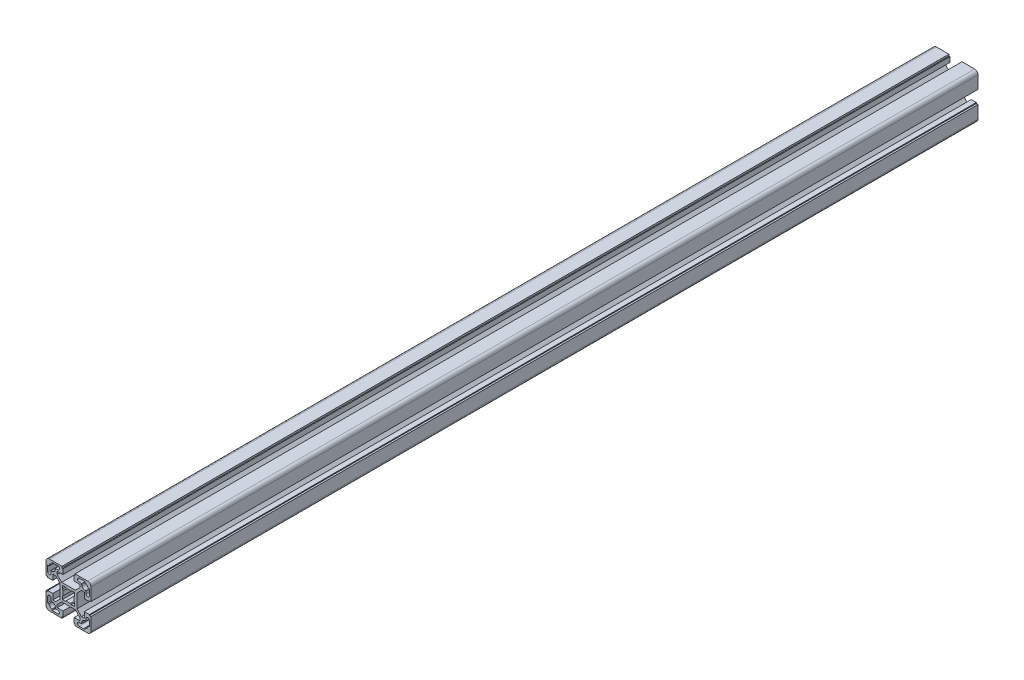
ISO-10303-21;
HEADER;
FILE_DESCRIPTION(('STEP AP214'),'2;1');
FILE_NAME('part.step','',(''),(''),'','','');
FILE_SCHEMA(('AUTOMOTIVE_DESIGN { 1 0 10303 214 1 1 1 1 }'));
ENDSEC;
DATA;
#1=APPLICATION_CONTEXT('core data for automotive mechanical design processes');
#2=APPLICATION_PROTOCOL_DEFINITION('international standard','automotive_design',2000,#1);
#3=PRODUCT_CONTEXT('',#1,'mechanical');
#4=PRODUCT('Part','Part','',(#3));
#5=PRODUCT_RELATED_PRODUCT_CATEGORY('part','',(#4));
#6=PRODUCT_DEFINITION_FORMATION('','',#4);
#7=PRODUCT_DEFINITION_CONTEXT('part definition',#1,'design');
#8=PRODUCT_DEFINITION('design','',#6,#7);
#9=PRODUCT_DEFINITION_SHAPE('','',#8);
#10=(LENGTH_UNIT() NAMED_UNIT(*) SI_UNIT(.MILLI.,.METRE.));
#11=(NAMED_UNIT(*) PLANE_ANGLE_UNIT() SI_UNIT($,.RADIAN.));
#12=(NAMED_UNIT(*) SI_UNIT($,.STERADIAN.) SOLID_ANGLE_UNIT());
#13=UNCERTAINTY_MEASURE_WITH_UNIT(LENGTH_MEASURE(1.E-05),#10,'distance_accuracy_value','');
#14=(GEOMETRIC_REPRESENTATION_CONTEXT(3) GLOBAL_UNCERTAINTY_ASSIGNED_CONTEXT((#13)) GLOBAL_UNIT_ASSIGNED_CONTEXT((#10,
#11,#12)) REPRESENTATION_CONTEXT('',''));
#15=CARTESIAN_POINT('',(0.,0.,0.));
#16=DIRECTION('',(0.,0.,1.));
#17=DIRECTION('',(1.,0.,0.));
#18=AXIS2_PLACEMENT_3D('',#15,#16,#17);
#19=CARTESIAN_POINT('',(-14.5000000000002,-11.75,788.));
#20=DIRECTION('',(0.,-1.,0.));
#21=DIRECTION('',(1.,0.,0.));
#22=AXIS2_PLACEMENT_3D('',#19,#20,#21);
#23=PLANE('',#22);
#24=DIRECTION('',(1.,0.,0.));
#25=VECTOR('',#24,1.);
#26=CARTESIAN_POINT('',(-14.5000000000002,-11.75,788.));
#27=LINE('',#26,#25);
#28=CARTESIAN_POINT('',(-14.5000000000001,-11.75,788.));
#29=VERTEX_POINT('',#28);
#30=CARTESIAN_POINT('',(-15.5000000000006,-11.75,788.));
#31=VERTEX_POINT('',#30);
#32=EDGE_CURVE('E806',#29,#31,#27,.F.);
#33=ORIENTED_EDGE('',*,*,#32,.T.);
#34=DIRECTION('',(0.,0.,1.));
#35=VECTOR('',#34,1.);
#36=CARTESIAN_POINT('',(-15.5000000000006,-11.75,788.));
#37=LINE('',#36,#35);
#38=CARTESIAN_POINT('',(-15.5000000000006,-11.75,0.));
#39=VERTEX_POINT('',#38);
#40=EDGE_CURVE('E804',#39,#31,#37,.T.);
#41=ORIENTED_EDGE('',*,*,#40,.F.);
#42=DIRECTION('',(1.,0.,0.));
#43=VECTOR('',#42,1.);
#44=CARTESIAN_POINT('',(-14.5000000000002,-11.75,0.));
#45=LINE('',#44,#43);
#46=CARTESIAN_POINT('',(-14.5000000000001,-11.75,0.));
#47=VERTEX_POINT('',#46);
#48=EDGE_CURVE('E20',#39,#47,#45,.T.);
#49=ORIENTED_EDGE('',*,*,#48,.T.);
#50=DIRECTION('',(0.,0.,-1.));
#51=VECTOR('',#50,1.);
#52=CARTESIAN_POINT('',(-14.5000000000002,-11.75,788.));
#53=LINE('',#52,#51);
#54=EDGE_CURVE('E801',#47,#29,#53,.F.);
#55=ORIENTED_EDGE('',*,*,#54,.T.);
#56=EDGE_LOOP('',(#33,#41,#49,#55));
#57=FACE_BOUND('',#56,.T.);
#58=ADVANCED_FACE('F17',(#57),#23,.T.);
#59=CARTESIAN_POINT('',(-11.7500000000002,-15.5,788.));
#60=DIRECTION('',(-1.,0.,0.));
#61=DIRECTION('',(0.,-1.,0.));
#62=AXIS2_PLACEMENT_3D('',#59,#60,#61);
#63=PLANE('',#62);
#64=DIRECTION('',(0.,-1.,0.));
#65=VECTOR('',#64,1.);
#66=CARTESIAN_POINT('',(-11.7500000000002,-15.5,788.));
#67=LINE('',#66,#65);
#68=CARTESIAN_POINT('',(-11.7500000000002,-15.5,788.));
#69=VERTEX_POINT('',#68);
#70=CARTESIAN_POINT('',(-11.7500000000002,-14.5,788.));
#71=VERTEX_POINT('',#70);
#72=EDGE_CURVE('E1218',#69,#71,#67,.F.);
#73=ORIENTED_EDGE('',*,*,#72,.T.);
#74=DIRECTION('',(0.,0.,-1.));
#75=VECTOR('',#74,1.);
#76=CARTESIAN_POINT('',(-11.7500000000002,-14.5,788.));
#77=LINE('',#76,#75);
#78=CARTESIAN_POINT('',(-11.7500000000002,-14.5,0.));
#79=VERTEX_POINT('',#78);
#80=EDGE_CURVE('E814',#71,#79,#77,.T.);
#81=ORIENTED_EDGE('',*,*,#80,.T.);
#82=DIRECTION('',(0.,-1.,0.));
#83=VECTOR('',#82,1.);
#84=CARTESIAN_POINT('',(-11.7500000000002,-15.5,0.));
#85=LINE('',#84,#83);
#86=CARTESIAN_POINT('',(-11.7500000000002,-15.5,0.));
#87=VERTEX_POINT('',#86);
#88=EDGE_CURVE('E819',#79,#87,#85,.T.);
#89=ORIENTED_EDGE('',*,*,#88,.T.);
#90=DIRECTION('',(0.,0.,-1.));
#91=VECTOR('',#90,1.);
#92=CARTESIAN_POINT('',(-11.7500000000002,-15.5,788.));
#93=LINE('',#92,#91);
#94=EDGE_CURVE('E1262',#69,#87,#93,.T.);
#95=ORIENTED_EDGE('',*,*,#94,.F.);
#96=EDGE_LOOP('',(#73,#81,#89,#95));
#97=FACE_BOUND('',#96,.T.);
#98=ADVANCED_FACE('F1555',(#97),#63,.T.);
#99=CARTESIAN_POINT('',(-14.5000000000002,-17.25,788.));
#100=DIRECTION('',(1.,0.,0.));
#101=DIRECTION('',(0.,0.,-1.));
#102=AXIS2_PLACEMENT_3D('',#99,#100,#101);
#103=PLANE('',#102);
#104=DIRECTION('',(0.,1.,0.));
#105=VECTOR('',#104,1.);
#106=CARTESIAN_POINT('',(-14.5000000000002,-17.25,788.));
#107=LINE('',#106,#105);
#108=CARTESIAN_POINT('',(-14.5000000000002,-17.25,788.));
#109=VERTEX_POINT('',#108);
#110=CARTESIAN_POINT('',(-14.5000000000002,-18.5,788.));
#111=VERTEX_POINT('',#110);
#112=EDGE_CURVE('E1214',#109,#111,#107,.F.);
#113=ORIENTED_EDGE('',*,*,#112,.T.);
#114=DIRECTION('',(0.,0.,1.));
#115=VECTOR('',#114,1.);
#116=CARTESIAN_POINT('',(-14.5000000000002,-18.5,788.));
#117=LINE('',#116,#115);
#118=CARTESIAN_POINT('',(-14.5000000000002,-18.5,0.));
#119=VERTEX_POINT('',#118);
#120=EDGE_CURVE('E1256',#119,#111,#117,.T.);
#121=ORIENTED_EDGE('',*,*,#120,.F.);
#122=DIRECTION('',(0.,1.,0.));
#123=VECTOR('',#122,1.);
#124=CARTESIAN_POINT('',(-14.5000000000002,-17.25,0.));
#125=LINE('',#124,#123);
#126=CARTESIAN_POINT('',(-14.5000000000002,-17.25,0.));
#127=VERTEX_POINT('',#126);
#128=EDGE_CURVE('E1216',#119,#127,#125,.T.);
#129=ORIENTED_EDGE('',*,*,#128,.T.);
#130=DIRECTION('',(0.,0.,-1.));
#131=VECTOR('',#130,1.);
#132=CARTESIAN_POINT('',(-14.5000000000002,-17.25,788.));
#133=LINE('',#132,#131);
#134=EDGE_CURVE('E1251',#127,#109,#133,.F.);
#135=ORIENTED_EDGE('',*,*,#134,.T.);
#136=EDGE_LOOP('',(#113,#121,#129,#135));
#137=FACE_BOUND('',#136,.T.);
#138=ADVANCED_FACE('F1560',(#137),#103,.T.);
#139=CARTESIAN_POINT('',(-18.5000000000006,-14.5000000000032,788.));
#140=DIRECTION('',(0.,1.,0.));
#141=DIRECTION('',(0.,0.,1.));
#142=AXIS2_PLACEMENT_3D('',#139,#140,#141);
#143=PLANE('',#142);
#144=DIRECTION('',(1.,0.,0.));
#145=VECTOR('',#144,1.);
#146=CARTESIAN_POINT('',(-18.5000000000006,-14.5000000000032,788.));
#147=LINE('',#146,#145);
#148=CARTESIAN_POINT('',(-18.5000000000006,-14.5000000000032,788.));
#149=VERTEX_POINT('',#148);
#150=CARTESIAN_POINT('',(-17.2500000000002,-14.5000000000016,788.));
#151=VERTEX_POINT('',#150);
#152=EDGE_CURVE('E1210',#149,#151,#147,.T.);
#153=ORIENTED_EDGE('',*,*,#152,.T.);
#154=DIRECTION('',(0.,0.,-1.));
#155=VECTOR('',#154,1.);
#156=CARTESIAN_POINT('',(-17.2500000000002,-14.5,788.));
#157=LINE('',#156,#155);
#158=CARTESIAN_POINT('',(-17.2500000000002,-14.5000000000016,0.));
#159=VERTEX_POINT('',#158);
#160=EDGE_CURVE('E1248',#151,#159,#157,.T.);
#161=ORIENTED_EDGE('',*,*,#160,.T.);
#162=DIRECTION('',(1.,0.,0.));
#163=VECTOR('',#162,1.);
#164=CARTESIAN_POINT('',(-18.5000000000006,-14.5000000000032,0.));
#165=LINE('',#164,#163);
#166=CARTESIAN_POINT('',(-18.5000000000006,-14.5000000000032,0.));
#167=VERTEX_POINT('',#166);
#168=EDGE_CURVE('E1212',#159,#167,#165,.F.);
#169=ORIENTED_EDGE('',*,*,#168,.T.);
#170=DIRECTION('',(0.,0.,-1.));
#171=VECTOR('',#170,1.);
#172=CARTESIAN_POINT('',(-18.5000000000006,-14.5000000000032,788.));
#173=LINE('',#172,#171);
#174=EDGE_CURVE('E1242',#149,#167,#173,.T.);
#175=ORIENTED_EDGE('',*,*,#174,.F.);
#176=EDGE_LOOP('',(#153,#161,#169,#175));
#177=FACE_BOUND('',#176,.T.);
#178=ADVANCED_FACE('F1569',(#177),#143,.T.);
#179=CARTESIAN_POINT('',(18.5000000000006,-14.5000000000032,788.));
#180=DIRECTION('',(0.,1.,0.));
#181=DIRECTION('',(0.,0.,1.));
#182=AXIS2_PLACEMENT_3D('',#179,#180,#181);
#183=PLANE('',#182);
#184=DIRECTION('',(1.,0.,0.));
#185=VECTOR('',#184,1.);
#186=CARTESIAN_POINT('',(18.5000000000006,-14.5000000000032,788.));
#187=LINE('',#186,#185);
#188=CARTESIAN_POINT('',(17.2500000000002,-14.5000000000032,788.));
#189=VERTEX_POINT('',#188);
#190=CARTESIAN_POINT('',(18.5000000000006,-14.5000000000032,788.));
#191=VERTEX_POINT('',#190);
#192=EDGE_CURVE('E1206',#189,#191,#187,.T.);
#193=ORIENTED_EDGE('',*,*,#192,.T.);
#194=DIRECTION('',(0.,0.,1.));
#195=VECTOR('',#194,1.);
#196=CARTESIAN_POINT('',(18.5000000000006,-14.5000000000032,788.));
#197=LINE('',#196,#195);
#198=CARTESIAN_POINT('',(18.5000000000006,-14.5000000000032,0.));
#199=VERTEX_POINT('',#198);
#200=EDGE_CURVE('E1947',#199,#191,#197,.T.);
#201=ORIENTED_EDGE('',*,*,#200,.F.);
#202=DIRECTION('',(1.,0.,0.));
#203=VECTOR('',#202,1.);
#204=CARTESIAN_POINT('',(18.5000000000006,-14.5000000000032,0.));
#205=LINE('',#204,#203);
#206=CARTESIAN_POINT('',(17.2500000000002,-14.5000000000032,0.));
#207=VERTEX_POINT('',#206);
#208=EDGE_CURVE('E1208',#199,#207,#205,.F.);
#209=ORIENTED_EDGE('',*,*,#208,.T.);
#210=DIRECTION('',(0.,0.,-1.));
#211=VECTOR('',#210,1.);
#212=CARTESIAN_POINT('',(17.2500000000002,-14.5000000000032,788.));
#213=LINE('',#212,#211);
#214=EDGE_CURVE('E1952',#207,#189,#213,.F.);
#215=ORIENTED_EDGE('',*,*,#214,.T.);
#216=EDGE_LOOP('',(#193,#201,#209,#215));
#217=FACE_BOUND('',#216,.T.);
#218=ADVANCED_FACE('F2472',(#217),#183,.T.);
#219=CARTESIAN_POINT('',(14.5000000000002,-17.25,788.));
#220=DIRECTION('',(-1.,0.,0.));
#221=DIRECTION('',(0.,0.,1.));
#222=AXIS2_PLACEMENT_3D('',#219,#220,#221);
#223=PLANE('',#222);
#224=DIRECTION('',(0.,1.,0.));
#225=VECTOR('',#224,1.);
#226=CARTESIAN_POINT('',(14.5000000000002,-17.25,788.));
#227=LINE('',#226,#225);
#228=CARTESIAN_POINT('',(14.5000000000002,-18.5,788.));
#229=VERTEX_POINT('',#228);
#230=CARTESIAN_POINT('',(14.5000000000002,-17.25,788.));
#231=VERTEX_POINT('',#230);
#232=EDGE_CURVE('E1202',#229,#231,#227,.T.);
#233=ORIENTED_EDGE('',*,*,#232,.T.);
#234=DIRECTION('',(0.,0.,-1.));
#235=VECTOR('',#234,1.);
#236=CARTESIAN_POINT('',(14.5000000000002,-17.25,788.));
#237=LINE('',#236,#235);
#238=CARTESIAN_POINT('',(14.5000000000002,-17.25,0.));
#239=VERTEX_POINT('',#238);
#240=EDGE_CURVE('E1955',#231,#239,#237,.T.);
#241=ORIENTED_EDGE('',*,*,#240,.T.);
#242=DIRECTION('',(0.,1.,0.));
#243=VECTOR('',#242,1.);
#244=CARTESIAN_POINT('',(14.5000000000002,-17.25,0.));
#245=LINE('',#244,#243);
#246=CARTESIAN_POINT('',(14.5000000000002,-18.5,0.));
#247=VERTEX_POINT('',#246);
#248=EDGE_CURVE('E1204',#239,#247,#245,.F.);
#249=ORIENTED_EDGE('',*,*,#248,.T.);
#250=DIRECTION('',(0.,0.,1.));
#251=VECTOR('',#250,1.);
#252=CARTESIAN_POINT('',(14.5000000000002,-18.5,788.));
#253=LINE('',#252,#251);
#254=EDGE_CURVE('E1958',#229,#247,#253,.F.);
#255=ORIENTED_EDGE('',*,*,#254,.F.);
#256=EDGE_LOOP('',(#233,#241,#249,#255));
#257=FACE_BOUND('',#256,.T.);
#258=ADVANCED_FACE('F2468',(#257),#223,.T.);
#259=CARTESIAN_POINT('',(11.7500000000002,-15.5,788.));
#260=DIRECTION('',(1.,0.,0.));
#261=DIRECTION('',(0.,1.,0.));
#262=AXIS2_PLACEMENT_3D('',#259,#260,#261);
#263=PLANE('',#262);
#264=DIRECTION('',(0.,1.,0.));
#265=VECTOR('',#264,1.);
#266=CARTESIAN_POINT('',(11.7500000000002,-15.5,788.));
#267=LINE('',#266,#265);
#268=CARTESIAN_POINT('',(11.7500000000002,-14.5,788.));
#269=VERTEX_POINT('',#268);
#270=CARTESIAN_POINT('',(11.7500000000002,-15.5,788.));
#271=VERTEX_POINT('',#270);
#272=EDGE_CURVE('E1198',#269,#271,#267,.F.);
#273=ORIENTED_EDGE('',*,*,#272,.T.);
#274=DIRECTION('',(0.,0.,-1.));
#275=VECTOR('',#274,1.);
#276=CARTESIAN_POINT('',(11.7500000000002,-15.5,788.));
#277=LINE('',#276,#275);
#278=CARTESIAN_POINT('',(11.7500000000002,-15.5,0.));
#279=VERTEX_POINT('',#278);
#280=EDGE_CURVE('E1964',#279,#271,#277,.F.);
#281=ORIENTED_EDGE('',*,*,#280,.F.);
#282=DIRECTION('',(0.,1.,0.));
#283=VECTOR('',#282,1.);
#284=CARTESIAN_POINT('',(11.7500000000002,-15.5,0.));
#285=LINE('',#284,#283);
#286=CARTESIAN_POINT('',(11.7500000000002,-14.5,0.));
#287=VERTEX_POINT('',#286);
#288=EDGE_CURVE('E1200',#279,#287,#285,.T.);
#289=ORIENTED_EDGE('',*,*,#288,.T.);
#290=DIRECTION('',(0.,0.,-1.));
#291=VECTOR('',#290,1.);
#292=CARTESIAN_POINT('',(11.7500000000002,-14.5,788.));
#293=LINE('',#292,#291);
#294=EDGE_CURVE('E1969',#287,#269,#293,.F.);
#295=ORIENTED_EDGE('',*,*,#294,.T.);
#296=EDGE_LOOP('',(#273,#281,#289,#295));
#297=FACE_BOUND('',#296,.T.);
#298=ADVANCED_FACE('F2465',(#297),#263,.T.);
#299=CARTESIAN_POINT('',(14.5000000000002,-11.75,788.));
#300=DIRECTION('',(0.,-1.,0.));
#301=DIRECTION('',(1.,0.,0.));
#302=AXIS2_PLACEMENT_3D('',#299,#300,#301);
#303=PLANE('',#302);
#304=DIRECTION('',(1.,0.,0.));
#305=VECTOR('',#304,1.);
#306=CARTESIAN_POINT('',(14.5000000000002,-11.75,788.));
#307=LINE('',#306,#305);
#308=CARTESIAN_POINT('',(15.5000000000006,-11.75,788.));
#309=VERTEX_POINT('',#308);
#310=CARTESIAN_POINT('',(14.5000000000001,-11.75,788.));
#311=VERTEX_POINT('',#310);
#312=EDGE_CURVE('E1194',#309,#311,#307,.F.);
#313=ORIENTED_EDGE('',*,*,#312,.T.);
#314=DIRECTION('',(0.,0.,-1.));
#315=VECTOR('',#314,1.);
#316=CARTESIAN_POINT('',(14.5000000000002,-11.75,788.));
#317=LINE('',#316,#315);
#318=CARTESIAN_POINT('',(14.5000000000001,-11.75,0.));
#319=VERTEX_POINT('',#318);
#320=EDGE_CURVE('E1940',#311,#319,#317,.T.);
#321=ORIENTED_EDGE('',*,*,#320,.T.);
#322=DIRECTION('',(1.,0.,0.));
#323=VECTOR('',#322,1.);
#324=CARTESIAN_POINT('',(14.5000000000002,-11.75,0.));
#325=LINE('',#324,#323);
#326=CARTESIAN_POINT('',(15.5000000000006,-11.75,0.));
#327=VERTEX_POINT('',#326);
#328=EDGE_CURVE('E1196',#319,#327,#325,.T.);
#329=ORIENTED_EDGE('',*,*,#328,.T.);
#330=DIRECTION('',(0.,0.,-1.));
#331=VECTOR('',#330,1.);
#332=CARTESIAN_POINT('',(15.5000000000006,-11.75,788.));
#333=LINE('',#332,#331);
#334=EDGE_CURVE('E1237',#309,#327,#333,.T.);
#335=ORIENTED_EDGE('',*,*,#334,.F.);
#336=EDGE_LOOP('',(#313,#321,#329,#335));
#337=FACE_BOUND('',#336,.T.);
#338=ADVANCED_FACE('F1939',(#337),#303,.T.);
#339=CARTESIAN_POINT('',(5.80000000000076,-18.5000000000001,788.));
#340=DIRECTION('',(1.,0.,0.));
#341=DIRECTION('',(0.,0.,-1.));
#342=AXIS2_PLACEMENT_3D('',#339,#340,#341);
#343=PLANE('',#342);
#344=DIRECTION('',(0.,0.,1.));
#345=VECTOR('',#344,1.);
#346=CARTESIAN_POINT('',(5.80000000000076,-20.,788.));
#347=LINE('',#346,#345);
#348=CARTESIAN_POINT('',(5.80000000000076,-20.,0.));
#349=VERTEX_POINT('',#348);
#350=CARTESIAN_POINT('',(5.80000000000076,-20.,788.));
#351=VERTEX_POINT('',#350);
#352=EDGE_CURVE('E1973',#349,#351,#347,.T.);
#353=ORIENTED_EDGE('',*,*,#352,.T.);
#354=DIRECTION('',(0.,1.,0.));
#355=VECTOR('',#354,1.);
#356=CARTESIAN_POINT('',(5.80000000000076,-17.,788.));
#357=LINE('',#356,#355);
#358=CARTESIAN_POINT('',(5.80000000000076,-18.5000000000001,788.));
#359=VERTEX_POINT('',#358);
#360=EDGE_CURVE('E1192',#359,#351,#357,.F.);
#361=ORIENTED_EDGE('',*,*,#360,.F.);
#362=DIRECTION('',(0.,0.,1.));
#363=VECTOR('',#362,1.);
#364=CARTESIAN_POINT('',(5.80000000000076,-18.5000000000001,788.));
#365=LINE('',#364,#363);
#366=CARTESIAN_POINT('',(5.80000000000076,-18.5000000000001,0.));
#367=VERTEX_POINT('',#366);
#368=EDGE_CURVE('E1116',#359,#367,#365,.F.);
#369=ORIENTED_EDGE('',*,*,#368,.T.);
#370=DIRECTION('',(0.,1.,0.));
#371=VECTOR('',#370,1.);
#372=CARTESIAN_POINT('',(5.80000000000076,-17.,0.));
#373=LINE('',#372,#371);
#374=EDGE_CURVE('E1190',#349,#367,#373,.T.);
#375=ORIENTED_EDGE('',*,*,#374,.F.);
#376=EDGE_LOOP('',(#353,#361,#369,#375));
#377=FACE_BOUND('',#376,.T.);
#378=ADVANCED_FACE('F2286',(#377),#343,.F.);
#379=CARTESIAN_POINT('',(20.,-5.79999999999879,788.));
#380=DIRECTION('',(0.,-1.,0.));
#381=DIRECTION('',(0.,0.,-1.));
#382=AXIS2_PLACEMENT_3D('',#379,#380,#381);
#383=PLANE('',#382);
#384=DIRECTION('',(0.,0.,1.));
#385=VECTOR('',#384,1.);
#386=CARTESIAN_POINT('',(18.5,-5.79999999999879,788.));
#387=LINE('',#386,#385);
#388=CARTESIAN_POINT('',(18.5,-5.79999999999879,0.));
#389=VERTEX_POINT('',#388);
#390=CARTESIAN_POINT('',(18.5,-5.79999999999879,788.));
#391=VERTEX_POINT('',#390);
#392=EDGE_CURVE('E1185',#389,#391,#387,.T.);
#393=ORIENTED_EDGE('',*,*,#392,.T.);
#394=DIRECTION('',(1.,0.,0.));
#395=VECTOR('',#394,1.);
#396=CARTESIAN_POINT('',(17.,-5.79999999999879,788.));
#397=LINE('',#396,#395);
#398=CARTESIAN_POINT('',(20.,-5.79999999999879,788.));
#399=VERTEX_POINT('',#398);
#400=EDGE_CURVE('E1188',#399,#391,#397,.F.);
#401=ORIENTED_EDGE('',*,*,#400,.F.);
#402=DIRECTION('',(0.,0.,1.));
#403=VECTOR('',#402,1.);
#404=CARTESIAN_POINT('',(20.,-5.79999999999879,788.));
#405=LINE('',#404,#403);
#406=CARTESIAN_POINT('',(20.,-5.79999999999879,0.));
#407=VERTEX_POINT('',#406);
#408=EDGE_CURVE('E1981',#399,#407,#405,.F.);
#409=ORIENTED_EDGE('',*,*,#408,.T.);
#410=DIRECTION('',(1.,0.,0.));
#411=VECTOR('',#410,1.);
#412=CARTESIAN_POINT('',(17.,-5.79999999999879,0.));
#413=LINE('',#412,#411);
#414=EDGE_CURVE('E1186',#389,#407,#413,.T.);
#415=ORIENTED_EDGE('',*,*,#414,.F.);
#416=EDGE_LOOP('',(#393,#401,#409,#415));
#417=FACE_BOUND('',#416,.T.);
#418=ADVANCED_FACE('F2294',(#417),#383,.F.);
#419=CARTESIAN_POINT('',(18.5,-5.79999999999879,788.));
#420=DIRECTION('',(-1.,0.,0.));
#421=DIRECTION('',(0.,0.,1.));
#422=AXIS2_PLACEMENT_3D('',#419,#420,#421);
#423=PLANE('',#422);
#424=DIRECTION('',(0.,0.,-1.));
#425=VECTOR('',#424,1.);
#426=CARTESIAN_POINT('',(18.5,-4.99999999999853,788.));
#427=LINE('',#426,#425);
#428=CARTESIAN_POINT('',(18.5,-4.99999999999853,0.));
#429=VERTEX_POINT('',#428);
#430=CARTESIAN_POINT('',(18.5,-4.99999999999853,788.));
#431=VERTEX_POINT('',#430);
#432=EDGE_CURVE('E1984',#429,#431,#427,.F.);
#433=ORIENTED_EDGE('',*,*,#432,.T.);
#434=DIRECTION('',(0.,1.,0.));
#435=VECTOR('',#434,1.);
#436=CARTESIAN_POINT('',(18.5,-17.,788.));
#437=LINE('',#436,#435);
#438=EDGE_CURVE('E1183',#391,#431,#437,.T.);
#439=ORIENTED_EDGE('',*,*,#438,.F.);
#440=ORIENTED_EDGE('',*,*,#392,.F.);
#441=DIRECTION('',(0.,1.,0.));
#442=VECTOR('',#441,1.);
#443=CARTESIAN_POINT('',(18.5,-17.,0.));
#444=LINE('',#443,#442);
#445=EDGE_CURVE('E1180',#429,#389,#444,.F.);
#446=ORIENTED_EDGE('',*,*,#445,.F.);
#447=EDGE_LOOP('',(#433,#439,#440,#446));
#448=FACE_BOUND('',#447,.T.);
#449=ADVANCED_FACE('F2297',(#448),#423,.F.);
#450=CARTESIAN_POINT('',(18.5,5.79999999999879,788.));
#451=DIRECTION('',(-1.,0.,0.));
#452=DIRECTION('',(0.,0.,1.));
#453=AXIS2_PLACEMENT_3D('',#450,#451,#452);
#454=PLANE('',#453);
#455=DIRECTION('',(0.,0.,1.));
#456=VECTOR('',#455,1.);
#457=CARTESIAN_POINT('',(18.5,5.79999999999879,788.));
#458=LINE('',#457,#456);
#459=CARTESIAN_POINT('',(18.5,5.79999999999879,0.));
#460=VERTEX_POINT('',#459);
#461=CARTESIAN_POINT('',(18.5,5.79999999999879,788.));
#462=VERTEX_POINT('',#461);
#463=EDGE_CURVE('E1175',#460,#462,#458,.T.);
#464=ORIENTED_EDGE('',*,*,#463,.T.);
#465=DIRECTION('',(0.,1.,0.));
#466=VECTOR('',#465,1.);
#467=CARTESIAN_POINT('',(18.5,-17.,788.));
#468=LINE('',#467,#466);
#469=CARTESIAN_POINT('',(18.5,4.99999999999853,788.));
#470=VERTEX_POINT('',#469);
#471=EDGE_CURVE('E1178',#470,#462,#468,.T.);
#472=ORIENTED_EDGE('',*,*,#471,.F.);
#473=DIRECTION('',(0.,0.,1.));
#474=VECTOR('',#473,1.);
#475=CARTESIAN_POINT('',(18.5,4.99999999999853,788.));
#476=LINE('',#475,#474);
#477=CARTESIAN_POINT('',(18.5,4.99999999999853,0.));
#478=VERTEX_POINT('',#477);
#479=EDGE_CURVE('E2011',#470,#478,#476,.F.);
#480=ORIENTED_EDGE('',*,*,#479,.T.);
#481=DIRECTION('',(0.,1.,0.));
#482=VECTOR('',#481,1.);
#483=CARTESIAN_POINT('',(18.5,-17.,0.));
#484=LINE('',#483,#482);
#485=EDGE_CURVE('E1176',#460,#478,#484,.F.);
#486=ORIENTED_EDGE('',*,*,#485,.F.);
#487=EDGE_LOOP('',(#464,#472,#480,#486));
#488=FACE_BOUND('',#487,.T.);
#489=ADVANCED_FACE('F2319',(#488),#454,.F.);
#490=CARTESIAN_POINT('',(20.,5.79999999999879,788.));
#491=DIRECTION('',(0.,1.,0.));
#492=DIRECTION('',(0.,0.,1.));
#493=AXIS2_PLACEMENT_3D('',#490,#491,#492);
#494=PLANE('',#493);
#495=DIRECTION('',(0.,0.,1.));
#496=VECTOR('',#495,1.);
#497=CARTESIAN_POINT('',(20.,5.79999999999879,788.));
#498=LINE('',#497,#496);
#499=CARTESIAN_POINT('',(20.,5.79999999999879,0.));
#500=VERTEX_POINT('',#499);
#501=CARTESIAN_POINT('',(20.,5.79999999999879,788.));
#502=VERTEX_POINT('',#501);
#503=EDGE_CURVE('E2014',#500,#502,#498,.T.);
#504=ORIENTED_EDGE('',*,*,#503,.T.);
#505=DIRECTION('',(1.,0.,0.));
#506=VECTOR('',#505,1.);
#507=CARTESIAN_POINT('',(17.,5.79999999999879,788.));
#508=LINE('',#507,#506);
#509=EDGE_CURVE('E1173',#462,#502,#508,.T.);
#510=ORIENTED_EDGE('',*,*,#509,.F.);
#511=ORIENTED_EDGE('',*,*,#463,.F.);
#512=DIRECTION('',(1.,0.,0.));
#513=VECTOR('',#512,1.);
#514=CARTESIAN_POINT('',(17.,5.79999999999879,0.));
#515=LINE('',#514,#513);
#516=EDGE_CURVE('E1170',#500,#460,#515,.F.);
#517=ORIENTED_EDGE('',*,*,#516,.F.);
#518=EDGE_LOOP('',(#504,#510,#511,#517));
#519=FACE_BOUND('',#518,.T.);
#520=ADVANCED_FACE('F2323',(#519),#494,.F.);
#521=CARTESIAN_POINT('',(5.80000000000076,18.5000000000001,788.));
#522=DIRECTION('',(1.,0.,0.));
#523=DIRECTION('',(0.,0.,-1.));
#524=AXIS2_PLACEMENT_3D('',#521,#522,#523);
#525=PLANE('',#524);
#526=DIRECTION('',(0.,0.,-1.));
#527=VECTOR('',#526,1.);
#528=CARTESIAN_POINT('',(5.80000000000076,18.5000000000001,788.));
#529=LINE('',#528,#527);
#530=CARTESIAN_POINT('',(5.80000000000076,18.5000000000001,0.));
#531=VERTEX_POINT('',#530);
#532=CARTESIAN_POINT('',(5.80000000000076,18.5000000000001,788.));
#533=VERTEX_POINT('',#532);
#534=EDGE_CURVE('E1165',#531,#533,#529,.F.);
#535=ORIENTED_EDGE('',*,*,#534,.T.);
#536=DIRECTION('',(0.,1.,0.));
#537=VECTOR('',#536,1.);
#538=CARTESIAN_POINT('',(5.80000000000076,-17.,788.));
#539=LINE('',#538,#537);
#540=CARTESIAN_POINT('',(5.80000000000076,20.,788.));
#541=VERTEX_POINT('',#540);
#542=EDGE_CURVE('E1168',#541,#533,#539,.F.);
#543=ORIENTED_EDGE('',*,*,#542,.F.);
#544=DIRECTION('',(0.,0.,-1.));
#545=VECTOR('',#544,1.);
#546=CARTESIAN_POINT('',(5.80000000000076,20.,788.));
#547=LINE('',#546,#545);
#548=CARTESIAN_POINT('',(5.80000000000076,20.,0.));
#549=VERTEX_POINT('',#548);
#550=EDGE_CURVE('E2022',#541,#549,#547,.T.);
#551=ORIENTED_EDGE('',*,*,#550,.T.);
#552=DIRECTION('',(0.,1.,0.));
#553=VECTOR('',#552,1.);
#554=CARTESIAN_POINT('',(5.80000000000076,-17.,0.));
#555=LINE('',#554,#553);
#556=EDGE_CURVE('E1166',#531,#549,#555,.T.);
#557=ORIENTED_EDGE('',*,*,#556,.F.);
#558=EDGE_LOOP('',(#535,#543,#551,#557));
#559=FACE_BOUND('',#558,.T.);
#560=ADVANCED_FACE('F2334',(#559),#525,.F.);
#561=CARTESIAN_POINT('',(5.00000000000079,18.5000000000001,788.));
#562=DIRECTION('',(0.,-1.,0.));
#563=DIRECTION('',(0.,0.,-1.));
#564=AXIS2_PLACEMENT_3D('',#561,#562,#563);
#565=PLANE('',#564);
#566=DIRECTION('',(0.,0.,1.));
#567=VECTOR('',#566,1.);
#568=CARTESIAN_POINT('',(5.00000000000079,18.5000000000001,788.));
#569=LINE('',#568,#567);
#570=CARTESIAN_POINT('',(5.00000000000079,18.5000000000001,0.));
#571=VERTEX_POINT('',#570);
#572=CARTESIAN_POINT('',(5.00000000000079,18.5000000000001,788.));
#573=VERTEX_POINT('',#572);
#574=EDGE_CURVE('E2025',#571,#573,#569,.T.);
#575=ORIENTED_EDGE('',*,*,#574,.T.);
#576=DIRECTION('',(1.,0.,0.));
#577=VECTOR('',#576,1.);
#578=CARTESIAN_POINT('',(17.,18.5000000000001,788.));
#579=LINE('',#578,#577);
#580=EDGE_CURVE('E1163',#533,#573,#579,.F.);
#581=ORIENTED_EDGE('',*,*,#580,.F.);
#582=ORIENTED_EDGE('',*,*,#534,.F.);
#583=DIRECTION('',(1.,0.,0.));
#584=VECTOR('',#583,1.);
#585=CARTESIAN_POINT('',(17.,18.5000000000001,0.));
#586=LINE('',#585,#584);
#587=EDGE_CURVE('E1160',#571,#531,#586,.T.);
#588=ORIENTED_EDGE('',*,*,#587,.F.);
#589=EDGE_LOOP('',(#575,#581,#582,#588));
#590=FACE_BOUND('',#589,.T.);
#591=ADVANCED_FACE('F2338',(#590),#565,.F.);
#592=CARTESIAN_POINT('',(-5.00000000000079,18.5000000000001,788.));
#593=DIRECTION('',(0.,-1.,0.));
#594=DIRECTION('',(0.,0.,-1.));
#595=AXIS2_PLACEMENT_3D('',#592,#593,#594);
#596=PLANE('',#595);
#597=DIRECTION('',(0.,0.,1.));
#598=VECTOR('',#597,1.);
#599=CARTESIAN_POINT('',(-5.80000000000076,18.5000000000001,788.));
#600=LINE('',#599,#598);
#601=CARTESIAN_POINT('',(-5.80000000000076,18.5000000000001,0.));
#602=VERTEX_POINT('',#601);
#603=CARTESIAN_POINT('',(-5.80000000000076,18.5000000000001,788.));
#604=VERTEX_POINT('',#603);
#605=EDGE_CURVE('E1155',#602,#604,#600,.T.);
#606=ORIENTED_EDGE('',*,*,#605,.T.);
#607=DIRECTION('',(1.,0.,0.));
#608=VECTOR('',#607,1.);
#609=CARTESIAN_POINT('',(17.,18.5000000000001,788.));
#610=LINE('',#609,#608);
#611=CARTESIAN_POINT('',(-5.00000000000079,18.5000000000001,788.));
#612=VERTEX_POINT('',#611);
#613=EDGE_CURVE('E1158',#612,#604,#610,.F.);
#614=ORIENTED_EDGE('',*,*,#613,.F.);
#615=DIRECTION('',(0.,0.,1.));
#616=VECTOR('',#615,1.);
#617=CARTESIAN_POINT('',(-5.00000000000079,18.5000000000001,788.));
#618=LINE('',#617,#616);
#619=CARTESIAN_POINT('',(-5.00000000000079,18.5000000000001,0.));
#620=VERTEX_POINT('',#619);
#621=EDGE_CURVE('E2052',#612,#620,#618,.F.);
#622=ORIENTED_EDGE('',*,*,#621,.T.);
#623=DIRECTION('',(1.,0.,0.));
#624=VECTOR('',#623,1.);
#625=CARTESIAN_POINT('',(17.,18.5000000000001,0.));
#626=LINE('',#625,#624);
#627=EDGE_CURVE('E1156',#602,#620,#626,.T.);
#628=ORIENTED_EDGE('',*,*,#627,.F.);
#629=EDGE_LOOP('',(#606,#614,#622,#628));
#630=FACE_BOUND('',#629,.T.);
#631=ADVANCED_FACE('F2360',(#630),#596,.F.);
#632=CARTESIAN_POINT('',(-5.80000000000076,18.5000000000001,788.));
#633=DIRECTION('',(-1.,0.,0.));
#634=DIRECTION('',(0.,0.,1.));
#635=AXIS2_PLACEMENT_3D('',#632,#633,#634);
#636=PLANE('',#635);
#637=DIRECTION('',(0.,0.,1.));
#638=VECTOR('',#637,1.);
#639=CARTESIAN_POINT('',(-5.80000000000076,20.,788.));
#640=LINE('',#639,#638);
#641=CARTESIAN_POINT('',(-5.80000000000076,20.,0.));
#642=VERTEX_POINT('',#641);
#643=CARTESIAN_POINT('',(-5.80000000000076,20.,788.));
#644=VERTEX_POINT('',#643);
#645=EDGE_CURVE('E2055',#642,#644,#640,.T.);
#646=ORIENTED_EDGE('',*,*,#645,.T.);
#647=DIRECTION('',(0.,1.,0.));
#648=VECTOR('',#647,1.);
#649=CARTESIAN_POINT('',(-5.80000000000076,-17.,788.));
#650=LINE('',#649,#648);
#651=EDGE_CURVE('E1153',#604,#644,#650,.T.);
#652=ORIENTED_EDGE('',*,*,#651,.F.);
#653=ORIENTED_EDGE('',*,*,#605,.F.);
#654=DIRECTION('',(0.,1.,0.));
#655=VECTOR('',#654,1.);
#656=CARTESIAN_POINT('',(-5.80000000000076,-17.,0.));
#657=LINE('',#656,#655);
#658=EDGE_CURVE('E1150',#642,#602,#657,.F.);
#659=ORIENTED_EDGE('',*,*,#658,.F.);
#660=EDGE_LOOP('',(#646,#652,#653,#659));
#661=FACE_BOUND('',#660,.T.);
#662=ADVANCED_FACE('F2364',(#661),#636,.F.);
#663=CARTESIAN_POINT('',(-20.,5.79999999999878,788.));
#664=DIRECTION('',(0.,1.,0.));
#665=DIRECTION('',(0.,0.,1.));
#666=AXIS2_PLACEMENT_3D('',#663,#664,#665);
#667=PLANE('',#666);
#668=DIRECTION('',(0.,0.,-1.));
#669=VECTOR('',#668,1.);
#670=CARTESIAN_POINT('',(-18.5,5.79999999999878,788.));
#671=LINE('',#670,#669);
#672=CARTESIAN_POINT('',(-18.5,5.79999999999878,0.));
#673=VERTEX_POINT('',#672);
#674=CARTESIAN_POINT('',(-18.5,5.79999999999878,788.));
#675=VERTEX_POINT('',#674);
#676=EDGE_CURVE('E1145',#673,#675,#671,.F.);
#677=ORIENTED_EDGE('',*,*,#676,.T.);
#678=DIRECTION('',(1.,0.,0.));
#679=VECTOR('',#678,1.);
#680=CARTESIAN_POINT('',(17.,5.79999999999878,788.));
#681=LINE('',#680,#679);
#682=CARTESIAN_POINT('',(-20.,5.79999999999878,788.));
#683=VERTEX_POINT('',#682);
#684=EDGE_CURVE('E1148',#683,#675,#681,.T.);
#685=ORIENTED_EDGE('',*,*,#684,.F.);
#686=DIRECTION('',(0.,0.,1.));
#687=VECTOR('',#686,1.);
#688=CARTESIAN_POINT('',(-20.,5.79999999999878,788.));
#689=LINE('',#688,#687);
#690=CARTESIAN_POINT('',(-20.,5.79999999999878,0.));
#691=VERTEX_POINT('',#690);
#692=EDGE_CURVE('E2063',#683,#691,#689,.F.);
#693=ORIENTED_EDGE('',*,*,#692,.T.);
#694=DIRECTION('',(1.,0.,0.));
#695=VECTOR('',#694,1.);
#696=CARTESIAN_POINT('',(17.,5.79999999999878,0.));
#697=LINE('',#696,#695);
#698=EDGE_CURVE('E1146',#673,#691,#697,.F.);
#699=ORIENTED_EDGE('',*,*,#698,.F.);
#700=EDGE_LOOP('',(#677,#685,#693,#699));
#701=FACE_BOUND('',#700,.T.);
#702=ADVANCED_FACE('F2375',(#701),#667,.F.);
#703=CARTESIAN_POINT('',(-18.5,5.79999999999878,788.));
#704=DIRECTION('',(1.,0.,0.));
#705=DIRECTION('',(0.,0.,-1.));
#706=AXIS2_PLACEMENT_3D('',#703,#704,#705);
#707=PLANE('',#706);
#708=DIRECTION('',(0.,0.,1.));
#709=VECTOR('',#708,1.);
#710=CARTESIAN_POINT('',(-18.5,4.99999999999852,788.));
#711=LINE('',#710,#709);
#712=CARTESIAN_POINT('',(-18.5,4.99999999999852,0.));
#713=VERTEX_POINT('',#712);
#714=CARTESIAN_POINT('',(-18.5,4.99999999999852,788.));
#715=VERTEX_POINT('',#714);
#716=EDGE_CURVE('E2066',#713,#715,#711,.T.);
#717=ORIENTED_EDGE('',*,*,#716,.T.);
#718=DIRECTION('',(0.,1.,0.));
#719=VECTOR('',#718,1.);
#720=CARTESIAN_POINT('',(-18.5,-17.,788.));
#721=LINE('',#720,#719);
#722=EDGE_CURVE('E1143',#675,#715,#721,.F.);
#723=ORIENTED_EDGE('',*,*,#722,.F.);
#724=ORIENTED_EDGE('',*,*,#676,.F.);
#725=DIRECTION('',(0.,1.,0.));
#726=VECTOR('',#725,1.);
#727=CARTESIAN_POINT('',(-18.5,-17.,0.));
#728=LINE('',#727,#726);
#729=EDGE_CURVE('E1140',#713,#673,#728,.T.);
#730=ORIENTED_EDGE('',*,*,#729,.F.);
#731=EDGE_LOOP('',(#717,#723,#724,#730));
#732=FACE_BOUND('',#731,.T.);
#733=ADVANCED_FACE('F2379',(#732),#707,.F.);
#734=CARTESIAN_POINT('',(-18.5,-5.79999999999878,788.));
#735=DIRECTION('',(1.,0.,0.));
#736=DIRECTION('',(0.,0.,-1.));
#737=AXIS2_PLACEMENT_3D('',#734,#735,#736);
#738=PLANE('',#737);
#739=DIRECTION('',(0.,0.,-1.));
#740=VECTOR('',#739,1.);
#741=CARTESIAN_POINT('',(-18.5,-5.79999999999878,788.));
#742=LINE('',#741,#740);
#743=CARTESIAN_POINT('',(-18.5,-5.79999999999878,0.));
#744=VERTEX_POINT('',#743);
#745=CARTESIAN_POINT('',(-18.5,-5.79999999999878,788.));
#746=VERTEX_POINT('',#745);
#747=EDGE_CURVE('E1135',#744,#746,#742,.F.);
#748=ORIENTED_EDGE('',*,*,#747,.T.);
#749=DIRECTION('',(0.,1.,0.));
#750=VECTOR('',#749,1.);
#751=CARTESIAN_POINT('',(-18.5,-17.,788.));
#752=LINE('',#751,#750);
#753=CARTESIAN_POINT('',(-18.5,-4.99999999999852,788.));
#754=VERTEX_POINT('',#753);
#755=EDGE_CURVE('E1138',#754,#746,#752,.F.);
#756=ORIENTED_EDGE('',*,*,#755,.F.);
#757=DIRECTION('',(0.,0.,1.));
#758=VECTOR('',#757,1.);
#759=CARTESIAN_POINT('',(-18.5,-4.99999999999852,788.));
#760=LINE('',#759,#758);
#761=CARTESIAN_POINT('',(-18.5,-4.99999999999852,0.));
#762=VERTEX_POINT('',#761);
#763=EDGE_CURVE('E2093',#754,#762,#760,.F.);
#764=ORIENTED_EDGE('',*,*,#763,.T.);
#765=DIRECTION('',(0.,1.,0.));
#766=VECTOR('',#765,1.);
#767=CARTESIAN_POINT('',(-18.5,-17.,0.));
#768=LINE('',#767,#766);
#769=EDGE_CURVE('E1136',#744,#762,#768,.T.);
#770=ORIENTED_EDGE('',*,*,#769,.F.);
#771=EDGE_LOOP('',(#748,#756,#764,#770));
#772=FACE_BOUND('',#771,.T.);
#773=ADVANCED_FACE('F2401',(#772),#738,.F.);
#774=CARTESIAN_POINT('',(-20.,-5.79999999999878,788.));
#775=DIRECTION('',(0.,-1.,0.));
#776=DIRECTION('',(0.,0.,-1.));
#777=AXIS2_PLACEMENT_3D('',#774,#775,#776);
#778=PLANE('',#777);
#779=DIRECTION('',(0.,0.,1.));
#780=VECTOR('',#779,1.);
#781=CARTESIAN_POINT('',(-20.,-5.79999999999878,788.));
#782=LINE('',#781,#780);
#783=CARTESIAN_POINT('',(-20.,-5.79999999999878,0.));
#784=VERTEX_POINT('',#783);
#785=CARTESIAN_POINT('',(-20.,-5.79999999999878,788.));
#786=VERTEX_POINT('',#785);
#787=EDGE_CURVE('E2096',#784,#786,#782,.T.);
#788=ORIENTED_EDGE('',*,*,#787,.T.);
#789=DIRECTION('',(1.,0.,0.));
#790=VECTOR('',#789,1.);
#791=CARTESIAN_POINT('',(17.,-5.79999999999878,788.));
#792=LINE('',#791,#790);
#793=EDGE_CURVE('E1133',#746,#786,#792,.F.);
#794=ORIENTED_EDGE('',*,*,#793,.F.);
#795=ORIENTED_EDGE('',*,*,#747,.F.);
#796=DIRECTION('',(1.,0.,0.));
#797=VECTOR('',#796,1.);
#798=CARTESIAN_POINT('',(17.,-5.79999999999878,0.));
#799=LINE('',#798,#797);
#800=EDGE_CURVE('E1130',#784,#744,#799,.T.);
#801=ORIENTED_EDGE('',*,*,#800,.F.);
#802=EDGE_LOOP('',(#788,#794,#795,#801));
#803=FACE_BOUND('',#802,.T.);
#804=ADVANCED_FACE('F2405',(#803),#778,.F.);
#805=CARTESIAN_POINT('',(-5.80000000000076,-18.5000000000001,788.));
#806=DIRECTION('',(-1.,0.,0.));
#807=DIRECTION('',(0.,0.,1.));
#808=AXIS2_PLACEMENT_3D('',#805,#806,#807);
#809=PLANE('',#808);
#810=DIRECTION('',(0.,0.,1.));
#811=VECTOR('',#810,1.);
#812=CARTESIAN_POINT('',(-5.80000000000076,-18.5000000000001,788.));
#813=LINE('',#812,#811);
#814=CARTESIAN_POINT('',(-5.80000000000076,-18.5000000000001,0.));
#815=VERTEX_POINT('',#814);
#816=CARTESIAN_POINT('',(-5.80000000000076,-18.5000000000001,788.));
#817=VERTEX_POINT('',#816);
#818=EDGE_CURVE('E1125',#815,#817,#813,.T.);
#819=ORIENTED_EDGE('',*,*,#818,.T.);
#820=DIRECTION('',(0.,1.,0.));
#821=VECTOR('',#820,1.);
#822=CARTESIAN_POINT('',(-5.80000000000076,-17.,788.));
#823=LINE('',#822,#821);
#824=CARTESIAN_POINT('',(-5.80000000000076,-20.,788.));
#825=VERTEX_POINT('',#824);
#826=EDGE_CURVE('E1128',#825,#817,#823,.T.);
#827=ORIENTED_EDGE('',*,*,#826,.F.);
#828=DIRECTION('',(0.,0.,1.));
#829=VECTOR('',#828,1.);
#830=CARTESIAN_POINT('',(-5.80000000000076,-20.,788.));
#831=LINE('',#830,#829);
#832=CARTESIAN_POINT('',(-5.80000000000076,-20.,0.));
#833=VERTEX_POINT('',#832);
#834=EDGE_CURVE('E2104',#825,#833,#831,.F.);
#835=ORIENTED_EDGE('',*,*,#834,.T.);
#836=DIRECTION('',(0.,1.,0.));
#837=VECTOR('',#836,1.);
#838=CARTESIAN_POINT('',(-5.80000000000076,-17.,0.));
#839=LINE('',#838,#837);
#840=EDGE_CURVE('E1126',#815,#833,#839,.F.);
#841=ORIENTED_EDGE('',*,*,#840,.F.);
#842=EDGE_LOOP('',(#819,#827,#835,#841));
#843=FACE_BOUND('',#842,.T.);
#844=ADVANCED_FACE('F2416',(#843),#809,.F.);
#845=CARTESIAN_POINT('',(-5.00000000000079,-18.5000000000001,788.));
#846=DIRECTION('',(0.,1.,0.));
#847=DIRECTION('',(0.,0.,1.));
#848=AXIS2_PLACEMENT_3D('',#845,#846,#847);
#849=PLANE('',#848);
#850=DIRECTION('',(0.,0.,1.));
#851=VECTOR('',#850,1.);
#852=CARTESIAN_POINT('',(-5.00000000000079,-18.5000000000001,788.));
#853=LINE('',#852,#851);
#854=CARTESIAN_POINT('',(-5.00000000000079,-18.5000000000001,0.));
#855=VERTEX_POINT('',#854);
#856=CARTESIAN_POINT('',(-5.00000000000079,-18.5000000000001,788.));
#857=VERTEX_POINT('',#856);
#858=EDGE_CURVE('E2107',#855,#857,#853,.T.);
#859=ORIENTED_EDGE('',*,*,#858,.T.);
#860=DIRECTION('',(1.,0.,0.));
#861=VECTOR('',#860,1.);
#862=CARTESIAN_POINT('',(17.,-18.5000000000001,788.));
#863=LINE('',#862,#861);
#864=EDGE_CURVE('E1123',#817,#857,#863,.T.);
#865=ORIENTED_EDGE('',*,*,#864,.F.);
#866=ORIENTED_EDGE('',*,*,#818,.F.);
#867=DIRECTION('',(1.,0.,0.));
#868=VECTOR('',#867,1.);
#869=CARTESIAN_POINT('',(17.,-18.5000000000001,0.));
#870=LINE('',#869,#868);
#871=EDGE_CURVE('E1120',#855,#815,#870,.F.);
#872=ORIENTED_EDGE('',*,*,#871,.F.);
#873=EDGE_LOOP('',(#859,#865,#866,#872));
#874=FACE_BOUND('',#873,.T.);
#875=ADVANCED_FACE('F2420',(#874),#849,.F.);
#876=CARTESIAN_POINT('',(5.00000000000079,-18.5000000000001,788.));
#877=DIRECTION('',(0.,1.,0.));
#878=DIRECTION('',(0.,0.,1.));
#879=AXIS2_PLACEMENT_3D('',#876,#877,#878);
#880=PLANE('',#879);
#881=ORIENTED_EDGE('',*,*,#368,.F.);
#882=DIRECTION('',(1.,0.,0.));
#883=VECTOR('',#882,1.);
#884=CARTESIAN_POINT('',(17.,-18.5000000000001,788.));
#885=LINE('',#884,#883);
#886=CARTESIAN_POINT('',(5.00000000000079,-18.5000000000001,788.));
#887=VERTEX_POINT('',#886);
#888=EDGE_CURVE('E1117',#887,#359,#885,.T.);
#889=ORIENTED_EDGE('',*,*,#888,.F.);
#890=DIRECTION('',(0.,0.,1.));
#891=VECTOR('',#890,1.);
#892=CARTESIAN_POINT('',(5.00000000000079,-18.5000000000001,788.));
#893=LINE('',#892,#891);
#894=CARTESIAN_POINT('',(5.00000000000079,-18.5000000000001,0.));
#895=VERTEX_POINT('',#894);
#896=EDGE_CURVE('E2126',#887,#895,#893,.F.);
#897=ORIENTED_EDGE('',*,*,#896,.T.);
#898=DIRECTION('',(1.,0.,0.));
#899=VECTOR('',#898,1.);
#900=CARTESIAN_POINT('',(17.,-18.5000000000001,0.));
#901=LINE('',#900,#899);
#902=EDGE_CURVE('E1114',#367,#895,#901,.F.);
#903=ORIENTED_EDGE('',*,*,#902,.F.);
#904=EDGE_LOOP('',(#881,#889,#897,#903));
#905=FACE_BOUND('',#904,.T.);
#906=ADVANCED_FACE('F2277',(#905),#880,.F.);
#907=CARTESIAN_POINT('',(14.5000000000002,11.75,788.));
#908=DIRECTION('',(0.,1.,0.));
#909=DIRECTION('',(-1.,0.,0.));
#910=AXIS2_PLACEMENT_3D('',#907,#908,#909);
#911=PLANE('',#910);
#912=DIRECTION('',(-1.,0.,0.));
#913=VECTOR('',#912,1.);
#914=CARTESIAN_POINT('',(14.5000000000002,11.75,788.));
#915=LINE('',#914,#913);
#916=CARTESIAN_POINT('',(14.5000000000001,11.75,788.));
#917=VERTEX_POINT('',#916);
#918=CARTESIAN_POINT('',(15.5000000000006,11.75,788.));
#919=VERTEX_POINT('',#918);
#920=EDGE_CURVE('E1110',#917,#919,#915,.F.);
#921=ORIENTED_EDGE('',*,*,#920,.T.);
#922=DIRECTION('',(0.,0.,-1.));
#923=VECTOR('',#922,1.);
#924=CARTESIAN_POINT('',(15.5000000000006,11.75,788.));
#925=LINE('',#924,#923);
#926=CARTESIAN_POINT('',(15.5000000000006,11.75,0.));
#927=VERTEX_POINT('',#926);
#928=EDGE_CURVE('E2129',#927,#919,#925,.F.);
#929=ORIENTED_EDGE('',*,*,#928,.F.);
#930=DIRECTION('',(-1.,0.,0.));
#931=VECTOR('',#930,1.);
#932=CARTESIAN_POINT('',(14.5000000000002,11.75,0.));
#933=LINE('',#932,#931);
#934=CARTESIAN_POINT('',(14.5000000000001,11.75,0.));
#935=VERTEX_POINT('',#934);
#936=EDGE_CURVE('E1112',#927,#935,#933,.T.);
#937=ORIENTED_EDGE('',*,*,#936,.T.);
#938=DIRECTION('',(0.,0.,-1.));
#939=VECTOR('',#938,1.);
#940=CARTESIAN_POINT('',(14.5000000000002,11.75,788.));
#941=LINE('',#940,#939);
#942=EDGE_CURVE('E2132',#935,#917,#941,.F.);
#943=ORIENTED_EDGE('',*,*,#942,.T.);
#944=EDGE_LOOP('',(#921,#929,#937,#943));
#945=FACE_BOUND('',#944,.T.);
#946=ADVANCED_FACE('F2432',(#945),#911,.T.);
#947=CARTESIAN_POINT('',(11.7500000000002,15.5,788.));
#948=DIRECTION('',(1.,0.,0.));
#949=DIRECTION('',(0.,1.,0.));
#950=AXIS2_PLACEMENT_3D('',#947,#948,#949);
#951=PLANE('',#950);
#952=DIRECTION('',(0.,1.,0.));
#953=VECTOR('',#952,1.);
#954=CARTESIAN_POINT('',(11.7500000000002,15.5,788.));
#955=LINE('',#954,#953);
#956=CARTESIAN_POINT('',(11.7500000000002,15.5,788.));
#957=VERTEX_POINT('',#956);
#958=CARTESIAN_POINT('',(11.7500000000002,14.5,788.));
#959=VERTEX_POINT('',#958);
#960=EDGE_CURVE('E1106',#957,#959,#955,.F.);
#961=ORIENTED_EDGE('',*,*,#960,.T.);
#962=DIRECTION('',(0.,0.,-1.));
#963=VECTOR('',#962,1.);
#964=CARTESIAN_POINT('',(11.7500000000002,14.5,788.));
#965=LINE('',#964,#963);
#966=CARTESIAN_POINT('',(11.7500000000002,14.5,0.));
#967=VERTEX_POINT('',#966);
#968=EDGE_CURVE('E2135',#959,#967,#965,.T.);
#969=ORIENTED_EDGE('',*,*,#968,.T.);
#970=DIRECTION('',(0.,1.,0.));
#971=VECTOR('',#970,1.);
#972=CARTESIAN_POINT('',(11.7500000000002,15.5,0.));
#973=LINE('',#972,#971);
#974=CARTESIAN_POINT('',(11.7500000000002,15.5,0.));
#975=VERTEX_POINT('',#974);
#976=EDGE_CURVE('E1108',#967,#975,#973,.T.);
#977=ORIENTED_EDGE('',*,*,#976,.T.);
#978=DIRECTION('',(0.,0.,1.));
#979=VECTOR('',#978,1.);
#980=CARTESIAN_POINT('',(11.7500000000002,15.5,788.));
#981=LINE('',#980,#979);
#982=EDGE_CURVE('E2138',#957,#975,#981,.F.);
#983=ORIENTED_EDGE('',*,*,#982,.F.);
#984=EDGE_LOOP('',(#961,#969,#977,#983));
#985=FACE_BOUND('',#984,.T.);
#986=ADVANCED_FACE('F2634',(#985),#951,.T.);
#987=CARTESIAN_POINT('',(14.5000000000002,17.25,788.));
#988=DIRECTION('',(-1.,0.,0.));
#989=DIRECTION('',(0.,0.,1.));
#990=AXIS2_PLACEMENT_3D('',#987,#988,#989);
#991=PLANE('',#990);
#992=DIRECTION('',(0.,1.,0.));
#993=VECTOR('',#992,1.);
#994=CARTESIAN_POINT('',(14.5000000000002,17.25,788.));
#995=LINE('',#994,#993);
#996=CARTESIAN_POINT('',(14.5000000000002,17.25,788.));
#997=VERTEX_POINT('',#996);
#998=CARTESIAN_POINT('',(14.5000000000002,18.5,788.));
#999=VERTEX_POINT('',#998);
#1000=EDGE_CURVE('E1102',#997,#999,#995,.T.);
#1001=ORIENTED_EDGE('',*,*,#1000,.T.);
#1002=DIRECTION('',(0.,0.,-1.));
#1003=VECTOR('',#1002,1.);
#1004=CARTESIAN_POINT('',(14.5000000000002,18.5,788.));
#1005=LINE('',#1004,#1003);
#1006=CARTESIAN_POINT('',(14.5000000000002,18.5,0.));
#1007=VERTEX_POINT('',#1006);
#1008=EDGE_CURVE('E2144',#1007,#999,#1005,.F.);
#1009=ORIENTED_EDGE('',*,*,#1008,.F.);
#1010=DIRECTION('',(0.,1.,0.));
#1011=VECTOR('',#1010,1.);
#1012=CARTESIAN_POINT('',(14.5000000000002,17.25,0.));
#1013=LINE('',#1012,#1011);
#1014=CARTESIAN_POINT('',(14.5000000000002,17.25,0.));
#1015=VERTEX_POINT('',#1014);
#1016=EDGE_CURVE('E1104',#1007,#1015,#1013,.F.);
#1017=ORIENTED_EDGE('',*,*,#1016,.T.);
#1018=DIRECTION('',(0.,0.,-1.));
#1019=VECTOR('',#1018,1.);
#1020=CARTESIAN_POINT('',(14.5000000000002,17.25,788.));
#1021=LINE('',#1020,#1019);
#1022=EDGE_CURVE('E2150',#1015,#997,#1021,.F.);
#1023=ORIENTED_EDGE('',*,*,#1022,.T.);
#1024=EDGE_LOOP('',(#1001,#1009,#1017,#1023));
#1025=FACE_BOUND('',#1024,.T.);
#1026=ADVANCED_FACE('F2643',(#1025),#991,.T.);
#1027=CARTESIAN_POINT('',(18.5000000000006,14.5000000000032,788.));
#1028=DIRECTION('',(0.,-1.,0.));
#1029=DIRECTION('',(0.,0.,-1.));
#1030=AXIS2_PLACEMENT_3D('',#1027,#1028,#1029);
#1031=PLANE('',#1030);
#1032=DIRECTION('',(1.,0.,0.));
#1033=VECTOR('',#1032,1.);
#1034=CARTESIAN_POINT('',(18.5000000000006,14.5000000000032,788.));
#1035=LINE('',#1034,#1033);
#1036=CARTESIAN_POINT('',(18.5000000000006,14.5000000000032,788.));
#1037=VERTEX_POINT('',#1036);
#1038=CARTESIAN_POINT('',(17.2500000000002,14.5000000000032,788.));
#1039=VERTEX_POINT('',#1038);
#1040=EDGE_CURVE('E1098',#1037,#1039,#1035,.F.);
#1041=ORIENTED_EDGE('',*,*,#1040,.T.);
#1042=DIRECTION('',(0.,0.,-1.));
#1043=VECTOR('',#1042,1.);
#1044=CARTESIAN_POINT('',(17.2500000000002,14.5000000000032,788.));
#1045=LINE('',#1044,#1043);
#1046=CARTESIAN_POINT('',(17.2500000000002,14.5000000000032,0.));
#1047=VERTEX_POINT('',#1046);
#1048=EDGE_CURVE('E2153',#1039,#1047,#1045,.T.);
#1049=ORIENTED_EDGE('',*,*,#1048,.T.);
#1050=DIRECTION('',(1.,0.,0.));
#1051=VECTOR('',#1050,1.);
#1052=CARTESIAN_POINT('',(18.5000000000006,14.5000000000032,0.));
#1053=LINE('',#1052,#1051);
#1054=CARTESIAN_POINT('',(18.5000000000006,14.5000000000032,0.));
#1055=VERTEX_POINT('',#1054);
#1056=EDGE_CURVE('E1100',#1047,#1055,#1053,.T.);
#1057=ORIENTED_EDGE('',*,*,#1056,.T.);
#1058=DIRECTION('',(0.,0.,1.));
#1059=VECTOR('',#1058,1.);
#1060=CARTESIAN_POINT('',(18.5000000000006,14.5000000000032,788.));
#1061=LINE('',#1060,#1059);
#1062=EDGE_CURVE('E2156',#1037,#1055,#1061,.F.);
#1063=ORIENTED_EDGE('',*,*,#1062,.F.);
#1064=EDGE_LOOP('',(#1041,#1049,#1057,#1063));
#1065=FACE_BOUND('',#1064,.T.);
#1066=ADVANCED_FACE('F2653',(#1065),#1031,.T.);
#1067=CARTESIAN_POINT('',(4.58333333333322,1.99826313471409,788.));
#1068=DIRECTION('',(-0.399652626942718,0.91666666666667,0.));
#1069=DIRECTION('',(-0.91666666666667,-0.399652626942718,0.));
#1070=AXIS2_PLACEMENT_3D('',#1067,#1068,#1069);
#1071=PLANE('',#1070);
#1072=DIRECTION('',(-0.91666666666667,-0.399652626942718,0.));
#1073=VECTOR('',#1072,1.);
#1074=CARTESIAN_POINT('',(4.58333333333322,1.99826313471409,788.));
#1075=LINE('',#1074,#1073);
#1076=CARTESIAN_POINT('',(4.58333333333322,1.99826313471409,788.));
#1077=VERTEX_POINT('',#1076);
#1078=CARTESIAN_POINT('',(5.49999999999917,2.39791576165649,788.));
#1079=VERTEX_POINT('',#1078);
#1080=EDGE_CURVE('E1094',#1077,#1079,#1075,.F.);
#1081=ORIENTED_EDGE('',*,*,#1080,.T.);
#1082=DIRECTION('',(0.,0.,1.));
#1083=VECTOR('',#1082,1.);
#1084=CARTESIAN_POINT('',(5.49999999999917,2.39791576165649,788.));
#1085=LINE('',#1084,#1083);
#1086=CARTESIAN_POINT('',(5.49999999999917,2.39791576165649,-4.44089209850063E-13));
#1087=VERTEX_POINT('',#1086);
#1088=EDGE_CURVE('E2168',#1087,#1079,#1085,.T.);
#1089=ORIENTED_EDGE('',*,*,#1088,.F.);
#1090=DIRECTION('',(-0.91666666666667,-0.399652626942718,0.));
#1091=VECTOR('',#1090,1.);
#1092=CARTESIAN_POINT('',(4.58333333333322,1.99826313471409,-8.88178419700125E-13));
#1093=LINE('',#1092,#1091);
#1094=CARTESIAN_POINT('',(4.58333333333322,1.99826313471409,-4.44089209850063E-13));
#1095=VERTEX_POINT('',#1094);
#1096=EDGE_CURVE('E1096',#1087,#1095,#1093,.T.);
#1097=ORIENTED_EDGE('',*,*,#1096,.T.);
#1098=DIRECTION('',(0.,0.,-1.));
#1099=VECTOR('',#1098,1.);
#1100=CARTESIAN_POINT('',(4.58333333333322,1.99826313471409,788.));
#1101=LINE('',#1100,#1099);
#1102=EDGE_CURVE('E2174',#1095,#1077,#1101,.F.);
#1103=ORIENTED_EDGE('',*,*,#1102,.T.);
#1104=EDGE_LOOP('',(#1081,#1089,#1097,#1103));
#1105=FACE_BOUND('',#1104,.T.);
#1106=ADVANCED_FACE('F2663',(#1105),#1071,.T.);
#1107=CARTESIAN_POINT('',(4.58333333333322,-1.99826313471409,788.));
#1108=DIRECTION('',(-0.399652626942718,-0.91666666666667,0.));
#1109=DIRECTION('',(0.91666666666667,-0.399652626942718,0.));
#1110=AXIS2_PLACEMENT_3D('',#1107,#1108,#1109);
#1111=PLANE('',#1110);
#1112=DIRECTION('',(0.91666666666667,-0.399652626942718,0.));
#1113=VECTOR('',#1112,1.);
#1114=CARTESIAN_POINT('',(4.58333333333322,-1.99826313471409,788.));
#1115=LINE('',#1114,#1113);
#1116=CARTESIAN_POINT('',(5.49999999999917,-2.39791576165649,788.));
#1117=VERTEX_POINT('',#1116);
#1118=CARTESIAN_POINT('',(4.58333333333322,-1.99826313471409,788.));
#1119=VERTEX_POINT('',#1118);
#1120=EDGE_CURVE('E1090',#1117,#1119,#1115,.F.);
#1121=ORIENTED_EDGE('',*,*,#1120,.T.);
#1122=DIRECTION('',(0.,0.,-1.));
#1123=VECTOR('',#1122,1.);
#1124=CARTESIAN_POINT('',(4.58333333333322,-1.99826313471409,788.));
#1125=LINE('',#1124,#1123);
#1126=CARTESIAN_POINT('',(4.58333333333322,-1.99826313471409,-4.44089209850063E-13));
#1127=VERTEX_POINT('',#1126);
#1128=EDGE_CURVE('E2177',#1119,#1127,#1125,.T.);
#1129=ORIENTED_EDGE('',*,*,#1128,.T.);
#1130=DIRECTION('',(0.91666666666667,-0.399652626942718,0.));
#1131=VECTOR('',#1130,1.);
#1132=CARTESIAN_POINT('',(4.58333333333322,-1.99826313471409,-8.88178419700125E-13));
#1133=LINE('',#1132,#1131);
#1134=CARTESIAN_POINT('',(5.49999999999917,-2.39791576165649,-4.44089209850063E-13));
#1135=VERTEX_POINT('',#1134);
#1136=EDGE_CURVE('E1092',#1127,#1135,#1133,.T.);
#1137=ORIENTED_EDGE('',*,*,#1136,.T.);
#1138=DIRECTION('',(0.,0.,1.));
#1139=VECTOR('',#1138,1.);
#1140=CARTESIAN_POINT('',(5.49999999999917,-2.39791576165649,788.));
#1141=LINE('',#1140,#1139);
#1142=EDGE_CURVE('E2180',#1117,#1135,#1141,.F.);
#1143=ORIENTED_EDGE('',*,*,#1142,.F.);
#1144=EDGE_LOOP('',(#1121,#1129,#1137,#1143));
#1145=FACE_BOUND('',#1144,.T.);
#1146=ADVANCED_FACE('F2673',(#1145),#1111,.T.);
#1147=CARTESIAN_POINT('',(2.39791576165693,-5.49999999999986,788.));
#1148=DIRECTION('',(0.916666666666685,0.399652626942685,0.));
#1149=DIRECTION('',(-0.399652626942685,0.916666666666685,0.));
#1150=AXIS2_PLACEMENT_3D('',#1147,#1148,#1149);
#1151=PLANE('',#1150);
#1152=DIRECTION('',(-0.399652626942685,0.916666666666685,0.));
#1153=VECTOR('',#1152,1.);
#1154=CARTESIAN_POINT('',(2.39791576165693,-5.49999999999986,788.));
#1155=LINE('',#1154,#1153);
#1156=CARTESIAN_POINT('',(1.99826313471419,-4.58333333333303,788.));
#1157=VERTEX_POINT('',#1156);
#1158=CARTESIAN_POINT('',(2.39791576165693,-5.49999999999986,788.));
#1159=VERTEX_POINT('',#1158);
#1160=EDGE_CURVE('E1086',#1157,#1159,#1155,.F.);
#1161=ORIENTED_EDGE('',*,*,#1160,.T.);
#1162=DIRECTION('',(0.,0.,1.));
#1163=VECTOR('',#1162,1.);
#1164=CARTESIAN_POINT('',(2.39791576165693,-5.49999999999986,788.));
#1165=LINE('',#1164,#1163);
#1166=CARTESIAN_POINT('',(2.39791576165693,-5.49999999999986,0.));
#1167=VERTEX_POINT('',#1166);
#1168=EDGE_CURVE('E2183',#1167,#1159,#1165,.T.);
#1169=ORIENTED_EDGE('',*,*,#1168,.F.);
#1170=DIRECTION('',(-0.399652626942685,0.916666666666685,0.));
#1171=VECTOR('',#1170,1.);
#1172=CARTESIAN_POINT('',(2.39791576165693,-5.49999999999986,0.));
#1173=LINE('',#1172,#1171);
#1174=CARTESIAN_POINT('',(1.99826313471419,-4.58333333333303,0.));
#1175=VERTEX_POINT('',#1174);
#1176=EDGE_CURVE('E1088',#1167,#1175,#1173,.T.);
#1177=ORIENTED_EDGE('',*,*,#1176,.T.);
#1178=DIRECTION('',(0.,0.,-1.));
#1179=VECTOR('',#1178,1.);
#1180=CARTESIAN_POINT('',(1.99826313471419,-4.58333333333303,788.));
#1181=LINE('',#1180,#1179);
#1182=EDGE_CURVE('E2189',#1175,#1157,#1181,.F.);
#1183=ORIENTED_EDGE('',*,*,#1182,.T.);
#1184=EDGE_LOOP('',(#1161,#1169,#1177,#1183));
#1185=FACE_BOUND('',#1184,.T.);
#1186=ADVANCED_FACE('F2683',(#1185),#1151,.T.);
#1187=CARTESIAN_POINT('',(-2.39791576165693,-5.49999999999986,788.));
#1188=DIRECTION('',(-0.916666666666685,0.399652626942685,0.));
#1189=DIRECTION('',(-0.399652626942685,-0.916666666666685,0.));
#1190=AXIS2_PLACEMENT_3D('',#1187,#1188,#1189);
#1191=PLANE('',#1190);
#1192=DIRECTION('',(-0.399652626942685,-0.916666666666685,0.));
#1193=VECTOR('',#1192,1.);
#1194=CARTESIAN_POINT('',(-2.39791576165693,-5.49999999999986,788.));
#1195=LINE('',#1194,#1193);
#1196=CARTESIAN_POINT('',(-2.39791576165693,-5.49999999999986,788.));
#1197=VERTEX_POINT('',#1196);
#1198=CARTESIAN_POINT('',(-1.99826313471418,-4.58333333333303,788.));
#1199=VERTEX_POINT('',#1198);
#1200=EDGE_CURVE('E1082',#1197,#1199,#1195,.F.);
#1201=ORIENTED_EDGE('',*,*,#1200,.T.);
#1202=DIRECTION('',(0.,0.,-1.));
#1203=VECTOR('',#1202,1.);
#1204=CARTESIAN_POINT('',(-1.99826313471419,-4.58333333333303,788.));
#1205=LINE('',#1204,#1203);
#1206=CARTESIAN_POINT('',(-1.99826313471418,-4.58333333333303,0.));
#1207=VERTEX_POINT('',#1206);
#1208=EDGE_CURVE('E2192',#1199,#1207,#1205,.T.);
#1209=ORIENTED_EDGE('',*,*,#1208,.T.);
#1210=DIRECTION('',(-0.399652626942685,-0.916666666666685,0.));
#1211=VECTOR('',#1210,1.);
#1212=CARTESIAN_POINT('',(-2.39791576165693,-5.49999999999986,0.));
#1213=LINE('',#1212,#1211);
#1214=CARTESIAN_POINT('',(-2.39791576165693,-5.49999999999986,0.));
#1215=VERTEX_POINT('',#1214);
#1216=EDGE_CURVE('E1084',#1207,#1215,#1213,.T.);
#1217=ORIENTED_EDGE('',*,*,#1216,.T.);
#1218=DIRECTION('',(0.,0.,1.));
#1219=VECTOR('',#1218,1.);
#1220=CARTESIAN_POINT('',(-2.39791576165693,-5.49999999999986,788.));
#1221=LINE('',#1220,#1219);
#1222=EDGE_CURVE('E2195',#1197,#1215,#1221,.F.);
#1223=ORIENTED_EDGE('',*,*,#1222,.F.);
#1224=EDGE_LOOP('',(#1201,#1209,#1217,#1223));
#1225=FACE_BOUND('',#1224,.T.);
#1226=ADVANCED_FACE('F2693',(#1225),#1191,.T.);
#1227=CARTESIAN_POINT('',(-4.58333333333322,-1.99826313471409,788.));
#1228=DIRECTION('',(0.399652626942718,-0.91666666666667,0.));
#1229=DIRECTION('',(0.91666666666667,0.399652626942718,0.));
#1230=AXIS2_PLACEMENT_3D('',#1227,#1228,#1229);
#1231=PLANE('',#1230);
#1232=DIRECTION('',(0.91666666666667,0.399652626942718,0.));
#1233=VECTOR('',#1232,1.);
#1234=CARTESIAN_POINT('',(-4.58333333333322,-1.99826313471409,788.));
#1235=LINE('',#1234,#1233);
#1236=CARTESIAN_POINT('',(-4.58333333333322,-1.99826313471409,788.));
#1237=VERTEX_POINT('',#1236);
#1238=CARTESIAN_POINT('',(-5.49999999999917,-2.39791576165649,788.));
#1239=VERTEX_POINT('',#1238);
#1240=EDGE_CURVE('E1077',#1237,#1239,#1235,.F.);
#1241=ORIENTED_EDGE('',*,*,#1240,.T.);
#1242=DIRECTION('',(0.,0.,1.));
#1243=VECTOR('',#1242,1.);
#1244=CARTESIAN_POINT('',(-5.49999999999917,-2.39791576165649,788.));
#1245=LINE('',#1244,#1243);
#1246=CARTESIAN_POINT('',(-5.49999999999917,-2.39791576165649,-4.44089209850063E-13));
#1247=VERTEX_POINT('',#1246);
#1248=EDGE_CURVE('E2198',#1247,#1239,#1245,.T.);
#1249=ORIENTED_EDGE('',*,*,#1248,.F.);
#1250=DIRECTION('',(0.91666666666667,0.399652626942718,0.));
#1251=VECTOR('',#1250,1.);
#1252=CARTESIAN_POINT('',(-4.58333333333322,-1.99826313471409,-8.88178419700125E-13));
#1253=LINE('',#1252,#1251);
#1254=CARTESIAN_POINT('',(-4.58333333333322,-1.99826313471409,-4.44089209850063E-13));
#1255=VERTEX_POINT('',#1254);
#1256=EDGE_CURVE('E1079',#1247,#1255,#1253,.T.);
#1257=ORIENTED_EDGE('',*,*,#1256,.T.);
#1258=DIRECTION('',(0.,0.,-1.));
#1259=VECTOR('',#1258,1.);
#1260=CARTESIAN_POINT('',(-4.58333333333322,-1.99826313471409,788.));
#1261=LINE('',#1260,#1259);
#1262=EDGE_CURVE('E2204',#1255,#1237,#1261,.F.);
#1263=ORIENTED_EDGE('',*,*,#1262,.T.);
#1264=EDGE_LOOP('',(#1241,#1249,#1257,#1263));
#1265=FACE_BOUND('',#1264,.T.);
#1266=ADVANCED_FACE('F2703',(#1265),#1231,.T.);
#1267=CARTESIAN_POINT('',(-4.58333333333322,1.99826313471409,788.));
#1268=DIRECTION('',(0.399652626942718,0.91666666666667,0.));
#1269=DIRECTION('',(-0.91666666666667,0.399652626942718,0.));
#1270=AXIS2_PLACEMENT_3D('',#1267,#1268,#1269);
#1271=PLANE('',#1270);
#1272=DIRECTION('',(-0.91666666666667,0.399652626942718,0.));
#1273=VECTOR('',#1272,1.);
#1274=CARTESIAN_POINT('',(-4.58333333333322,1.99826313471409,788.));
#1275=LINE('',#1274,#1273);
#1276=CARTESIAN_POINT('',(-5.49999999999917,2.39791576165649,788.));
#1277=VERTEX_POINT('',#1276);
#1278=CARTESIAN_POINT('',(-4.58333333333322,1.99826313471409,788.));
#1279=VERTEX_POINT('',#1278);
#1280=EDGE_CURVE('E1073',#1277,#1279,#1275,.F.);
#1281=ORIENTED_EDGE('',*,*,#1280,.T.);
#1282=DIRECTION('',(0.,0.,-1.));
#1283=VECTOR('',#1282,1.);
#1284=CARTESIAN_POINT('',(-4.58333333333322,1.99826313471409,788.));
#1285=LINE('',#1284,#1283);
#1286=CARTESIAN_POINT('',(-4.58333333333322,1.99826313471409,-4.44089209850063E-13));
#1287=VERTEX_POINT('',#1286);
#1288=EDGE_CURVE('E2207',#1279,#1287,#1285,.T.);
#1289=ORIENTED_EDGE('',*,*,#1288,.T.);
#1290=DIRECTION('',(-0.91666666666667,0.399652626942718,0.));
#1291=VECTOR('',#1290,1.);
#1292=CARTESIAN_POINT('',(-4.58333333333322,1.99826313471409,-8.88178419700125E-13));
#1293=LINE('',#1292,#1291);
#1294=CARTESIAN_POINT('',(-5.49999999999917,2.39791576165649,-4.44089209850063E-13));
#1295=VERTEX_POINT('',#1294);
#1296=EDGE_CURVE('E1075',#1287,#1295,#1293,.T.);
#1297=ORIENTED_EDGE('',*,*,#1296,.T.);
#1298=DIRECTION('',(0.,0.,1.));
#1299=VECTOR('',#1298,1.);
#1300=CARTESIAN_POINT('',(-5.49999999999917,2.39791576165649,788.));
#1301=LINE('',#1300,#1299);
#1302=EDGE_CURVE('E2210',#1277,#1295,#1301,.F.);
#1303=ORIENTED_EDGE('',*,*,#1302,.F.);
#1304=EDGE_LOOP('',(#1281,#1289,#1297,#1303));
#1305=FACE_BOUND('',#1304,.T.);
#1306=ADVANCED_FACE('F2713',(#1305),#1271,.T.);
#1307=CARTESIAN_POINT('',(-2.39791576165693,5.49999999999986,788.));
#1308=DIRECTION('',(-0.916666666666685,-0.399652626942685,0.));
#1309=DIRECTION('',(0.399652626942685,-0.916666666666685,0.));
#1310=AXIS2_PLACEMENT_3D('',#1307,#1308,#1309);
#1311=PLANE('',#1310);
#1312=DIRECTION('',(0.399652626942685,-0.916666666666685,0.));
#1313=VECTOR('',#1312,1.);
#1314=CARTESIAN_POINT('',(-2.39791576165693,5.49999999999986,788.));
#1315=LINE('',#1314,#1313);
#1316=CARTESIAN_POINT('',(-1.99826313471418,4.58333333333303,788.));
#1317=VERTEX_POINT('',#1316);
#1318=CARTESIAN_POINT('',(-2.39791576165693,5.49999999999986,788.));
#1319=VERTEX_POINT('',#1318);
#1320=EDGE_CURVE('E1069',#1317,#1319,#1315,.F.);
#1321=ORIENTED_EDGE('',*,*,#1320,.T.);
#1322=DIRECTION('',(0.,0.,-1.));
#1323=VECTOR('',#1322,1.);
#1324=CARTESIAN_POINT('',(-2.39791576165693,5.49999999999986,788.));
#1325=LINE('',#1324,#1323);
#1326=CARTESIAN_POINT('',(-2.39791576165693,5.49999999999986,0.));
#1327=VERTEX_POINT('',#1326);
#1328=EDGE_CURVE('E2213',#1327,#1319,#1325,.F.);
#1329=ORIENTED_EDGE('',*,*,#1328,.F.);
#1330=DIRECTION('',(0.399652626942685,-0.916666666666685,0.));
#1331=VECTOR('',#1330,1.);
#1332=CARTESIAN_POINT('',(-2.39791576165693,5.49999999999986,0.));
#1333=LINE('',#1332,#1331);
#1334=CARTESIAN_POINT('',(-1.99826313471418,4.58333333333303,0.));
#1335=VERTEX_POINT('',#1334);
#1336=EDGE_CURVE('E1071',#1327,#1335,#1333,.T.);
#1337=ORIENTED_EDGE('',*,*,#1336,.T.);
#1338=DIRECTION('',(0.,0.,-1.));
#1339=VECTOR('',#1338,1.);
#1340=CARTESIAN_POINT('',(-1.99826313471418,4.58333333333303,788.));
#1341=LINE('',#1340,#1339);
#1342=EDGE_CURVE('E2219',#1335,#1317,#1341,.F.);
#1343=ORIENTED_EDGE('',*,*,#1342,.T.);
#1344=EDGE_LOOP('',(#1321,#1329,#1337,#1343));
#1345=FACE_BOUND('',#1344,.T.);
#1346=ADVANCED_FACE('F2723',(#1345),#1311,.T.);
#1347=CARTESIAN_POINT('',(2.39791576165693,5.49999999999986,788.));
#1348=DIRECTION('',(0.916666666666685,-0.399652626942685,0.));
#1349=DIRECTION('',(0.399652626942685,0.916666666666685,0.));
#1350=AXIS2_PLACEMENT_3D('',#1347,#1348,#1349);
#1351=PLANE('',#1350);
#1352=DIRECTION('',(0.399652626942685,0.916666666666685,0.));
#1353=VECTOR('',#1352,1.);
#1354=CARTESIAN_POINT('',(2.39791576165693,5.49999999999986,788.));
#1355=LINE('',#1354,#1353);
#1356=CARTESIAN_POINT('',(2.39791576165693,5.49999999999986,788.));
#1357=VERTEX_POINT('',#1356);
#1358=CARTESIAN_POINT('',(1.99826313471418,4.58333333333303,788.));
#1359=VERTEX_POINT('',#1358);
#1360=EDGE_CURVE('E1065',#1357,#1359,#1355,.F.);
#1361=ORIENTED_EDGE('',*,*,#1360,.T.);
#1362=DIRECTION('',(0.,0.,-1.));
#1363=VECTOR('',#1362,1.);
#1364=CARTESIAN_POINT('',(1.99826313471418,4.58333333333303,788.));
#1365=LINE('',#1364,#1363);
#1366=CARTESIAN_POINT('',(1.99826313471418,4.58333333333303,0.));
#1367=VERTEX_POINT('',#1366);
#1368=EDGE_CURVE('E2222',#1359,#1367,#1365,.T.);
#1369=ORIENTED_EDGE('',*,*,#1368,.T.);
#1370=DIRECTION('',(0.399652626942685,0.916666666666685,0.));
#1371=VECTOR('',#1370,1.);
#1372=CARTESIAN_POINT('',(2.39791576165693,5.49999999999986,0.));
#1373=LINE('',#1372,#1371);
#1374=CARTESIAN_POINT('',(2.39791576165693,5.49999999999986,0.));
#1375=VERTEX_POINT('',#1374);
#1376=EDGE_CURVE('E1067',#1367,#1375,#1373,.T.);
#1377=ORIENTED_EDGE('',*,*,#1376,.T.);
#1378=DIRECTION('',(0.,0.,-1.));
#1379=VECTOR('',#1378,1.);
#1380=CARTESIAN_POINT('',(2.39791576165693,5.49999999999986,788.));
#1381=LINE('',#1380,#1379);
#1382=EDGE_CURVE('E2165',#1357,#1375,#1381,.T.);
#1383=ORIENTED_EDGE('',*,*,#1382,.F.);
#1384=EDGE_LOOP('',(#1361,#1369,#1377,#1383));
#1385=FACE_BOUND('',#1384,.T.);
#1386=ADVANCED_FACE('F2733',(#1385),#1351,.T.);
#1387=CARTESIAN_POINT('',(-18.5000000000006,14.5000000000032,788.));
#1388=DIRECTION('',(0.,-1.,0.));
#1389=DIRECTION('',(0.,0.,-1.));
#1390=AXIS2_PLACEMENT_3D('',#1387,#1388,#1389);
#1391=PLANE('',#1390);
#1392=DIRECTION('',(1.,0.,0.));
#1393=VECTOR('',#1392,1.);
#1394=CARTESIAN_POINT('',(-18.5000000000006,14.5000000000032,788.));
#1395=LINE('',#1394,#1393);
#1396=CARTESIAN_POINT('',(-17.2500000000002,14.5000000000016,788.));
#1397=VERTEX_POINT('',#1396);
#1398=CARTESIAN_POINT('',(-18.5000000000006,14.5000000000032,788.));
#1399=VERTEX_POINT('',#1398);
#1400=EDGE_CURVE('E1061',#1397,#1399,#1395,.F.);
#1401=ORIENTED_EDGE('',*,*,#1400,.T.);
#1402=DIRECTION('',(0.,0.,-1.));
#1403=VECTOR('',#1402,1.);
#1404=CARTESIAN_POINT('',(-18.5000000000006,14.5000000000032,788.));
#1405=LINE('',#1404,#1403);
#1406=CARTESIAN_POINT('',(-18.5000000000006,14.5000000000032,0.));
#1407=VERTEX_POINT('',#1406);
#1408=EDGE_CURVE('E2231',#1407,#1399,#1405,.F.);
#1409=ORIENTED_EDGE('',*,*,#1408,.F.);
#1410=DIRECTION('',(1.,0.,0.));
#1411=VECTOR('',#1410,1.);
#1412=CARTESIAN_POINT('',(-18.5000000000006,14.5000000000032,0.));
#1413=LINE('',#1412,#1411);
#1414=CARTESIAN_POINT('',(-17.2500000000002,14.5000000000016,0.));
#1415=VERTEX_POINT('',#1414);
#1416=EDGE_CURVE('E1063',#1407,#1415,#1413,.T.);
#1417=ORIENTED_EDGE('',*,*,#1416,.T.);
#1418=DIRECTION('',(0.,0.,-1.));
#1419=VECTOR('',#1418,1.);
#1420=CARTESIAN_POINT('',(-17.2500000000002,14.5,788.));
#1421=LINE('',#1420,#1419);
#1422=EDGE_CURVE('E2237',#1415,#1397,#1421,.F.);
#1423=ORIENTED_EDGE('',*,*,#1422,.T.);
#1424=EDGE_LOOP('',(#1401,#1409,#1417,#1423));
#1425=FACE_BOUND('',#1424,.T.);
#1426=ADVANCED_FACE('F2743',(#1425),#1391,.T.);
#1427=CARTESIAN_POINT('',(-14.5000000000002,17.25,788.));
#1428=DIRECTION('',(1.,0.,0.));
#1429=DIRECTION('',(0.,0.,-1.));
#1430=AXIS2_PLACEMENT_3D('',#1427,#1428,#1429);
#1431=PLANE('',#1430);
#1432=DIRECTION('',(0.,1.,0.));
#1433=VECTOR('',#1432,1.);
#1434=CARTESIAN_POINT('',(-14.5000000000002,17.25,788.));
#1435=LINE('',#1434,#1433);
#1436=CARTESIAN_POINT('',(-14.5000000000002,18.5,788.));
#1437=VERTEX_POINT('',#1436);
#1438=CARTESIAN_POINT('',(-14.5000000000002,17.25,788.));
#1439=VERTEX_POINT('',#1438);
#1440=EDGE_CURVE('E1057',#1437,#1439,#1435,.F.);
#1441=ORIENTED_EDGE('',*,*,#1440,.T.);
#1442=DIRECTION('',(0.,0.,-1.));
#1443=VECTOR('',#1442,1.);
#1444=CARTESIAN_POINT('',(-14.5000000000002,17.25,788.));
#1445=LINE('',#1444,#1443);
#1446=CARTESIAN_POINT('',(-14.5000000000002,17.25,0.));
#1447=VERTEX_POINT('',#1446);
#1448=EDGE_CURVE('E2240',#1439,#1447,#1445,.T.);
#1449=ORIENTED_EDGE('',*,*,#1448,.T.);
#1450=DIRECTION('',(0.,1.,0.));
#1451=VECTOR('',#1450,1.);
#1452=CARTESIAN_POINT('',(-14.5000000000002,17.25,0.));
#1453=LINE('',#1452,#1451);
#1454=CARTESIAN_POINT('',(-14.5000000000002,18.5,0.));
#1455=VERTEX_POINT('',#1454);
#1456=EDGE_CURVE('E1059',#1447,#1455,#1453,.T.);
#1457=ORIENTED_EDGE('',*,*,#1456,.T.);
#1458=DIRECTION('',(0.,0.,-1.));
#1459=VECTOR('',#1458,1.);
#1460=CARTESIAN_POINT('',(-14.5000000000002,18.5,788.));
#1461=LINE('',#1460,#1459);
#1462=EDGE_CURVE('E2243',#1437,#1455,#1461,.T.);
#1463=ORIENTED_EDGE('',*,*,#1462,.F.);
#1464=EDGE_LOOP('',(#1441,#1449,#1457,#1463));
#1465=FACE_BOUND('',#1464,.T.);
#1466=ADVANCED_FACE('F2753',(#1465),#1431,.T.);
#1467=CARTESIAN_POINT('',(-11.7500000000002,15.5,788.));
#1468=DIRECTION('',(-1.,0.,0.));
#1469=DIRECTION('',(0.,-1.,0.));
#1470=AXIS2_PLACEMENT_3D('',#1467,#1468,#1469);
#1471=PLANE('',#1470);
#1472=DIRECTION('',(0.,-1.,0.));
#1473=VECTOR('',#1472,1.);
#1474=CARTESIAN_POINT('',(-11.7500000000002,15.5,788.));
#1475=LINE('',#1474,#1473);
#1476=CARTESIAN_POINT('',(-11.7500000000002,14.5,788.));
#1477=VERTEX_POINT('',#1476);
#1478=CARTESIAN_POINT('',(-11.7500000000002,15.5,788.));
#1479=VERTEX_POINT('',#1478);
#1480=EDGE_CURVE('E1053',#1477,#1479,#1475,.F.);
#1481=ORIENTED_EDGE('',*,*,#1480,.T.);
#1482=DIRECTION('',(0.,0.,1.));
#1483=VECTOR('',#1482,1.);
#1484=CARTESIAN_POINT('',(-11.7500000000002,15.5,788.));
#1485=LINE('',#1484,#1483);
#1486=CARTESIAN_POINT('',(-11.7500000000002,15.5,0.));
#1487=VERTEX_POINT('',#1486);
#1488=EDGE_CURVE('E2249',#1487,#1479,#1485,.T.);
#1489=ORIENTED_EDGE('',*,*,#1488,.F.);
#1490=DIRECTION('',(0.,-1.,0.));
#1491=VECTOR('',#1490,1.);
#1492=CARTESIAN_POINT('',(-11.7500000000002,15.5,0.));
#1493=LINE('',#1492,#1491);
#1494=CARTESIAN_POINT('',(-11.7500000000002,14.5,0.));
#1495=VERTEX_POINT('',#1494);
#1496=EDGE_CURVE('E1055',#1487,#1495,#1493,.T.);
#1497=ORIENTED_EDGE('',*,*,#1496,.T.);
#1498=DIRECTION('',(0.,0.,-1.));
#1499=VECTOR('',#1498,1.);
#1500=CARTESIAN_POINT('',(-11.7500000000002,14.5,788.));
#1501=LINE('',#1500,#1499);
#1502=EDGE_CURVE('E2255',#1495,#1477,#1501,.F.);
#1503=ORIENTED_EDGE('',*,*,#1502,.T.);
#1504=EDGE_LOOP('',(#1481,#1489,#1497,#1503));
#1505=FACE_BOUND('',#1504,.T.);
#1506=ADVANCED_FACE('F2763',(#1505),#1471,.T.);
#1507=CARTESIAN_POINT('',(-14.5000000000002,11.75,788.));
#1508=DIRECTION('',(0.,1.,0.));
#1509=DIRECTION('',(-1.,0.,0.));
#1510=AXIS2_PLACEMENT_3D('',#1507,#1508,#1509);
#1511=PLANE('',#1510);
#1512=DIRECTION('',(-1.,0.,0.));
#1513=VECTOR('',#1512,1.);
#1514=CARTESIAN_POINT('',(-14.5000000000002,11.75,788.));
#1515=LINE('',#1514,#1513);
#1516=CARTESIAN_POINT('',(-15.5000000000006,11.75,788.));
#1517=VERTEX_POINT('',#1516);
#1518=CARTESIAN_POINT('',(-14.5000000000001,11.75,788.));
#1519=VERTEX_POINT('',#1518);
#1520=EDGE_CURVE('E1049',#1517,#1519,#1515,.F.);
#1521=ORIENTED_EDGE('',*,*,#1520,.T.);
#1522=DIRECTION('',(0.,0.,-1.));
#1523=VECTOR('',#1522,1.);
#1524=CARTESIAN_POINT('',(-14.5000000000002,11.75,788.));
#1525=LINE('',#1524,#1523);
#1526=CARTESIAN_POINT('',(-14.5000000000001,11.75,0.));
#1527=VERTEX_POINT('',#1526);
#1528=EDGE_CURVE('E2119',#1519,#1527,#1525,.T.);
#1529=ORIENTED_EDGE('',*,*,#1528,.T.);
#1530=DIRECTION('',(-1.,0.,0.));
#1531=VECTOR('',#1530,1.);
#1532=CARTESIAN_POINT('',(-14.5000000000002,11.75,0.));
#1533=LINE('',#1532,#1531);
#1534=CARTESIAN_POINT('',(-15.5000000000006,11.75,0.));
#1535=VERTEX_POINT('',#1534);
#1536=EDGE_CURVE('E1051',#1527,#1535,#1533,.T.);
#1537=ORIENTED_EDGE('',*,*,#1536,.T.);
#1538=DIRECTION('',(0.,0.,1.));
#1539=VECTOR('',#1538,1.);
#1540=CARTESIAN_POINT('',(-15.5000000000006,11.75,788.));
#1541=LINE('',#1540,#1539);
#1542=EDGE_CURVE('E2225',#1517,#1535,#1541,.F.);
#1543=ORIENTED_EDGE('',*,*,#1542,.F.);
#1544=EDGE_LOOP('',(#1521,#1529,#1537,#1543));
#1545=FACE_BOUND('',#1544,.T.);
#1546=ADVANCED_FACE('F2773',(#1545),#1511,.T.);
#1547=CARTESIAN_POINT('',(-15.5000000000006,-11.75,788.));
#1548=DIRECTION('',(-1.,0.,0.));
#1549=DIRECTION('',(0.,0.,1.));
#1550=AXIS2_PLACEMENT_3D('',#1547,#1548,#1549);
#1551=PLANE('',#1550);
#1552=DIRECTION('',(0.,1.,0.));
#1553=VECTOR('',#1552,1.);
#1554=CARTESIAN_POINT('',(-15.5000000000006,-17.,788.));
#1555=LINE('',#1554,#1553);
#1556=CARTESIAN_POINT('',(-15.5000000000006,-9.50000000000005,788.));
#1557=VERTEX_POINT('',#1556);
#1558=EDGE_CURVE('E1040',#1557,#31,#1555,.F.);
#1559=ORIENTED_EDGE('',*,*,#1558,.F.);
#1560=DIRECTION('',(0.,0.,-1.));
#1561=VECTOR('',#1560,1.);
#1562=CARTESIAN_POINT('',(-15.5000000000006,-9.50000000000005,788.));
#1563=LINE('',#1562,#1561);
#1564=CARTESIAN_POINT('',(-15.5000000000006,-9.50000000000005,0.));
#1565=VERTEX_POINT('',#1564);
#1566=EDGE_CURVE('E1235',#1557,#1565,#1563,.T.);
#1567=ORIENTED_EDGE('',*,*,#1566,.T.);
#1568=DIRECTION('',(0.,1.,0.));
#1569=VECTOR('',#1568,1.);
#1570=CARTESIAN_POINT('',(-15.5000000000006,-11.75,0.));
#1571=LINE('',#1570,#1569);
#1572=EDGE_CURVE('E822',#1565,#39,#1571,.F.);
#1573=ORIENTED_EDGE('',*,*,#1572,.T.);
#1574=ORIENTED_EDGE('',*,*,#40,.T.);
#1575=EDGE_LOOP('',(#1559,#1567,#1573,#1574));
#1576=FACE_BOUND('',#1575,.T.);
#1577=ADVANCED_FACE('F1223',(#1576),#1551,.T.);
#1578=CARTESIAN_POINT('',(-14.5000000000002,-14.5,788.));
#1579=DIRECTION('',(0.,0.,-1.));
#1580=DIRECTION('',(-1.,0.,0.));
#1581=AXIS2_PLACEMENT_3D('',#1578,#1579,#1580);
#1582=CYLINDRICAL_SURFACE('',#1581,2.75);
#1583=ORIENTED_EDGE('',*,*,#80,.F.);
#1584=CARTESIAN_POINT('',(-14.5000000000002,-14.5,788.));
#1585=DIRECTION('',(0.,0.,-1.));
#1586=DIRECTION('',(-1.,0.,0.));
#1587=AXIS2_PLACEMENT_3D('',#1584,#1585,#1586);
#1588=CIRCLE('',#1587,2.75);
#1589=EDGE_CURVE('E813',#29,#71,#1588,.T.);
#1590=ORIENTED_EDGE('',*,*,#1589,.F.);
#1591=ORIENTED_EDGE('',*,*,#54,.F.);
#1592=CARTESIAN_POINT('',(-14.5000000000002,-14.5,0.));
#1593=DIRECTION('',(0.,0.,-1.));
#1594=DIRECTION('',(-1.,0.,0.));
#1595=AXIS2_PLACEMENT_3D('',#1592,#1593,#1594);
#1596=CIRCLE('',#1595,2.75);
#1597=EDGE_CURVE('E811',#47,#79,#1596,.T.);
#1598=ORIENTED_EDGE('',*,*,#1597,.T.);
#1599=EDGE_LOOP('',(#1583,#1590,#1591,#1598));
#1600=FACE_BOUND('',#1599,.T.);
#1601=ADVANCED_FACE('F810',(#1600),#1582,.F.);
#1602=CARTESIAN_POINT('',(-9.50000000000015,-15.5,788.));
#1603=DIRECTION('',(0.,-1.,0.));
#1604=DIRECTION('',(0.,0.,-1.));
#1605=AXIS2_PLACEMENT_3D('',#1602,#1603,#1604);
#1606=PLANE('',#1605);
#1607=DIRECTION('',(1.,0.,0.));
#1608=VECTOR('',#1607,1.);
#1609=CARTESIAN_POINT('',(17.,-15.5,788.));
#1610=LINE('',#1609,#1608);
#1611=CARTESIAN_POINT('',(-9.50000000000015,-15.5,788.));
#1612=VERTEX_POINT('',#1611);
#1613=EDGE_CURVE('E1037',#69,#1612,#1610,.T.);
#1614=ORIENTED_EDGE('',*,*,#1613,.F.);
#1615=ORIENTED_EDGE('',*,*,#94,.T.);
#1616=DIRECTION('',(1.,0.,0.));
#1617=VECTOR('',#1616,1.);
#1618=CARTESIAN_POINT('',(-9.50000000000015,-15.5,0.));
#1619=LINE('',#1618,#1617);
#1620=CARTESIAN_POINT('',(-9.50000000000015,-15.5,0.));
#1621=VERTEX_POINT('',#1620);
#1622=EDGE_CURVE('E821',#87,#1621,#1619,.T.);
#1623=ORIENTED_EDGE('',*,*,#1622,.T.);
#1624=DIRECTION('',(0.,0.,-1.));
#1625=VECTOR('',#1624,1.);
#1626=CARTESIAN_POINT('',(-9.50000000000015,-15.5,788.));
#1627=LINE('',#1626,#1625);
#1628=EDGE_CURVE('E1259',#1621,#1612,#1627,.F.);
#1629=ORIENTED_EDGE('',*,*,#1628,.T.);
#1630=EDGE_LOOP('',(#1614,#1615,#1623,#1629));
#1631=FACE_BOUND('',#1630,.T.);
#1632=ADVANCED_FACE('F1552',(#1631),#1606,.T.);
#1633=CARTESIAN_POINT('',(-9.50000000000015,-17.,788.));
#1634=DIRECTION('',(0.,0.,-1.));
#1635=DIRECTION('',(-1.,0.,0.));
#1636=AXIS2_PLACEMENT_3D('',#1633,#1634,#1635);
#1637=CYLINDRICAL_SURFACE('',#1636,1.5);
#1638=DIRECTION('',(0.,0.,1.));
#1639=VECTOR('',#1638,1.);
#1640=CARTESIAN_POINT('',(-9.50000000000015,-18.5,788.));
#1641=LINE('',#1640,#1639);
#1642=CARTESIAN_POINT('',(-9.50000000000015,-18.5,788.));
#1643=VERTEX_POINT('',#1642);
#1644=CARTESIAN_POINT('',(-9.50000000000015,-18.5,0.));
#1645=VERTEX_POINT('',#1644);
#1646=EDGE_CURVE('E1254',#1643,#1645,#1641,.F.);
#1647=ORIENTED_EDGE('',*,*,#1646,.F.);
#1648=CARTESIAN_POINT('',(-9.50000000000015,-17.,788.));
#1649=DIRECTION('',(0.,0.,-1.));
#1650=DIRECTION('',(-1.,0.,0.));
#1651=AXIS2_PLACEMENT_3D('',#1648,#1649,#1650);
#1652=CIRCLE('',#1651,1.5);
#1653=EDGE_CURVE('E1035',#1612,#1643,#1652,.T.);
#1654=ORIENTED_EDGE('',*,*,#1653,.F.);
#1655=ORIENTED_EDGE('',*,*,#1628,.F.);
#1656=CARTESIAN_POINT('',(-9.50000000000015,-17.,0.));
#1657=DIRECTION('',(0.,0.,-1.));
#1658=DIRECTION('',(-1.,0.,0.));
#1659=AXIS2_PLACEMENT_3D('',#1656,#1657,#1658);
#1660=CIRCLE('',#1659,1.5);
#1661=EDGE_CURVE('E825',#1621,#1645,#1660,.T.);
#1662=ORIENTED_EDGE('',*,*,#1661,.T.);
#1663=EDGE_LOOP('',(#1647,#1654,#1655,#1662));
#1664=FACE_BOUND('',#1663,.T.);
#1665=ADVANCED_FACE('F1546',(#1664),#1637,.F.);
#1666=CARTESIAN_POINT('',(-14.5000000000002,-18.5,788.));
#1667=DIRECTION('',(0.,1.,0.));
#1668=DIRECTION('',(0.,0.,1.));
#1669=AXIS2_PLACEMENT_3D('',#1666,#1667,#1668);
#1670=PLANE('',#1669);
#1671=DIRECTION('',(1.,0.,0.));
#1672=VECTOR('',#1671,1.);
#1673=CARTESIAN_POINT('',(17.,-18.5,788.));
#1674=LINE('',#1673,#1672);
#1675=EDGE_CURVE('E1032',#1643,#111,#1674,.F.);
#1676=ORIENTED_EDGE('',*,*,#1675,.F.);
#1677=ORIENTED_EDGE('',*,*,#1646,.T.);
#1678=DIRECTION('',(1.,0.,0.));
#1679=VECTOR('',#1678,1.);
#1680=CARTESIAN_POINT('',(-14.5000000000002,-18.5,0.));
#1681=LINE('',#1680,#1679);
#1682=EDGE_CURVE('E1540',#1645,#119,#1681,.F.);
#1683=ORIENTED_EDGE('',*,*,#1682,.T.);
#1684=ORIENTED_EDGE('',*,*,#120,.T.);
#1685=EDGE_LOOP('',(#1676,#1677,#1683,#1684));
#1686=FACE_BOUND('',#1685,.T.);
#1687=ADVANCED_FACE('F1557',(#1686),#1670,.T.);
#1688=CARTESIAN_POINT('',(-14.5000000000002,-14.5,788.));
#1689=DIRECTION('',(0.,0.,-1.));
#1690=DIRECTION('',(-1.,0.,0.));
#1691=AXIS2_PLACEMENT_3D('',#1688,#1689,#1690);
#1692=CYLINDRICAL_SURFACE('',#1691,2.75000000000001);
#1693=ORIENTED_EDGE('',*,*,#160,.F.);
#1694=CARTESIAN_POINT('',(-14.5000000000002,-14.5,788.));
#1695=DIRECTION('',(0.,0.,-1.));
#1696=DIRECTION('',(-1.,0.,0.));
#1697=AXIS2_PLACEMENT_3D('',#1694,#1695,#1696);
#1698=CIRCLE('',#1697,2.75000000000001);
#1699=EDGE_CURVE('E1029',#109,#151,#1698,.T.);
#1700=ORIENTED_EDGE('',*,*,#1699,.F.);
#1701=ORIENTED_EDGE('',*,*,#134,.F.);
#1702=CARTESIAN_POINT('',(-14.5000000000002,-14.5,0.));
#1703=DIRECTION('',(0.,0.,-1.));
#1704=DIRECTION('',(-1.,0.,0.));
#1705=AXIS2_PLACEMENT_3D('',#1702,#1703,#1704);
#1706=CIRCLE('',#1705,2.75000000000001);
#1707=EDGE_CURVE('E1537',#127,#159,#1706,.T.);
#1708=ORIENTED_EDGE('',*,*,#1707,.T.);
#1709=EDGE_LOOP('',(#1693,#1700,#1701,#1708));
#1710=FACE_BOUND('',#1709,.T.);
#1711=ADVANCED_FACE('F1566',(#1710),#1692,.F.);
#1712=CARTESIAN_POINT('',(-18.5000000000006,-9.50000000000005,788.));
#1713=DIRECTION('',(1.,0.,0.));
#1714=DIRECTION('',(0.,0.,-1.));
#1715=AXIS2_PLACEMENT_3D('',#1712,#1713,#1714);
#1716=PLANE('',#1715);
#1717=DIRECTION('',(0.,1.,0.));
#1718=VECTOR('',#1717,1.);
#1719=CARTESIAN_POINT('',(-18.5000000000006,-17.,788.));
#1720=LINE('',#1719,#1718);
#1721=CARTESIAN_POINT('',(-18.5000000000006,-9.50000000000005,788.));
#1722=VERTEX_POINT('',#1721);
#1723=EDGE_CURVE('E1046',#149,#1722,#1720,.T.);
#1724=ORIENTED_EDGE('',*,*,#1723,.F.);
#1725=ORIENTED_EDGE('',*,*,#174,.T.);
#1726=DIRECTION('',(0.,1.,0.));
#1727=VECTOR('',#1726,1.);
#1728=CARTESIAN_POINT('',(-18.5000000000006,-9.50000000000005,0.));
#1729=LINE('',#1728,#1727);
#1730=CARTESIAN_POINT('',(-18.5000000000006,-9.50000000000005,0.));
#1731=VERTEX_POINT('',#1730);
#1732=EDGE_CURVE('E1534',#167,#1731,#1729,.T.);
#1733=ORIENTED_EDGE('',*,*,#1732,.T.);
#1734=DIRECTION('',(0.,0.,-1.));
#1735=VECTOR('',#1734,1.);
#1736=CARTESIAN_POINT('',(-18.5000000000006,-9.50000000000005,788.));
#1737=LINE('',#1736,#1735);
#1738=EDGE_CURVE('E1233',#1731,#1722,#1737,.F.);
#1739=ORIENTED_EDGE('',*,*,#1738,.T.);
#1740=EDGE_LOOP('',(#1724,#1725,#1733,#1739));
#1741=FACE_BOUND('',#1740,.T.);
#1742=ADVANCED_FACE('F1571',(#1741),#1716,.T.);
#1743=CARTESIAN_POINT('',(-17.0000000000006,-9.50000000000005,788.));
#1744=DIRECTION('',(0.,0.,-1.));
#1745=DIRECTION('',(-1.,0.,0.));
#1746=AXIS2_PLACEMENT_3D('',#1743,#1744,#1745);
#1747=CYLINDRICAL_SURFACE('',#1746,1.49999999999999);
#1748=ORIENTED_EDGE('',*,*,#1566,.F.);
#1749=CARTESIAN_POINT('',(-17.0000000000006,-9.50000000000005,788.));
#1750=DIRECTION('',(0.,0.,-1.));
#1751=DIRECTION('',(-1.,0.,0.));
#1752=AXIS2_PLACEMENT_3D('',#1749,#1750,#1751);
#1753=CIRCLE('',#1752,1.49999999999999);
#1754=EDGE_CURVE('E1043',#1722,#1557,#1753,.T.);
#1755=ORIENTED_EDGE('',*,*,#1754,.F.);
#1756=ORIENTED_EDGE('',*,*,#1738,.F.);
#1757=CARTESIAN_POINT('',(-17.0000000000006,-9.50000000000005,0.));
#1758=DIRECTION('',(0.,0.,-1.));
#1759=DIRECTION('',(-1.,0.,0.));
#1760=AXIS2_PLACEMENT_3D('',#1757,#1758,#1759);
#1761=CIRCLE('',#1760,1.49999999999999);
#1762=EDGE_CURVE('E1236',#1731,#1565,#1761,.T.);
#1763=ORIENTED_EDGE('',*,*,#1762,.T.);
#1764=EDGE_LOOP('',(#1748,#1755,#1756,#1763));
#1765=FACE_BOUND('',#1764,.T.);
#1766=ADVANCED_FACE('F1231',(#1765),#1747,.F.);
#1767=CARTESIAN_POINT('',(15.5000000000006,-11.75,788.));
#1768=DIRECTION('',(1.,0.,0.));
#1769=DIRECTION('',(0.,0.,-1.));
#1770=AXIS2_PLACEMENT_3D('',#1767,#1768,#1769);
#1771=PLANE('',#1770);
#1772=DIRECTION('',(0.,1.,0.));
#1773=VECTOR('',#1772,1.);
#1774=CARTESIAN_POINT('',(15.5000000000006,-17.,788.));
#1775=LINE('',#1774,#1773);
#1776=CARTESIAN_POINT('',(15.5000000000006,-9.50000000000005,788.));
#1777=VERTEX_POINT('',#1776);
#1778=EDGE_CURVE('E1024',#309,#1777,#1775,.T.);
#1779=ORIENTED_EDGE('',*,*,#1778,.F.);
#1780=ORIENTED_EDGE('',*,*,#334,.T.);
#1781=DIRECTION('',(0.,1.,0.));
#1782=VECTOR('',#1781,1.);
#1783=CARTESIAN_POINT('',(15.5000000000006,-11.75,0.));
#1784=LINE('',#1783,#1782);
#1785=CARTESIAN_POINT('',(15.5000000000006,-9.50000000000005,0.));
#1786=VERTEX_POINT('',#1785);
#1787=EDGE_CURVE('E1530',#327,#1786,#1784,.T.);
#1788=ORIENTED_EDGE('',*,*,#1787,.T.);
#1789=DIRECTION('',(0.,0.,-1.));
#1790=VECTOR('',#1789,1.);
#1791=CARTESIAN_POINT('',(15.5000000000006,-9.50000000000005,788.));
#1792=LINE('',#1791,#1790);
#1793=EDGE_CURVE('E1240',#1786,#1777,#1792,.F.);
#1794=ORIENTED_EDGE('',*,*,#1793,.T.);
#1795=EDGE_LOOP('',(#1779,#1780,#1788,#1794));
#1796=FACE_BOUND('',#1795,.T.);
#1797=ADVANCED_FACE('F1579',(#1796),#1771,.T.);
#1798=CARTESIAN_POINT('',(17.0000000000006,-9.50000000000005,788.));
#1799=DIRECTION('',(0.,0.,-1.));
#1800=DIRECTION('',(-1.,0.,0.));
#1801=AXIS2_PLACEMENT_3D('',#1798,#1799,#1800);
#1802=CYLINDRICAL_SURFACE('',#1801,1.49999999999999);
#1803=DIRECTION('',(0.,0.,1.));
#1804=VECTOR('',#1803,1.);
#1805=CARTESIAN_POINT('',(18.5000000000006,-9.50000000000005,788.));
#1806=LINE('',#1805,#1804);
#1807=CARTESIAN_POINT('',(18.5000000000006,-9.50000000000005,788.));
#1808=VERTEX_POINT('',#1807);
#1809=CARTESIAN_POINT('',(18.5000000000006,-9.50000000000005,0.));
#1810=VERTEX_POINT('',#1809);
#1811=EDGE_CURVE('E1945',#1808,#1810,#1806,.F.);
#1812=ORIENTED_EDGE('',*,*,#1811,.F.);
#1813=CARTESIAN_POINT('',(17.0000000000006,-9.50000000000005,788.));
#1814=DIRECTION('',(0.,0.,-1.));
#1815=DIRECTION('',(-1.,0.,0.));
#1816=AXIS2_PLACEMENT_3D('',#1813,#1814,#1815);
#1817=CIRCLE('',#1816,1.49999999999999);
#1818=EDGE_CURVE('E1022',#1777,#1808,#1817,.T.);
#1819=ORIENTED_EDGE('',*,*,#1818,.F.);
#1820=ORIENTED_EDGE('',*,*,#1793,.F.);
#1821=CARTESIAN_POINT('',(17.0000000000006,-9.50000000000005,0.));
#1822=DIRECTION('',(0.,0.,-1.));
#1823=DIRECTION('',(-1.,0.,0.));
#1824=AXIS2_PLACEMENT_3D('',#1821,#1822,#1823);
#1825=CIRCLE('',#1824,1.49999999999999);
#1826=EDGE_CURVE('E1527',#1786,#1810,#1825,.T.);
#1827=ORIENTED_EDGE('',*,*,#1826,.T.);
#1828=EDGE_LOOP('',(#1812,#1819,#1820,#1827));
#1829=FACE_BOUND('',#1828,.T.);
#1830=ADVANCED_FACE('F1919',(#1829),#1802,.F.);
#1831=CARTESIAN_POINT('',(18.5000000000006,-9.50000000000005,788.));
#1832=DIRECTION('',(-1.,0.,0.));
#1833=DIRECTION('',(0.,0.,1.));
#1834=AXIS2_PLACEMENT_3D('',#1831,#1832,#1833);
#1835=PLANE('',#1834);
#1836=DIRECTION('',(0.,1.,0.));
#1837=VECTOR('',#1836,1.);
#1838=CARTESIAN_POINT('',(18.5000000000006,-17.,788.));
#1839=LINE('',#1838,#1837);
#1840=EDGE_CURVE('E1019',#1808,#191,#1839,.F.);
#1841=ORIENTED_EDGE('',*,*,#1840,.F.);
#1842=ORIENTED_EDGE('',*,*,#1811,.T.);
#1843=DIRECTION('',(0.,1.,0.));
#1844=VECTOR('',#1843,1.);
#1845=CARTESIAN_POINT('',(18.5000000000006,-9.50000000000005,0.));
#1846=LINE('',#1845,#1844);
#1847=EDGE_CURVE('E1524',#1810,#199,#1846,.F.);
#1848=ORIENTED_EDGE('',*,*,#1847,.T.);
#1849=ORIENTED_EDGE('',*,*,#200,.T.);
#1850=EDGE_LOOP('',(#1841,#1842,#1848,#1849));
#1851=FACE_BOUND('',#1850,.T.);
#1852=ADVANCED_FACE('F1915',(#1851),#1835,.T.);
#1853=CARTESIAN_POINT('',(14.5000000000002,-14.5,788.));
#1854=DIRECTION('',(0.,0.,-1.));
#1855=DIRECTION('',(-1.,0.,0.));
#1856=AXIS2_PLACEMENT_3D('',#1853,#1854,#1855);
#1857=CYLINDRICAL_SURFACE('',#1856,2.75000000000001);
#1858=ORIENTED_EDGE('',*,*,#240,.F.);
#1859=CARTESIAN_POINT('',(14.5000000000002,-14.5,788.));
#1860=DIRECTION('',(0.,0.,-1.));
#1861=DIRECTION('',(-1.,0.,0.));
#1862=AXIS2_PLACEMENT_3D('',#1859,#1860,#1861);
#1863=CIRCLE('',#1862,2.75000000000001);
#1864=EDGE_CURVE('E1016',#189,#231,#1863,.T.);
#1865=ORIENTED_EDGE('',*,*,#1864,.F.);
#1866=ORIENTED_EDGE('',*,*,#214,.F.);
#1867=CARTESIAN_POINT('',(14.5000000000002,-14.5,0.));
#1868=DIRECTION('',(0.,0.,-1.));
#1869=DIRECTION('',(-1.,0.,0.));
#1870=AXIS2_PLACEMENT_3D('',#1867,#1868,#1869);
#1871=CIRCLE('',#1870,2.75000000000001);
#1872=EDGE_CURVE('E1521',#207,#239,#1871,.T.);
#1873=ORIENTED_EDGE('',*,*,#1872,.T.);
#1874=EDGE_LOOP('',(#1858,#1865,#1866,#1873));
#1875=FACE_BOUND('',#1874,.T.);
#1876=ADVANCED_FACE('F1911',(#1875),#1857,.F.);
#1877=CARTESIAN_POINT('',(14.5000000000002,-18.5,788.));
#1878=DIRECTION('',(0.,1.,0.));
#1879=DIRECTION('',(0.,0.,1.));
#1880=AXIS2_PLACEMENT_3D('',#1877,#1878,#1879);
#1881=PLANE('',#1880);
#1882=DIRECTION('',(1.,0.,0.));
#1883=VECTOR('',#1882,1.);
#1884=CARTESIAN_POINT('',(17.,-18.5,788.));
#1885=LINE('',#1884,#1883);
#1886=CARTESIAN_POINT('',(9.50000000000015,-18.5,788.));
#1887=VERTEX_POINT('',#1886);
#1888=EDGE_CURVE('E1013',#229,#1887,#1885,.F.);
#1889=ORIENTED_EDGE('',*,*,#1888,.F.);
#1890=ORIENTED_EDGE('',*,*,#254,.T.);
#1891=DIRECTION('',(1.,0.,0.));
#1892=VECTOR('',#1891,1.);
#1893=CARTESIAN_POINT('',(14.5000000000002,-18.5,0.));
#1894=LINE('',#1893,#1892);
#1895=CARTESIAN_POINT('',(9.50000000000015,-18.5,0.));
#1896=VERTEX_POINT('',#1895);
#1897=EDGE_CURVE('E1518',#247,#1896,#1894,.F.);
#1898=ORIENTED_EDGE('',*,*,#1897,.T.);
#1899=DIRECTION('',(0.,0.,-1.));
#1900=VECTOR('',#1899,1.);
#1901=CARTESIAN_POINT('',(9.50000000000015,-18.5,788.));
#1902=LINE('',#1901,#1900);
#1903=EDGE_CURVE('E1961',#1896,#1887,#1902,.F.);
#1904=ORIENTED_EDGE('',*,*,#1903,.T.);
#1905=EDGE_LOOP('',(#1889,#1890,#1898,#1904));
#1906=FACE_BOUND('',#1905,.T.);
#1907=ADVANCED_FACE('F1907',(#1906),#1881,.T.);
#1908=CARTESIAN_POINT('',(9.50000000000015,-17.,788.));
#1909=DIRECTION('',(0.,0.,-1.));
#1910=DIRECTION('',(-1.,0.,0.));
#1911=AXIS2_PLACEMENT_3D('',#1908,#1909,#1910);
#1912=CYLINDRICAL_SURFACE('',#1911,1.5);
#1913=CARTESIAN_POINT('',(9.50000000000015,-17.,788.));
#1914=DIRECTION('',(0.,0.,-1.));
#1915=DIRECTION('',(-1.,0.,0.));
#1916=AXIS2_PLACEMENT_3D('',#1913,#1914,#1915);
#1917=CIRCLE('',#1916,1.5);
#1918=CARTESIAN_POINT('',(9.50000000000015,-15.5,788.));
#1919=VERTEX_POINT('',#1918);
#1920=EDGE_CURVE('E1011',#1887,#1919,#1917,.T.);
#1921=ORIENTED_EDGE('',*,*,#1920,.F.);
#1922=ORIENTED_EDGE('',*,*,#1903,.F.);
#1923=CARTESIAN_POINT('',(9.50000000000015,-17.,0.));
#1924=DIRECTION('',(0.,0.,-1.));
#1925=DIRECTION('',(-1.,0.,0.));
#1926=AXIS2_PLACEMENT_3D('',#1923,#1924,#1925);
#1927=CIRCLE('',#1926,1.5);
#1928=CARTESIAN_POINT('',(9.50000000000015,-15.5,0.));
#1929=VERTEX_POINT('',#1928);
#1930=EDGE_CURVE('E1515',#1896,#1929,#1927,.T.);
#1931=ORIENTED_EDGE('',*,*,#1930,.T.);
#1932=DIRECTION('',(0.,0.,-1.));
#1933=VECTOR('',#1932,1.);
#1934=CARTESIAN_POINT('',(9.50000000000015,-15.5,788.));
#1935=LINE('',#1934,#1933);
#1936=EDGE_CURVE('E1967',#1919,#1929,#1935,.T.);
#1937=ORIENTED_EDGE('',*,*,#1936,.F.);
#1938=EDGE_LOOP('',(#1921,#1922,#1931,#1937));
#1939=FACE_BOUND('',#1938,.T.);
#1940=ADVANCED_FACE('F1903',(#1939),#1912,.F.);
#1941=CARTESIAN_POINT('',(9.50000000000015,-15.5,788.));
#1942=DIRECTION('',(0.,-1.,0.));
#1943=DIRECTION('',(0.,0.,-1.));
#1944=AXIS2_PLACEMENT_3D('',#1941,#1942,#1943);
#1945=PLANE('',#1944);
#1946=DIRECTION('',(1.,0.,0.));
#1947=VECTOR('',#1946,1.);
#1948=CARTESIAN_POINT('',(17.,-15.5,788.));
#1949=LINE('',#1948,#1947);
#1950=EDGE_CURVE('E1008',#1919,#271,#1949,.T.);
#1951=ORIENTED_EDGE('',*,*,#1950,.F.);
#1952=ORIENTED_EDGE('',*,*,#1936,.T.);
#1953=DIRECTION('',(1.,0.,0.));
#1954=VECTOR('',#1953,1.);
#1955=CARTESIAN_POINT('',(9.50000000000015,-15.5,0.));
#1956=LINE('',#1955,#1954);
#1957=EDGE_CURVE('E1512',#1929,#279,#1956,.T.);
#1958=ORIENTED_EDGE('',*,*,#1957,.T.);
#1959=ORIENTED_EDGE('',*,*,#280,.T.);
#1960=EDGE_LOOP('',(#1951,#1952,#1958,#1959));
#1961=FACE_BOUND('',#1960,.T.);
#1962=ADVANCED_FACE('F1899',(#1961),#1945,.T.);
#1963=CARTESIAN_POINT('',(14.5000000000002,-14.5,788.));
#1964=DIRECTION('',(0.,0.,-1.));
#1965=DIRECTION('',(-1.,0.,0.));
#1966=AXIS2_PLACEMENT_3D('',#1963,#1964,#1965);
#1967=CYLINDRICAL_SURFACE('',#1966,2.75);
#1968=ORIENTED_EDGE('',*,*,#320,.F.);
#1969=CARTESIAN_POINT('',(14.5000000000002,-14.5,788.));
#1970=DIRECTION('',(0.,0.,-1.));
#1971=DIRECTION('',(-1.,0.,0.));
#1972=AXIS2_PLACEMENT_3D('',#1969,#1970,#1971);
#1973=CIRCLE('',#1972,2.75);
#1974=EDGE_CURVE('E1026',#269,#311,#1973,.T.);
#1975=ORIENTED_EDGE('',*,*,#1974,.F.);
#1976=ORIENTED_EDGE('',*,*,#294,.F.);
#1977=CARTESIAN_POINT('',(14.5000000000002,-14.5,0.));
#1978=DIRECTION('',(0.,0.,-1.));
#1979=DIRECTION('',(-1.,0.,0.));
#1980=AXIS2_PLACEMENT_3D('',#1977,#1978,#1979);
#1981=CIRCLE('',#1980,2.75);
#1982=EDGE_CURVE('E1509',#287,#319,#1981,.T.);
#1983=ORIENTED_EDGE('',*,*,#1982,.T.);
#1984=EDGE_LOOP('',(#1968,#1975,#1976,#1983));
#1985=FACE_BOUND('',#1984,.T.);
#1986=ADVANCED_FACE('F1895',(#1985),#1967,.F.);
#1987=CARTESIAN_POINT('',(5.80000000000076,-20.,788.));
#1988=DIRECTION('',(0.,1.,0.));
#1989=DIRECTION('',(0.,0.,1.));
#1990=AXIS2_PLACEMENT_3D('',#1987,#1988,#1989);
#1991=PLANE('',#1990);
#1992=DIRECTION('',(0.,0.,-1.));
#1993=VECTOR('',#1992,1.);
#1994=CARTESIAN_POINT('',(17.,-20.,788.));
#1995=LINE('',#1994,#1993);
#1996=CARTESIAN_POINT('',(17.,-20.,788.));
#1997=VERTEX_POINT('',#1996);
#1998=CARTESIAN_POINT('',(17.,-20.,0.));
#1999=VERTEX_POINT('',#1998);
#2000=EDGE_CURVE('E1976',#1997,#1999,#1995,.T.);
#2001=ORIENTED_EDGE('',*,*,#2000,.F.);
#2002=DIRECTION('',(1.,0.,0.));
#2003=VECTOR('',#2002,1.);
#2004=CARTESIAN_POINT('',(17.,-20.,788.));
#2005=LINE('',#2004,#2003);
#2006=EDGE_CURVE('E1006',#351,#1997,#2005,.T.);
#2007=ORIENTED_EDGE('',*,*,#2006,.F.);
#2008=ORIENTED_EDGE('',*,*,#352,.F.);
#2009=DIRECTION('',(1.,0.,0.));
#2010=VECTOR('',#2009,1.);
#2011=CARTESIAN_POINT('',(5.80000000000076,-20.,0.));
#2012=LINE('',#2011,#2010);
#2013=EDGE_CURVE('E1506',#349,#1999,#2012,.T.);
#2014=ORIENTED_EDGE('',*,*,#2013,.T.);
#2015=EDGE_LOOP('',(#2001,#2007,#2008,#2014));
#2016=FACE_BOUND('',#2015,.T.);
#2017=ADVANCED_FACE('F1891',(#2016),#1991,.F.);
#2018=CARTESIAN_POINT('',(17.,-17.,788.));
#2019=DIRECTION('',(0.,0.,-1.));
#2020=DIRECTION('',(-1.,0.,0.));
#2021=AXIS2_PLACEMENT_3D('',#2018,#2019,#2020);
#2022=CYLINDRICAL_SURFACE('',#2021,3.00000000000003);
#2023=CARTESIAN_POINT('',(17.,-17.,788.));
#2024=DIRECTION('',(0.,0.,-1.));
#2025=DIRECTION('',(-1.,0.,0.));
#2026=AXIS2_PLACEMENT_3D('',#2023,#2024,#2025);
#2027=CIRCLE('',#2026,3.00000000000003);
#2028=CARTESIAN_POINT('',(20.,-17.,788.));
#2029=VERTEX_POINT('',#2028);
#2030=EDGE_CURVE('E1004',#1997,#2029,#2027,.F.);
#2031=ORIENTED_EDGE('',*,*,#2030,.F.);
#2032=ORIENTED_EDGE('',*,*,#2000,.T.);
#2033=CARTESIAN_POINT('',(17.,-17.,0.));
#2034=DIRECTION('',(0.,0.,-1.));
#2035=DIRECTION('',(-1.,0.,0.));
#2036=AXIS2_PLACEMENT_3D('',#2033,#2034,#2035);
#2037=CIRCLE('',#2036,3.00000000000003);
#2038=CARTESIAN_POINT('',(20.,-17.,0.));
#2039=VERTEX_POINT('',#2038);
#2040=EDGE_CURVE('E1503',#1999,#2039,#2037,.F.);
#2041=ORIENTED_EDGE('',*,*,#2040,.T.);
#2042=DIRECTION('',(0.,0.,1.));
#2043=VECTOR('',#2042,1.);
#2044=CARTESIAN_POINT('',(20.,-17.,788.));
#2045=LINE('',#2044,#2043);
#2046=EDGE_CURVE('E1978',#2039,#2029,#2045,.T.);
#2047=ORIENTED_EDGE('',*,*,#2046,.T.);
#2048=EDGE_LOOP('',(#2031,#2032,#2041,#2047));
#2049=FACE_BOUND('',#2048,.T.);
#2050=ADVANCED_FACE('F1887',(#2049),#2022,.T.);
#2051=CARTESIAN_POINT('',(20.,-17.,788.));
#2052=DIRECTION('',(-1.,0.,0.));
#2053=DIRECTION('',(0.,-1.,0.));
#2054=AXIS2_PLACEMENT_3D('',#2051,#2052,#2053);
#2055=PLANE('',#2054);
#2056=ORIENTED_EDGE('',*,*,#408,.F.);
#2057=DIRECTION('',(0.,1.,0.));
#2058=VECTOR('',#2057,1.);
#2059=CARTESIAN_POINT('',(20.,-17.,788.));
#2060=LINE('',#2059,#2058);
#2061=EDGE_CURVE('E1001',#2029,#399,#2060,.T.);
#2062=ORIENTED_EDGE('',*,*,#2061,.F.);
#2063=ORIENTED_EDGE('',*,*,#2046,.F.);
#2064=DIRECTION('',(0.,-1.,0.));
#2065=VECTOR('',#2064,1.);
#2066=CARTESIAN_POINT('',(20.,-17.,0.));
#2067=LINE('',#2066,#2065);
#2068=EDGE_CURVE('E1500',#2039,#407,#2067,.F.);
#2069=ORIENTED_EDGE('',*,*,#2068,.T.);
#2070=EDGE_LOOP('',(#2056,#2062,#2063,#2069));
#2071=FACE_BOUND('',#2070,.T.);
#2072=ADVANCED_FACE('F1883',(#2071),#2055,.F.);
#2073=CARTESIAN_POINT('',(18.5,-4.99999999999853,788.));
#2074=DIRECTION('',(0.,-1.,0.));
#2075=DIRECTION('',(0.,0.,-1.));
#2076=AXIS2_PLACEMENT_3D('',#2073,#2074,#2075);
#2077=PLANE('',#2076);
#2078=DIRECTION('',(0.,0.,1.));
#2079=VECTOR('',#2078,1.);
#2080=CARTESIAN_POINT('',(14.,-4.99999999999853,788.));
#2081=LINE('',#2080,#2079);
#2082=CARTESIAN_POINT('',(14.,-4.99999999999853,0.));
#2083=VERTEX_POINT('',#2082);
#2084=CARTESIAN_POINT('',(14.,-4.99999999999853,788.));
#2085=VERTEX_POINT('',#2084);
#2086=EDGE_CURVE('E1987',#2083,#2085,#2081,.T.);
#2087=ORIENTED_EDGE('',*,*,#2086,.T.);
#2088=DIRECTION('',(1.,0.,0.));
#2089=VECTOR('',#2088,1.);
#2090=CARTESIAN_POINT('',(17.,-4.99999999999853,788.));
#2091=LINE('',#2090,#2089);
#2092=EDGE_CURVE('E999',#431,#2085,#2091,.F.);
#2093=ORIENTED_EDGE('',*,*,#2092,.F.);
#2094=ORIENTED_EDGE('',*,*,#432,.F.);
#2095=DIRECTION('',(1.,0.,0.));
#2096=VECTOR('',#2095,1.);
#2097=CARTESIAN_POINT('',(18.5,-4.99999999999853,0.));
#2098=LINE('',#2097,#2096);
#2099=EDGE_CURVE('E1497',#429,#2083,#2098,.F.);
#2100=ORIENTED_EDGE('',*,*,#2099,.T.);
#2101=EDGE_LOOP('',(#2087,#2093,#2094,#2100));
#2102=FACE_BOUND('',#2101,.T.);
#2103=ADVANCED_FACE('F1879',(#2102),#2077,.F.);
#2104=CARTESIAN_POINT('',(14.,-4.99999999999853,788.));
#2105=DIRECTION('',(1.,0.,0.));
#2106=DIRECTION('',(0.,1.,0.));
#2107=AXIS2_PLACEMENT_3D('',#2104,#2105,#2106);
#2108=PLANE('',#2107);
#2109=DIRECTION('',(0.,0.,-1.));
#2110=VECTOR('',#2109,1.);
#2111=CARTESIAN_POINT('',(14.,-10.0499999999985,788.));
#2112=LINE('',#2111,#2110);
#2113=CARTESIAN_POINT('',(14.,-10.0499999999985,0.));
#2114=VERTEX_POINT('',#2113);
#2115=CARTESIAN_POINT('',(14.,-10.0499999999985,788.));
#2116=VERTEX_POINT('',#2115);
#2117=EDGE_CURVE('E1990',#2114,#2116,#2112,.F.);
#2118=ORIENTED_EDGE('',*,*,#2117,.T.);
#2119=DIRECTION('',(0.,1.,0.));
#2120=VECTOR('',#2119,1.);
#2121=CARTESIAN_POINT('',(14.,-17.,788.));
#2122=LINE('',#2121,#2120);
#2123=EDGE_CURVE('E997',#2085,#2116,#2122,.F.);
#2124=ORIENTED_EDGE('',*,*,#2123,.F.);
#2125=ORIENTED_EDGE('',*,*,#2086,.F.);
#2126=DIRECTION('',(0.,1.,0.));
#2127=VECTOR('',#2126,1.);
#2128=CARTESIAN_POINT('',(14.,-4.99999999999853,0.));
#2129=LINE('',#2128,#2127);
#2130=EDGE_CURVE('E1494',#2083,#2114,#2129,.F.);
#2131=ORIENTED_EDGE('',*,*,#2130,.T.);
#2132=EDGE_LOOP('',(#2118,#2124,#2125,#2131));
#2133=FACE_BOUND('',#2132,.T.);
#2134=ADVANCED_FACE('F1875',(#2133),#2108,.F.);
#2135=CARTESIAN_POINT('',(14.,-10.0499999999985,788.));
#2136=DIRECTION('',(0.,-1.,0.));
#2137=DIRECTION('',(0.,0.,-1.));
#2138=AXIS2_PLACEMENT_3D('',#2135,#2136,#2137);
#2139=PLANE('',#2138);
#2140=DIRECTION('',(0.,0.,1.));
#2141=VECTOR('',#2140,1.);
#2142=CARTESIAN_POINT('',(11.4642135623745,-10.0499999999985,788.));
#2143=LINE('',#2142,#2141);
#2144=CARTESIAN_POINT('',(11.4642135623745,-10.0499999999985,0.));
#2145=VERTEX_POINT('',#2144);
#2146=CARTESIAN_POINT('',(11.4642135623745,-10.0499999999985,788.));
#2147=VERTEX_POINT('',#2146);
#2148=EDGE_CURVE('E1993',#2145,#2147,#2143,.T.);
#2149=ORIENTED_EDGE('',*,*,#2148,.T.);
#2150=DIRECTION('',(1.,0.,0.));
#2151=VECTOR('',#2150,1.);
#2152=CARTESIAN_POINT('',(17.,-10.0499999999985,788.));
#2153=LINE('',#2152,#2151);
#2154=EDGE_CURVE('E995',#2116,#2147,#2153,.F.);
#2155=ORIENTED_EDGE('',*,*,#2154,.F.);
#2156=ORIENTED_EDGE('',*,*,#2117,.F.);
#2157=DIRECTION('',(1.,0.,0.));
#2158=VECTOR('',#2157,1.);
#2159=CARTESIAN_POINT('',(14.,-10.0499999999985,0.));
#2160=LINE('',#2159,#2158);
#2161=EDGE_CURVE('E1491',#2114,#2145,#2160,.F.);
#2162=ORIENTED_EDGE('',*,*,#2161,.T.);
#2163=EDGE_LOOP('',(#2149,#2155,#2156,#2162));
#2164=FACE_BOUND('',#2163,.T.);
#2165=ADVANCED_FACE('F1871',(#2164),#2139,.F.);
#2166=CARTESIAN_POINT('',(11.4642135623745,-10.0499999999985,788.));
#2167=DIRECTION('',(-0.707106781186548,-0.707106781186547,0.));
#2168=DIRECTION('',(0.707106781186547,-0.707106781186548,0.));
#2169=AXIS2_PLACEMENT_3D('',#2166,#2167,#2168);
#2170=PLANE('',#2169);
#2171=DIRECTION('',(0.,0.,1.));
#2172=VECTOR('',#2171,1.);
#2173=CARTESIAN_POINT('',(7.50000000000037,-6.08578643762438,788.));
#2174=LINE('',#2173,#2172);
#2175=CARTESIAN_POINT('',(7.50000000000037,-6.08578643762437,0.));
#2176=VERTEX_POINT('',#2175);
#2177=CARTESIAN_POINT('',(7.50000000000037,-6.08578643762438,788.));
#2178=VERTEX_POINT('',#2177);
#2179=EDGE_CURVE('E1996',#2176,#2178,#2174,.T.);
#2180=ORIENTED_EDGE('',*,*,#2179,.T.);
#2181=DIRECTION('',(-0.707106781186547,0.707106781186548,0.));
#2182=VECTOR('',#2181,1.);
#2183=CARTESIAN_POINT('',(11.4642135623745,-10.0499999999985,788.));
#2184=LINE('',#2183,#2182);
#2185=EDGE_CURVE('E993',#2147,#2178,#2184,.T.);
#2186=ORIENTED_EDGE('',*,*,#2185,.F.);
#2187=ORIENTED_EDGE('',*,*,#2148,.F.);
#2188=DIRECTION('',(0.707106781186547,-0.707106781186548,0.));
#2189=VECTOR('',#2188,1.);
#2190=CARTESIAN_POINT('',(11.4642135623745,-10.0499999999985,0.));
#2191=LINE('',#2190,#2189);
#2192=EDGE_CURVE('E1488',#2145,#2176,#2191,.F.);
#2193=ORIENTED_EDGE('',*,*,#2192,.T.);
#2194=EDGE_LOOP('',(#2180,#2186,#2187,#2193));
#2195=FACE_BOUND('',#2194,.T.);
#2196=ADVANCED_FACE('F1867',(#2195),#2170,.F.);
#2197=CARTESIAN_POINT('',(7.50000000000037,-6.08578643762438,788.));
#2198=DIRECTION('',(-1.,0.,0.));
#2199=DIRECTION('',(0.,0.,1.));
#2200=AXIS2_PLACEMENT_3D('',#2197,#2198,#2199);
#2201=PLANE('',#2200);
#2202=DIRECTION('',(0.,0.,1.));
#2203=VECTOR('',#2202,1.);
#2204=CARTESIAN_POINT('',(7.50000000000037,6.08578643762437,788.));
#2205=LINE('',#2204,#2203);
#2206=CARTESIAN_POINT('',(7.50000000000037,6.08578643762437,0.));
#2207=VERTEX_POINT('',#2206);
#2208=CARTESIAN_POINT('',(7.50000000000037,6.08578643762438,788.));
#2209=VERTEX_POINT('',#2208);
#2210=EDGE_CURVE('E1999',#2207,#2209,#2205,.T.);
#2211=ORIENTED_EDGE('',*,*,#2210,.T.);
#2212=DIRECTION('',(0.,1.,0.));
#2213=VECTOR('',#2212,1.);
#2214=CARTESIAN_POINT('',(7.50000000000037,-17.,788.));
#2215=LINE('',#2214,#2213);
#2216=EDGE_CURVE('E991',#2178,#2209,#2215,.T.);
#2217=ORIENTED_EDGE('',*,*,#2216,.F.);
#2218=ORIENTED_EDGE('',*,*,#2179,.F.);
#2219=DIRECTION('',(0.,1.,0.));
#2220=VECTOR('',#2219,1.);
#2221=CARTESIAN_POINT('',(7.50000000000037,-6.08578643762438,0.));
#2222=LINE('',#2221,#2220);
#2223=EDGE_CURVE('E1485',#2176,#2207,#2222,.T.);
#2224=ORIENTED_EDGE('',*,*,#2223,.T.);
#2225=EDGE_LOOP('',(#2211,#2217,#2218,#2224));
#2226=FACE_BOUND('',#2225,.T.);
#2227=ADVANCED_FACE('F1863',(#2226),#2201,.F.);
#2228=CARTESIAN_POINT('',(11.4642135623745,10.0499999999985,788.));
#2229=DIRECTION('',(-0.707106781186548,0.707106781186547,0.));
#2230=DIRECTION('',(-0.707106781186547,-0.707106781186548,0.));
#2231=AXIS2_PLACEMENT_3D('',#2228,#2229,#2230);
#2232=PLANE('',#2231);
#2233=DIRECTION('',(0.,0.,1.));
#2234=VECTOR('',#2233,1.);
#2235=CARTESIAN_POINT('',(11.4642135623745,10.0499999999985,788.));
#2236=LINE('',#2235,#2234);
#2237=CARTESIAN_POINT('',(11.4642135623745,10.0499999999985,0.));
#2238=VERTEX_POINT('',#2237);
#2239=CARTESIAN_POINT('',(11.4642135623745,10.0499999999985,788.));
#2240=VERTEX_POINT('',#2239);
#2241=EDGE_CURVE('E2002',#2238,#2240,#2236,.T.);
#2242=ORIENTED_EDGE('',*,*,#2241,.T.);
#2243=DIRECTION('',(0.707106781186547,0.707106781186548,0.));
#2244=VECTOR('',#2243,1.);
#2245=CARTESIAN_POINT('',(7.50000000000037,6.08578643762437,788.));
#2246=LINE('',#2245,#2244);
#2247=EDGE_CURVE('E989',#2209,#2240,#2246,.T.);
#2248=ORIENTED_EDGE('',*,*,#2247,.F.);
#2249=ORIENTED_EDGE('',*,*,#2210,.F.);
#2250=DIRECTION('',(-0.707106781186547,-0.707106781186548,0.));
#2251=VECTOR('',#2250,1.);
#2252=CARTESIAN_POINT('',(11.4642135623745,10.0499999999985,0.));
#2253=LINE('',#2252,#2251);
#2254=EDGE_CURVE('E1482',#2207,#2238,#2253,.F.);
#2255=ORIENTED_EDGE('',*,*,#2254,.T.);
#2256=EDGE_LOOP('',(#2242,#2248,#2249,#2255));
#2257=FACE_BOUND('',#2256,.T.);
#2258=ADVANCED_FACE('F1859',(#2257),#2232,.F.);
#2259=CARTESIAN_POINT('',(14.,10.0499999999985,788.));
#2260=DIRECTION('',(0.,1.,0.));
#2261=DIRECTION('',(0.,0.,1.));
#2262=AXIS2_PLACEMENT_3D('',#2259,#2260,#2261);
#2263=PLANE('',#2262);
#2264=DIRECTION('',(0.,0.,1.));
#2265=VECTOR('',#2264,1.);
#2266=CARTESIAN_POINT('',(14.,10.0499999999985,788.));
#2267=LINE('',#2266,#2265);
#2268=CARTESIAN_POINT('',(14.,10.0499999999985,0.));
#2269=VERTEX_POINT('',#2268);
#2270=CARTESIAN_POINT('',(14.,10.0499999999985,788.));
#2271=VERTEX_POINT('',#2270);
#2272=EDGE_CURVE('E2005',#2269,#2271,#2267,.T.);
#2273=ORIENTED_EDGE('',*,*,#2272,.T.);
#2274=DIRECTION('',(1.,0.,0.));
#2275=VECTOR('',#2274,1.);
#2276=CARTESIAN_POINT('',(17.,10.0499999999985,788.));
#2277=LINE('',#2276,#2275);
#2278=EDGE_CURVE('E987',#2240,#2271,#2277,.T.);
#2279=ORIENTED_EDGE('',*,*,#2278,.F.);
#2280=ORIENTED_EDGE('',*,*,#2241,.F.);
#2281=DIRECTION('',(1.,0.,0.));
#2282=VECTOR('',#2281,1.);
#2283=CARTESIAN_POINT('',(14.,10.0499999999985,0.));
#2284=LINE('',#2283,#2282);
#2285=EDGE_CURVE('E1479',#2238,#2269,#2284,.T.);
#2286=ORIENTED_EDGE('',*,*,#2285,.T.);
#2287=EDGE_LOOP('',(#2273,#2279,#2280,#2286));
#2288=FACE_BOUND('',#2287,.T.);
#2289=ADVANCED_FACE('F1855',(#2288),#2263,.F.);
#2290=CARTESIAN_POINT('',(14.,4.99999999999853,788.));
#2291=DIRECTION('',(1.,0.,0.));
#2292=DIRECTION('',(0.,1.,0.));
#2293=AXIS2_PLACEMENT_3D('',#2290,#2291,#2292);
#2294=PLANE('',#2293);
#2295=DIRECTION('',(0.,0.,1.));
#2296=VECTOR('',#2295,1.);
#2297=CARTESIAN_POINT('',(14.,4.99999999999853,788.));
#2298=LINE('',#2297,#2296);
#2299=CARTESIAN_POINT('',(14.,4.99999999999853,0.));
#2300=VERTEX_POINT('',#2299);
#2301=CARTESIAN_POINT('',(14.,4.99999999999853,788.));
#2302=VERTEX_POINT('',#2301);
#2303=EDGE_CURVE('E2008',#2300,#2302,#2298,.T.);
#2304=ORIENTED_EDGE('',*,*,#2303,.T.);
#2305=DIRECTION('',(0.,1.,0.));
#2306=VECTOR('',#2305,1.);
#2307=CARTESIAN_POINT('',(14.,-17.,788.));
#2308=LINE('',#2307,#2306);
#2309=EDGE_CURVE('E985',#2271,#2302,#2308,.F.);
#2310=ORIENTED_EDGE('',*,*,#2309,.F.);
#2311=ORIENTED_EDGE('',*,*,#2272,.F.);
#2312=DIRECTION('',(0.,1.,0.));
#2313=VECTOR('',#2312,1.);
#2314=CARTESIAN_POINT('',(14.,4.99999999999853,0.));
#2315=LINE('',#2314,#2313);
#2316=EDGE_CURVE('E1476',#2269,#2300,#2315,.F.);
#2317=ORIENTED_EDGE('',*,*,#2316,.T.);
#2318=EDGE_LOOP('',(#2304,#2310,#2311,#2317));
#2319=FACE_BOUND('',#2318,.T.);
#2320=ADVANCED_FACE('F1851',(#2319),#2294,.F.);
#2321=CARTESIAN_POINT('',(18.5,4.99999999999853,788.));
#2322=DIRECTION('',(0.,1.,0.));
#2323=DIRECTION('',(0.,0.,1.));
#2324=AXIS2_PLACEMENT_3D('',#2321,#2322,#2323);
#2325=PLANE('',#2324);
#2326=ORIENTED_EDGE('',*,*,#479,.F.);
#2327=DIRECTION('',(1.,0.,0.));
#2328=VECTOR('',#2327,1.);
#2329=CARTESIAN_POINT('',(17.,4.99999999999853,788.));
#2330=LINE('',#2329,#2328);
#2331=EDGE_CURVE('E982',#2302,#470,#2330,.T.);
#2332=ORIENTED_EDGE('',*,*,#2331,.F.);
#2333=ORIENTED_EDGE('',*,*,#2303,.F.);
#2334=DIRECTION('',(1.,0.,0.));
#2335=VECTOR('',#2334,1.);
#2336=CARTESIAN_POINT('',(18.5,4.99999999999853,0.));
#2337=LINE('',#2336,#2335);
#2338=EDGE_CURVE('E1473',#2300,#478,#2337,.T.);
#2339=ORIENTED_EDGE('',*,*,#2338,.T.);
#2340=EDGE_LOOP('',(#2326,#2332,#2333,#2339));
#2341=FACE_BOUND('',#2340,.T.);
#2342=ADVANCED_FACE('F1847',(#2341),#2325,.F.);
#2343=CARTESIAN_POINT('',(20.,17.,788.));
#2344=DIRECTION('',(-1.,0.,0.));
#2345=DIRECTION('',(0.,-1.,0.));
#2346=AXIS2_PLACEMENT_3D('',#2343,#2344,#2345);
#2347=PLANE('',#2346);
#2348=DIRECTION('',(0.,0.,-1.));
#2349=VECTOR('',#2348,1.);
#2350=CARTESIAN_POINT('',(20.,17.,788.));
#2351=LINE('',#2350,#2349);
#2352=CARTESIAN_POINT('',(20.,17.,788.));
#2353=VERTEX_POINT('',#2352);
#2354=CARTESIAN_POINT('',(20.,17.,0.));
#2355=VERTEX_POINT('',#2354);
#2356=EDGE_CURVE('E2017',#2353,#2355,#2351,.T.);
#2357=ORIENTED_EDGE('',*,*,#2356,.F.);
#2358=DIRECTION('',(0.,1.,0.));
#2359=VECTOR('',#2358,1.);
#2360=CARTESIAN_POINT('',(20.,-17.,788.));
#2361=LINE('',#2360,#2359);
#2362=EDGE_CURVE('E980',#502,#2353,#2361,.T.);
#2363=ORIENTED_EDGE('',*,*,#2362,.F.);
#2364=ORIENTED_EDGE('',*,*,#503,.F.);
#2365=DIRECTION('',(0.,-1.,0.));
#2366=VECTOR('',#2365,1.);
#2367=CARTESIAN_POINT('',(20.,17.,0.));
#2368=LINE('',#2367,#2366);
#2369=EDGE_CURVE('E1470',#500,#2355,#2368,.F.);
#2370=ORIENTED_EDGE('',*,*,#2369,.T.);
#2371=EDGE_LOOP('',(#2357,#2363,#2364,#2370));
#2372=FACE_BOUND('',#2371,.T.);
#2373=ADVANCED_FACE('F1843',(#2372),#2347,.F.);
#2374=CARTESIAN_POINT('',(17.,17.,788.));
#2375=DIRECTION('',(0.,0.,-1.));
#2376=DIRECTION('',(-1.,0.,0.));
#2377=AXIS2_PLACEMENT_3D('',#2374,#2375,#2376);
#2378=CYLINDRICAL_SURFACE('',#2377,3.00000000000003);
#2379=CARTESIAN_POINT('',(17.,17.,788.));
#2380=DIRECTION('',(0.,0.,-1.));
#2381=DIRECTION('',(-1.,0.,0.));
#2382=AXIS2_PLACEMENT_3D('',#2379,#2380,#2381);
#2383=CIRCLE('',#2382,3.00000000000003);
#2384=CARTESIAN_POINT('',(17.,20.,788.));
#2385=VERTEX_POINT('',#2384);
#2386=EDGE_CURVE('E978',#2353,#2385,#2383,.F.);
#2387=ORIENTED_EDGE('',*,*,#2386,.F.);
#2388=ORIENTED_EDGE('',*,*,#2356,.T.);
#2389=CARTESIAN_POINT('',(17.,17.,0.));
#2390=DIRECTION('',(0.,0.,-1.));
#2391=DIRECTION('',(-1.,0.,0.));
#2392=AXIS2_PLACEMENT_3D('',#2389,#2390,#2391);
#2393=CIRCLE('',#2392,3.00000000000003);
#2394=CARTESIAN_POINT('',(17.,20.,0.));
#2395=VERTEX_POINT('',#2394);
#2396=EDGE_CURVE('E1467',#2355,#2395,#2393,.F.);
#2397=ORIENTED_EDGE('',*,*,#2396,.T.);
#2398=DIRECTION('',(0.,0.,-1.));
#2399=VECTOR('',#2398,1.);
#2400=CARTESIAN_POINT('',(17.,20.,788.));
#2401=LINE('',#2400,#2399);
#2402=EDGE_CURVE('E2019',#2395,#2385,#2401,.F.);
#2403=ORIENTED_EDGE('',*,*,#2402,.T.);
#2404=EDGE_LOOP('',(#2387,#2388,#2397,#2403));
#2405=FACE_BOUND('',#2404,.T.);
#2406=ADVANCED_FACE('F1839',(#2405),#2378,.T.);
#2407=CARTESIAN_POINT('',(5.80000000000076,20.,788.));
#2408=DIRECTION('',(0.,-1.,0.));
#2409=DIRECTION('',(0.,0.,-1.));
#2410=AXIS2_PLACEMENT_3D('',#2407,#2408,#2409);
#2411=PLANE('',#2410);
#2412=ORIENTED_EDGE('',*,*,#550,.F.);
#2413=DIRECTION('',(1.,0.,0.));
#2414=VECTOR('',#2413,1.);
#2415=CARTESIAN_POINT('',(17.,20.,788.));
#2416=LINE('',#2415,#2414);
#2417=EDGE_CURVE('E975',#2385,#541,#2416,.F.);
#2418=ORIENTED_EDGE('',*,*,#2417,.F.);
#2419=ORIENTED_EDGE('',*,*,#2402,.F.);
#2420=DIRECTION('',(1.,0.,0.));
#2421=VECTOR('',#2420,1.);
#2422=CARTESIAN_POINT('',(5.80000000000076,20.,0.));
#2423=LINE('',#2422,#2421);
#2424=EDGE_CURVE('E1464',#2395,#549,#2423,.F.);
#2425=ORIENTED_EDGE('',*,*,#2424,.T.);
#2426=EDGE_LOOP('',(#2412,#2418,#2419,#2425));
#2427=FACE_BOUND('',#2426,.T.);
#2428=ADVANCED_FACE('F1835',(#2427),#2411,.F.);
#2429=CARTESIAN_POINT('',(5.0000000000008,14.0000000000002,788.));
#2430=DIRECTION('',(1.,0.,0.));
#2431=DIRECTION('',(0.,1.,0.));
#2432=AXIS2_PLACEMENT_3D('',#2429,#2430,#2431);
#2433=PLANE('',#2432);
#2434=DIRECTION('',(0.,0.,1.));
#2435=VECTOR('',#2434,1.);
#2436=CARTESIAN_POINT('',(5.0000000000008,14.0000000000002,788.));
#2437=LINE('',#2436,#2435);
#2438=CARTESIAN_POINT('',(5.0000000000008,14.0000000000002,0.));
#2439=VERTEX_POINT('',#2438);
#2440=CARTESIAN_POINT('',(5.00000000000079,14.0000000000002,788.));
#2441=VERTEX_POINT('',#2440);
#2442=EDGE_CURVE('E2028',#2439,#2441,#2437,.T.);
#2443=ORIENTED_EDGE('',*,*,#2442,.T.);
#2444=DIRECTION('',(0.,1.,0.));
#2445=VECTOR('',#2444,1.);
#2446=CARTESIAN_POINT('',(5.00000000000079,-17.,788.));
#2447=LINE('',#2446,#2445);
#2448=EDGE_CURVE('E973',#573,#2441,#2447,.F.);
#2449=ORIENTED_EDGE('',*,*,#2448,.F.);
#2450=ORIENTED_EDGE('',*,*,#574,.F.);
#2451=DIRECTION('',(0.,1.,0.));
#2452=VECTOR('',#2451,1.);
#2453=CARTESIAN_POINT('',(5.0000000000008,14.0000000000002,0.));
#2454=LINE('',#2453,#2452);
#2455=EDGE_CURVE('E1461',#571,#2439,#2454,.F.);
#2456=ORIENTED_EDGE('',*,*,#2455,.T.);
#2457=EDGE_LOOP('',(#2443,#2449,#2450,#2456));
#2458=FACE_BOUND('',#2457,.T.);
#2459=ADVANCED_FACE('F1831',(#2458),#2433,.F.);
#2460=CARTESIAN_POINT('',(10.0500000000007,14.0000000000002,788.));
#2461=DIRECTION('',(0.,1.,0.));
#2462=DIRECTION('',(-1.,0.,0.));
#2463=AXIS2_PLACEMENT_3D('',#2460,#2461,#2462);
#2464=PLANE('',#2463);
#2465=DIRECTION('',(0.,0.,-1.));
#2466=VECTOR('',#2465,1.);
#2467=CARTESIAN_POINT('',(10.0500000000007,14.0000000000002,788.));
#2468=LINE('',#2467,#2466);
#2469=CARTESIAN_POINT('',(10.0500000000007,14.0000000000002,0.));
#2470=VERTEX_POINT('',#2469);
#2471=CARTESIAN_POINT('',(10.0500000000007,14.0000000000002,788.));
#2472=VERTEX_POINT('',#2471);
#2473=EDGE_CURVE('E2031',#2470,#2472,#2468,.F.);
#2474=ORIENTED_EDGE('',*,*,#2473,.T.);
#2475=DIRECTION('',(1.,0.,0.));
#2476=VECTOR('',#2475,1.);
#2477=CARTESIAN_POINT('',(17.,14.0000000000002,788.));
#2478=LINE('',#2477,#2476);
#2479=EDGE_CURVE('E971',#2441,#2472,#2478,.T.);
#2480=ORIENTED_EDGE('',*,*,#2479,.F.);
#2481=ORIENTED_EDGE('',*,*,#2442,.F.);
#2482=DIRECTION('',(-1.,0.,0.));
#2483=VECTOR('',#2482,1.);
#2484=CARTESIAN_POINT('',(10.0500000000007,14.0000000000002,0.));
#2485=LINE('',#2484,#2483);
#2486=EDGE_CURVE('E1458',#2439,#2470,#2485,.F.);
#2487=ORIENTED_EDGE('',*,*,#2486,.T.);
#2488=EDGE_LOOP('',(#2474,#2480,#2481,#2487));
#2489=FACE_BOUND('',#2488,.T.);
#2490=ADVANCED_FACE('F1827',(#2489),#2464,.F.);
#2491=CARTESIAN_POINT('',(10.0500000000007,11.4642135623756,788.));
#2492=DIRECTION('',(1.,0.,0.));
#2493=DIRECTION('',(0.,0.,-1.));
#2494=AXIS2_PLACEMENT_3D('',#2491,#2492,#2493);
#2495=PLANE('',#2494);
#2496=DIRECTION('',(0.,0.,1.));
#2497=VECTOR('',#2496,1.);
#2498=CARTESIAN_POINT('',(10.0500000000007,11.4642135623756,788.));
#2499=LINE('',#2498,#2497);
#2500=CARTESIAN_POINT('',(10.0500000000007,11.4642135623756,0.));
#2501=VERTEX_POINT('',#2500);
#2502=CARTESIAN_POINT('',(10.0500000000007,11.4642135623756,788.));
#2503=VERTEX_POINT('',#2502);
#2504=EDGE_CURVE('E2034',#2501,#2503,#2499,.T.);
#2505=ORIENTED_EDGE('',*,*,#2504,.T.);
#2506=DIRECTION('',(0.,1.,0.));
#2507=VECTOR('',#2506,1.);
#2508=CARTESIAN_POINT('',(10.0500000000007,-17.,788.));
#2509=LINE('',#2508,#2507);
#2510=EDGE_CURVE('E969',#2472,#2503,#2509,.F.);
#2511=ORIENTED_EDGE('',*,*,#2510,.F.);
#2512=ORIENTED_EDGE('',*,*,#2473,.F.);
#2513=DIRECTION('',(0.,1.,0.));
#2514=VECTOR('',#2513,1.);
#2515=CARTESIAN_POINT('',(10.0500000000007,11.4642135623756,0.));
#2516=LINE('',#2515,#2514);
#2517=EDGE_CURVE('E1455',#2470,#2501,#2516,.F.);
#2518=ORIENTED_EDGE('',*,*,#2517,.T.);
#2519=EDGE_LOOP('',(#2505,#2511,#2512,#2518));
#2520=FACE_BOUND('',#2519,.T.);
#2521=ADVANCED_FACE('F1823',(#2520),#2495,.F.);
#2522=CARTESIAN_POINT('',(6.08578643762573,7.50000000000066,788.));
#2523=DIRECTION('',(0.707106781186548,-0.707106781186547,0.));
#2524=DIRECTION('',(0.707106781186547,0.707106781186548,0.));
#2525=AXIS2_PLACEMENT_3D('',#2522,#2523,#2524);
#2526=PLANE('',#2525);
#2527=DIRECTION('',(0.,0.,1.));
#2528=VECTOR('',#2527,1.);
#2529=CARTESIAN_POINT('',(6.08578643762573,7.50000000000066,788.));
#2530=LINE('',#2529,#2528);
#2531=CARTESIAN_POINT('',(6.08578643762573,7.50000000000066,0.));
#2532=VERTEX_POINT('',#2531);
#2533=CARTESIAN_POINT('',(6.08578643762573,7.50000000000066,788.));
#2534=VERTEX_POINT('',#2533);
#2535=EDGE_CURVE('E2037',#2532,#2534,#2530,.T.);
#2536=ORIENTED_EDGE('',*,*,#2535,.T.);
#2537=DIRECTION('',(-0.707106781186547,-0.707106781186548,0.));
#2538=VECTOR('',#2537,1.);
#2539=CARTESIAN_POINT('',(10.0500000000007,11.4642135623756,788.));
#2540=LINE('',#2539,#2538);
#2541=EDGE_CURVE('E967',#2503,#2534,#2540,.T.);
#2542=ORIENTED_EDGE('',*,*,#2541,.F.);
#2543=ORIENTED_EDGE('',*,*,#2504,.F.);
#2544=DIRECTION('',(0.707106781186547,0.707106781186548,0.));
#2545=VECTOR('',#2544,1.);
#2546=CARTESIAN_POINT('',(6.08578643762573,7.50000000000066,0.));
#2547=LINE('',#2546,#2545);
#2548=EDGE_CURVE('E1452',#2501,#2532,#2547,.F.);
#2549=ORIENTED_EDGE('',*,*,#2548,.T.);
#2550=EDGE_LOOP('',(#2536,#2542,#2543,#2549));
#2551=FACE_BOUND('',#2550,.T.);
#2552=ADVANCED_FACE('F1819',(#2551),#2526,.F.);
#2553=CARTESIAN_POINT('',(-6.08578643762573,7.50000000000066,788.));
#2554=DIRECTION('',(0.,-1.,0.));
#2555=DIRECTION('',(1.,0.,0.));
#2556=AXIS2_PLACEMENT_3D('',#2553,#2554,#2555);
#2557=PLANE('',#2556);
#2558=DIRECTION('',(0.,0.,1.));
#2559=VECTOR('',#2558,1.);
#2560=CARTESIAN_POINT('',(-6.08578643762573,7.50000000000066,788.));
#2561=LINE('',#2560,#2559);
#2562=CARTESIAN_POINT('',(-6.08578643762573,7.50000000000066,0.));
#2563=VERTEX_POINT('',#2562);
#2564=CARTESIAN_POINT('',(-6.08578643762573,7.50000000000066,788.));
#2565=VERTEX_POINT('',#2564);
#2566=EDGE_CURVE('E2040',#2563,#2565,#2561,.T.);
#2567=ORIENTED_EDGE('',*,*,#2566,.T.);
#2568=DIRECTION('',(1.,0.,0.));
#2569=VECTOR('',#2568,1.);
#2570=CARTESIAN_POINT('',(17.,7.50000000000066,788.));
#2571=LINE('',#2570,#2569);
#2572=EDGE_CURVE('E965',#2534,#2565,#2571,.F.);
#2573=ORIENTED_EDGE('',*,*,#2572,.F.);
#2574=ORIENTED_EDGE('',*,*,#2535,.F.);
#2575=DIRECTION('',(1.,0.,0.));
#2576=VECTOR('',#2575,1.);
#2577=CARTESIAN_POINT('',(-6.08578643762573,7.50000000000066,0.));
#2578=LINE('',#2577,#2576);
#2579=EDGE_CURVE('E1449',#2532,#2563,#2578,.F.);
#2580=ORIENTED_EDGE('',*,*,#2579,.T.);
#2581=EDGE_LOOP('',(#2567,#2573,#2574,#2580));
#2582=FACE_BOUND('',#2581,.T.);
#2583=ADVANCED_FACE('F1815',(#2582),#2557,.F.);
#2584=CARTESIAN_POINT('',(-6.08578643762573,7.50000000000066,788.));
#2585=DIRECTION('',(-0.707106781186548,-0.707106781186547,0.));
#2586=DIRECTION('',(0.707106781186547,-0.707106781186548,0.));
#2587=AXIS2_PLACEMENT_3D('',#2584,#2585,#2586);
#2588=PLANE('',#2587);
#2589=DIRECTION('',(0.,0.,1.));
#2590=VECTOR('',#2589,1.);
#2591=CARTESIAN_POINT('',(-10.0500000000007,11.4642135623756,788.));
#2592=LINE('',#2591,#2590);
#2593=CARTESIAN_POINT('',(-10.0500000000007,11.4642135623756,0.));
#2594=VERTEX_POINT('',#2593);
#2595=CARTESIAN_POINT('',(-10.0500000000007,11.4642135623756,788.));
#2596=VERTEX_POINT('',#2595);
#2597=EDGE_CURVE('E2043',#2594,#2596,#2592,.T.);
#2598=ORIENTED_EDGE('',*,*,#2597,.T.);
#2599=DIRECTION('',(-0.707106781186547,0.707106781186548,0.));
#2600=VECTOR('',#2599,1.);
#2601=CARTESIAN_POINT('',(-6.08578643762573,7.50000000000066,788.));
#2602=LINE('',#2601,#2600);
#2603=EDGE_CURVE('E963',#2565,#2596,#2602,.T.);
#2604=ORIENTED_EDGE('',*,*,#2603,.F.);
#2605=ORIENTED_EDGE('',*,*,#2566,.F.);
#2606=DIRECTION('',(0.707106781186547,-0.707106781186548,0.));
#2607=VECTOR('',#2606,1.);
#2608=CARTESIAN_POINT('',(-6.08578643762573,7.50000000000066,0.));
#2609=LINE('',#2608,#2607);
#2610=EDGE_CURVE('E1446',#2563,#2594,#2609,.F.);
#2611=ORIENTED_EDGE('',*,*,#2610,.T.);
#2612=EDGE_LOOP('',(#2598,#2604,#2605,#2611));
#2613=FACE_BOUND('',#2612,.T.);
#2614=ADVANCED_FACE('F1811',(#2613),#2588,.F.);
#2615=CARTESIAN_POINT('',(-10.0500000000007,11.4642135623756,788.));
#2616=DIRECTION('',(-1.,0.,0.));
#2617=DIRECTION('',(0.,0.,1.));
#2618=AXIS2_PLACEMENT_3D('',#2615,#2616,#2617);
#2619=PLANE('',#2618);
#2620=DIRECTION('',(0.,0.,1.));
#2621=VECTOR('',#2620,1.);
#2622=CARTESIAN_POINT('',(-10.0500000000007,14.0000000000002,788.));
#2623=LINE('',#2622,#2621);
#2624=CARTESIAN_POINT('',(-10.0500000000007,14.0000000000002,0.));
#2625=VERTEX_POINT('',#2624);
#2626=CARTESIAN_POINT('',(-10.0500000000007,14.0000000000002,788.));
#2627=VERTEX_POINT('',#2626);
#2628=EDGE_CURVE('E2046',#2625,#2627,#2623,.T.);
#2629=ORIENTED_EDGE('',*,*,#2628,.T.);
#2630=DIRECTION('',(0.,1.,0.));
#2631=VECTOR('',#2630,1.);
#2632=CARTESIAN_POINT('',(-10.0500000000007,-17.,788.));
#2633=LINE('',#2632,#2631);
#2634=EDGE_CURVE('E961',#2596,#2627,#2633,.T.);
#2635=ORIENTED_EDGE('',*,*,#2634,.F.);
#2636=ORIENTED_EDGE('',*,*,#2597,.F.);
#2637=DIRECTION('',(0.,1.,0.));
#2638=VECTOR('',#2637,1.);
#2639=CARTESIAN_POINT('',(-10.0500000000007,11.4642135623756,0.));
#2640=LINE('',#2639,#2638);
#2641=EDGE_CURVE('E1443',#2594,#2625,#2640,.T.);
#2642=ORIENTED_EDGE('',*,*,#2641,.T.);
#2643=EDGE_LOOP('',(#2629,#2635,#2636,#2642));
#2644=FACE_BOUND('',#2643,.T.);
#2645=ADVANCED_FACE('F1807',(#2644),#2619,.F.);
#2646=CARTESIAN_POINT('',(-10.0500000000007,14.0000000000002,788.));
#2647=DIRECTION('',(0.,1.,0.));
#2648=DIRECTION('',(0.,0.,1.));
#2649=AXIS2_PLACEMENT_3D('',#2646,#2647,#2648);
#2650=PLANE('',#2649);
#2651=DIRECTION('',(0.,0.,1.));
#2652=VECTOR('',#2651,1.);
#2653=CARTESIAN_POINT('',(-5.00000000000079,14.0000000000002,788.));
#2654=LINE('',#2653,#2652);
#2655=CARTESIAN_POINT('',(-5.00000000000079,14.0000000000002,0.));
#2656=VERTEX_POINT('',#2655);
#2657=CARTESIAN_POINT('',(-5.00000000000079,14.0000000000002,788.));
#2658=VERTEX_POINT('',#2657);
#2659=EDGE_CURVE('E2049',#2656,#2658,#2654,.T.);
#2660=ORIENTED_EDGE('',*,*,#2659,.T.);
#2661=DIRECTION('',(1.,0.,0.));
#2662=VECTOR('',#2661,1.);
#2663=CARTESIAN_POINT('',(17.,14.0000000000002,788.));
#2664=LINE('',#2663,#2662);
#2665=EDGE_CURVE('E959',#2627,#2658,#2664,.T.);
#2666=ORIENTED_EDGE('',*,*,#2665,.F.);
#2667=ORIENTED_EDGE('',*,*,#2628,.F.);
#2668=DIRECTION('',(1.,0.,0.));
#2669=VECTOR('',#2668,1.);
#2670=CARTESIAN_POINT('',(-10.0500000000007,14.0000000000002,0.));
#2671=LINE('',#2670,#2669);
#2672=EDGE_CURVE('E1440',#2625,#2656,#2671,.T.);
#2673=ORIENTED_EDGE('',*,*,#2672,.T.);
#2674=EDGE_LOOP('',(#2660,#2666,#2667,#2673));
#2675=FACE_BOUND('',#2674,.T.);
#2676=ADVANCED_FACE('F1803',(#2675),#2650,.F.);
#2677=CARTESIAN_POINT('',(-5.00000000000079,14.0000000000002,788.));
#2678=DIRECTION('',(-1.,0.,0.));
#2679=DIRECTION('',(0.,-1.,0.));
#2680=AXIS2_PLACEMENT_3D('',#2677,#2678,#2679);
#2681=PLANE('',#2680);
#2682=ORIENTED_EDGE('',*,*,#621,.F.);
#2683=DIRECTION('',(0.,1.,0.));
#2684=VECTOR('',#2683,1.);
#2685=CARTESIAN_POINT('',(-5.00000000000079,-17.,788.));
#2686=LINE('',#2685,#2684);
#2687=EDGE_CURVE('E956',#2658,#612,#2686,.T.);
#2688=ORIENTED_EDGE('',*,*,#2687,.F.);
#2689=ORIENTED_EDGE('',*,*,#2659,.F.);
#2690=DIRECTION('',(0.,-1.,0.));
#2691=VECTOR('',#2690,1.);
#2692=CARTESIAN_POINT('',(-5.00000000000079,14.0000000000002,0.));
#2693=LINE('',#2692,#2691);
#2694=EDGE_CURVE('E1437',#2656,#620,#2693,.F.);
#2695=ORIENTED_EDGE('',*,*,#2694,.T.);
#2696=EDGE_LOOP('',(#2682,#2688,#2689,#2695));
#2697=FACE_BOUND('',#2696,.T.);
#2698=ADVANCED_FACE('F1799',(#2697),#2681,.F.);
#2699=CARTESIAN_POINT('',(-5.80000000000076,20.,788.));
#2700=DIRECTION('',(0.,-1.,0.));
#2701=DIRECTION('',(1.,0.,0.));
#2702=AXIS2_PLACEMENT_3D('',#2699,#2700,#2701);
#2703=PLANE('',#2702);
#2704=DIRECTION('',(0.,0.,-1.));
#2705=VECTOR('',#2704,1.);
#2706=CARTESIAN_POINT('',(-17.,20.,788.));
#2707=LINE('',#2706,#2705);
#2708=CARTESIAN_POINT('',(-17.,20.,788.));
#2709=VERTEX_POINT('',#2708);
#2710=CARTESIAN_POINT('',(-17.,20.,0.));
#2711=VERTEX_POINT('',#2710);
#2712=EDGE_CURVE('E2058',#2709,#2711,#2707,.T.);
#2713=ORIENTED_EDGE('',*,*,#2712,.F.);
#2714=DIRECTION('',(1.,0.,0.));
#2715=VECTOR('',#2714,1.);
#2716=CARTESIAN_POINT('',(17.,20.,788.));
#2717=LINE('',#2716,#2715);
#2718=EDGE_CURVE('E954',#644,#2709,#2717,.F.);
#2719=ORIENTED_EDGE('',*,*,#2718,.F.);
#2720=ORIENTED_EDGE('',*,*,#645,.F.);
#2721=DIRECTION('',(1.,0.,0.));
#2722=VECTOR('',#2721,1.);
#2723=CARTESIAN_POINT('',(-5.80000000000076,20.,0.));
#2724=LINE('',#2723,#2722);
#2725=EDGE_CURVE('E1434',#642,#2711,#2724,.F.);
#2726=ORIENTED_EDGE('',*,*,#2725,.T.);
#2727=EDGE_LOOP('',(#2713,#2719,#2720,#2726));
#2728=FACE_BOUND('',#2727,.T.);
#2729=ADVANCED_FACE('F1795',(#2728),#2703,.F.);
#2730=CARTESIAN_POINT('',(-17.,17.,788.));
#2731=DIRECTION('',(0.,0.,-1.));
#2732=DIRECTION('',(-1.,0.,0.));
#2733=AXIS2_PLACEMENT_3D('',#2730,#2731,#2732);
#2734=CYLINDRICAL_SURFACE('',#2733,3.00000000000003);
#2735=CARTESIAN_POINT('',(-17.,17.,788.));
#2736=DIRECTION('',(0.,0.,-1.));
#2737=DIRECTION('',(-1.,0.,0.));
#2738=AXIS2_PLACEMENT_3D('',#2735,#2736,#2737);
#2739=CIRCLE('',#2738,3.00000000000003);
#2740=CARTESIAN_POINT('',(-20.,17.,788.));
#2741=VERTEX_POINT('',#2740);
#2742=EDGE_CURVE('E952',#2709,#2741,#2739,.F.);
#2743=ORIENTED_EDGE('',*,*,#2742,.F.);
#2744=ORIENTED_EDGE('',*,*,#2712,.T.);
#2745=CARTESIAN_POINT('',(-17.,17.,0.));
#2746=DIRECTION('',(0.,0.,-1.));
#2747=DIRECTION('',(-1.,0.,0.));
#2748=AXIS2_PLACEMENT_3D('',#2745,#2746,#2747);
#2749=CIRCLE('',#2748,3.00000000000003);
#2750=CARTESIAN_POINT('',(-20.,17.,0.));
#2751=VERTEX_POINT('',#2750);
#2752=EDGE_CURVE('E1431',#2711,#2751,#2749,.F.);
#2753=ORIENTED_EDGE('',*,*,#2752,.T.);
#2754=DIRECTION('',(0.,0.,1.));
#2755=VECTOR('',#2754,1.);
#2756=CARTESIAN_POINT('',(-20.,17.,788.));
#2757=LINE('',#2756,#2755);
#2758=EDGE_CURVE('E2060',#2751,#2741,#2757,.T.);
#2759=ORIENTED_EDGE('',*,*,#2758,.T.);
#2760=EDGE_LOOP('',(#2743,#2744,#2753,#2759));
#2761=FACE_BOUND('',#2760,.T.);
#2762=ADVANCED_FACE('F1791',(#2761),#2734,.T.);
#2763=CARTESIAN_POINT('',(-20.,17.,788.));
#2764=DIRECTION('',(1.,0.,0.));
#2765=DIRECTION('',(0.,1.,0.));
#2766=AXIS2_PLACEMENT_3D('',#2763,#2764,#2765);
#2767=PLANE('',#2766);
#2768=ORIENTED_EDGE('',*,*,#692,.F.);
#2769=DIRECTION('',(0.,1.,0.));
#2770=VECTOR('',#2769,1.);
#2771=CARTESIAN_POINT('',(-20.,-17.,788.));
#2772=LINE('',#2771,#2770);
#2773=EDGE_CURVE('E949',#2741,#683,#2772,.F.);
#2774=ORIENTED_EDGE('',*,*,#2773,.F.);
#2775=ORIENTED_EDGE('',*,*,#2758,.F.);
#2776=DIRECTION('',(0.,1.,0.));
#2777=VECTOR('',#2776,1.);
#2778=CARTESIAN_POINT('',(-20.,17.,0.));
#2779=LINE('',#2778,#2777);
#2780=EDGE_CURVE('E1428',#2751,#691,#2779,.F.);
#2781=ORIENTED_EDGE('',*,*,#2780,.T.);
#2782=EDGE_LOOP('',(#2768,#2774,#2775,#2781));
#2783=FACE_BOUND('',#2782,.T.);
#2784=ADVANCED_FACE('F1787',(#2783),#2767,.F.);
#2785=CARTESIAN_POINT('',(-18.5,4.99999999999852,788.));
#2786=DIRECTION('',(0.,1.,0.));
#2787=DIRECTION('',(-1.,0.,0.));
#2788=AXIS2_PLACEMENT_3D('',#2785,#2786,#2787);
#2789=PLANE('',#2788);
#2790=DIRECTION('',(0.,0.,1.));
#2791=VECTOR('',#2790,1.);
#2792=CARTESIAN_POINT('',(-14.,4.99999999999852,788.));
#2793=LINE('',#2792,#2791);
#2794=CARTESIAN_POINT('',(-14.,4.99999999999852,0.));
#2795=VERTEX_POINT('',#2794);
#2796=CARTESIAN_POINT('',(-14.,4.99999999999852,788.));
#2797=VERTEX_POINT('',#2796);
#2798=EDGE_CURVE('E2069',#2795,#2797,#2793,.T.);
#2799=ORIENTED_EDGE('',*,*,#2798,.T.);
#2800=DIRECTION('',(1.,0.,0.));
#2801=VECTOR('',#2800,1.);
#2802=CARTESIAN_POINT('',(17.,4.99999999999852,788.));
#2803=LINE('',#2802,#2801);
#2804=EDGE_CURVE('E947',#715,#2797,#2803,.T.);
#2805=ORIENTED_EDGE('',*,*,#2804,.F.);
#2806=ORIENTED_EDGE('',*,*,#716,.F.);
#2807=DIRECTION('',(-1.,0.,0.));
#2808=VECTOR('',#2807,1.);
#2809=CARTESIAN_POINT('',(-18.5,4.99999999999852,0.));
#2810=LINE('',#2809,#2808);
#2811=EDGE_CURVE('E1425',#713,#2795,#2810,.F.);
#2812=ORIENTED_EDGE('',*,*,#2811,.T.);
#2813=EDGE_LOOP('',(#2799,#2805,#2806,#2812));
#2814=FACE_BOUND('',#2813,.T.);
#2815=ADVANCED_FACE('F1783',(#2814),#2789,.F.);
#2816=CARTESIAN_POINT('',(-14.,4.99999999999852,788.));
#2817=DIRECTION('',(-1.,0.,0.));
#2818=DIRECTION('',(0.,-1.,0.));
#2819=AXIS2_PLACEMENT_3D('',#2816,#2817,#2818);
#2820=PLANE('',#2819);
#2821=DIRECTION('',(0.,0.,1.));
#2822=VECTOR('',#2821,1.);
#2823=CARTESIAN_POINT('',(-14.,10.0499999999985,788.));
#2824=LINE('',#2823,#2822);
#2825=CARTESIAN_POINT('',(-14.,10.0499999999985,0.));
#2826=VERTEX_POINT('',#2825);
#2827=CARTESIAN_POINT('',(-14.,10.0499999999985,788.));
#2828=VERTEX_POINT('',#2827);
#2829=EDGE_CURVE('E2072',#2826,#2828,#2824,.T.);
#2830=ORIENTED_EDGE('',*,*,#2829,.T.);
#2831=DIRECTION('',(0.,1.,0.));
#2832=VECTOR('',#2831,1.);
#2833=CARTESIAN_POINT('',(-14.,-17.,788.));
#2834=LINE('',#2833,#2832);
#2835=EDGE_CURVE('E945',#2797,#2828,#2834,.T.);
#2836=ORIENTED_EDGE('',*,*,#2835,.F.);
#2837=ORIENTED_EDGE('',*,*,#2798,.F.);
#2838=DIRECTION('',(0.,-1.,0.));
#2839=VECTOR('',#2838,1.);
#2840=CARTESIAN_POINT('',(-14.,4.99999999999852,0.));
#2841=LINE('',#2840,#2839);
#2842=EDGE_CURVE('E1422',#2795,#2826,#2841,.F.);
#2843=ORIENTED_EDGE('',*,*,#2842,.T.);
#2844=EDGE_LOOP('',(#2830,#2836,#2837,#2843));
#2845=FACE_BOUND('',#2844,.T.);
#2846=ADVANCED_FACE('F1779',(#2845),#2820,.F.);
#2847=CARTESIAN_POINT('',(-14.,10.0499999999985,788.));
#2848=DIRECTION('',(0.,1.,0.));
#2849=DIRECTION('',(0.,0.,1.));
#2850=AXIS2_PLACEMENT_3D('',#2847,#2848,#2849);
#2851=PLANE('',#2850);
#2852=DIRECTION('',(0.,0.,1.));
#2853=VECTOR('',#2852,1.);
#2854=CARTESIAN_POINT('',(-11.4642135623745,10.0499999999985,788.));
#2855=LINE('',#2854,#2853);
#2856=CARTESIAN_POINT('',(-11.4642135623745,10.0499999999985,0.));
#2857=VERTEX_POINT('',#2856);
#2858=CARTESIAN_POINT('',(-11.4642135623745,10.0499999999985,788.));
#2859=VERTEX_POINT('',#2858);
#2860=EDGE_CURVE('E2075',#2857,#2859,#2855,.T.);
#2861=ORIENTED_EDGE('',*,*,#2860,.T.);
#2862=DIRECTION('',(1.,0.,0.));
#2863=VECTOR('',#2862,1.);
#2864=CARTESIAN_POINT('',(17.,10.0499999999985,788.));
#2865=LINE('',#2864,#2863);
#2866=EDGE_CURVE('E943',#2828,#2859,#2865,.T.);
#2867=ORIENTED_EDGE('',*,*,#2866,.F.);
#2868=ORIENTED_EDGE('',*,*,#2829,.F.);
#2869=DIRECTION('',(1.,0.,0.));
#2870=VECTOR('',#2869,1.);
#2871=CARTESIAN_POINT('',(-14.,10.0499999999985,0.));
#2872=LINE('',#2871,#2870);
#2873=EDGE_CURVE('E1419',#2826,#2857,#2872,.T.);
#2874=ORIENTED_EDGE('',*,*,#2873,.T.);
#2875=EDGE_LOOP('',(#2861,#2867,#2868,#2874));
#2876=FACE_BOUND('',#2875,.T.);
#2877=ADVANCED_FACE('F1775',(#2876),#2851,.F.);
#2878=CARTESIAN_POINT('',(-11.4642135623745,10.0499999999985,788.));
#2879=DIRECTION('',(0.707106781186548,0.707106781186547,0.));
#2880=DIRECTION('',(-0.707106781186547,0.707106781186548,0.));
#2881=AXIS2_PLACEMENT_3D('',#2878,#2879,#2880);
#2882=PLANE('',#2881);
#2883=DIRECTION('',(0.,0.,-1.));
#2884=VECTOR('',#2883,1.);
#2885=CARTESIAN_POINT('',(-7.50000000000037,6.08578643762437,788.));
#2886=LINE('',#2885,#2884);
#2887=CARTESIAN_POINT('',(-7.50000000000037,6.08578643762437,0.));
#2888=VERTEX_POINT('',#2887);
#2889=CARTESIAN_POINT('',(-7.50000000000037,6.08578643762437,788.));
#2890=VERTEX_POINT('',#2889);
#2891=EDGE_CURVE('E2078',#2888,#2890,#2886,.F.);
#2892=ORIENTED_EDGE('',*,*,#2891,.T.);
#2893=DIRECTION('',(0.707106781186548,-0.707106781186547,0.));
#2894=VECTOR('',#2893,1.);
#2895=CARTESIAN_POINT('',(-11.4642135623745,10.0499999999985,788.));
#2896=LINE('',#2895,#2894);
#2897=EDGE_CURVE('E941',#2859,#2890,#2896,.T.);
#2898=ORIENTED_EDGE('',*,*,#2897,.F.);
#2899=ORIENTED_EDGE('',*,*,#2860,.F.);
#2900=DIRECTION('',(-0.707106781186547,0.707106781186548,0.));
#2901=VECTOR('',#2900,1.);
#2902=CARTESIAN_POINT('',(-11.4642135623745,10.0499999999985,0.));
#2903=LINE('',#2902,#2901);
#2904=EDGE_CURVE('E1416',#2857,#2888,#2903,.F.);
#2905=ORIENTED_EDGE('',*,*,#2904,.T.);
#2906=EDGE_LOOP('',(#2892,#2898,#2899,#2905));
#2907=FACE_BOUND('',#2906,.T.);
#2908=ADVANCED_FACE('F1771',(#2907),#2882,.F.);
#2909=CARTESIAN_POINT('',(-7.50000000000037,-6.08578643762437,788.));
#2910=DIRECTION('',(1.,0.,0.));
#2911=DIRECTION('',(0.,0.,-1.));
#2912=AXIS2_PLACEMENT_3D('',#2909,#2910,#2911);
#2913=PLANE('',#2912);
#2914=DIRECTION('',(0.,0.,1.));
#2915=VECTOR('',#2914,1.);
#2916=CARTESIAN_POINT('',(-7.50000000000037,-6.08578643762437,788.));
#2917=LINE('',#2916,#2915);
#2918=CARTESIAN_POINT('',(-7.50000000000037,-6.08578643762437,0.));
#2919=VERTEX_POINT('',#2918);
#2920=CARTESIAN_POINT('',(-7.50000000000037,-6.08578643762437,788.));
#2921=VERTEX_POINT('',#2920);
#2922=EDGE_CURVE('E2081',#2919,#2921,#2917,.T.);
#2923=ORIENTED_EDGE('',*,*,#2922,.T.);
#2924=DIRECTION('',(0.,1.,0.));
#2925=VECTOR('',#2924,1.);
#2926=CARTESIAN_POINT('',(-7.50000000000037,-17.,788.));
#2927=LINE('',#2926,#2925);
#2928=EDGE_CURVE('E939',#2890,#2921,#2927,.F.);
#2929=ORIENTED_EDGE('',*,*,#2928,.F.);
#2930=ORIENTED_EDGE('',*,*,#2891,.F.);
#2931=DIRECTION('',(0.,1.,0.));
#2932=VECTOR('',#2931,1.);
#2933=CARTESIAN_POINT('',(-7.50000000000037,-6.08578643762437,0.));
#2934=LINE('',#2933,#2932);
#2935=EDGE_CURVE('E1413',#2888,#2919,#2934,.F.);
#2936=ORIENTED_EDGE('',*,*,#2935,.T.);
#2937=EDGE_LOOP('',(#2923,#2929,#2930,#2936));
#2938=FACE_BOUND('',#2937,.T.);
#2939=ADVANCED_FACE('F1767',(#2938),#2913,.F.);
#2940=CARTESIAN_POINT('',(-11.4642135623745,-10.0499999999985,788.));
#2941=DIRECTION('',(0.707106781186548,-0.707106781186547,0.));
#2942=DIRECTION('',(0.707106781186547,0.707106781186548,0.));
#2943=AXIS2_PLACEMENT_3D('',#2940,#2941,#2942);
#2944=PLANE('',#2943);
#2945=DIRECTION('',(0.,0.,-1.));
#2946=VECTOR('',#2945,1.);
#2947=CARTESIAN_POINT('',(-11.4642135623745,-10.0499999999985,788.));
#2948=LINE('',#2947,#2946);
#2949=CARTESIAN_POINT('',(-11.4642135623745,-10.0499999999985,0.));
#2950=VERTEX_POINT('',#2949);
#2951=CARTESIAN_POINT('',(-11.4642135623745,-10.0499999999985,788.));
#2952=VERTEX_POINT('',#2951);
#2953=EDGE_CURVE('E2084',#2950,#2952,#2948,.F.);
#2954=ORIENTED_EDGE('',*,*,#2953,.T.);
#2955=DIRECTION('',(-0.707106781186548,-0.707106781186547,0.));
#2956=VECTOR('',#2955,1.);
#2957=CARTESIAN_POINT('',(-7.50000000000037,-6.08578643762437,788.));
#2958=LINE('',#2957,#2956);
#2959=EDGE_CURVE('E937',#2921,#2952,#2958,.T.);
#2960=ORIENTED_EDGE('',*,*,#2959,.F.);
#2961=ORIENTED_EDGE('',*,*,#2922,.F.);
#2962=DIRECTION('',(0.707106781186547,0.707106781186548,0.));
#2963=VECTOR('',#2962,1.);
#2964=CARTESIAN_POINT('',(-11.4642135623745,-10.0499999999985,0.));
#2965=LINE('',#2964,#2963);
#2966=EDGE_CURVE('E1410',#2919,#2950,#2965,.F.);
#2967=ORIENTED_EDGE('',*,*,#2966,.T.);
#2968=EDGE_LOOP('',(#2954,#2960,#2961,#2967));
#2969=FACE_BOUND('',#2968,.T.);
#2970=ADVANCED_FACE('F1763',(#2969),#2944,.F.);
#2971=CARTESIAN_POINT('',(-14.,-10.0499999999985,788.));
#2972=DIRECTION('',(0.,-1.,0.));
#2973=DIRECTION('',(0.,0.,-1.));
#2974=AXIS2_PLACEMENT_3D('',#2971,#2972,#2973);
#2975=PLANE('',#2974);
#2976=DIRECTION('',(0.,0.,1.));
#2977=VECTOR('',#2976,1.);
#2978=CARTESIAN_POINT('',(-14.,-10.0499999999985,788.));
#2979=LINE('',#2978,#2977);
#2980=CARTESIAN_POINT('',(-14.,-10.0499999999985,0.));
#2981=VERTEX_POINT('',#2980);
#2982=CARTESIAN_POINT('',(-14.,-10.0499999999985,788.));
#2983=VERTEX_POINT('',#2982);
#2984=EDGE_CURVE('E2087',#2981,#2983,#2979,.T.);
#2985=ORIENTED_EDGE('',*,*,#2984,.T.);
#2986=DIRECTION('',(1.,0.,0.));
#2987=VECTOR('',#2986,1.);
#2988=CARTESIAN_POINT('',(17.,-10.0499999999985,788.));
#2989=LINE('',#2988,#2987);
#2990=EDGE_CURVE('E935',#2952,#2983,#2989,.F.);
#2991=ORIENTED_EDGE('',*,*,#2990,.F.);
#2992=ORIENTED_EDGE('',*,*,#2953,.F.);
#2993=DIRECTION('',(1.,0.,0.));
#2994=VECTOR('',#2993,1.);
#2995=CARTESIAN_POINT('',(-14.,-10.0499999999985,0.));
#2996=LINE('',#2995,#2994);
#2997=EDGE_CURVE('E1407',#2950,#2981,#2996,.F.);
#2998=ORIENTED_EDGE('',*,*,#2997,.T.);
#2999=EDGE_LOOP('',(#2985,#2991,#2992,#2998));
#3000=FACE_BOUND('',#2999,.T.);
#3001=ADVANCED_FACE('F1759',(#3000),#2975,.F.);
#3002=CARTESIAN_POINT('',(-14.,-4.99999999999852,788.));
#3003=DIRECTION('',(-1.,0.,0.));
#3004=DIRECTION('',(0.,-1.,0.));
#3005=AXIS2_PLACEMENT_3D('',#3002,#3003,#3004);
#3006=PLANE('',#3005);
#3007=DIRECTION('',(0.,0.,1.));
#3008=VECTOR('',#3007,1.);
#3009=CARTESIAN_POINT('',(-14.,-4.99999999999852,788.));
#3010=LINE('',#3009,#3008);
#3011=CARTESIAN_POINT('',(-14.,-4.99999999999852,0.));
#3012=VERTEX_POINT('',#3011);
#3013=CARTESIAN_POINT('',(-14.,-4.99999999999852,788.));
#3014=VERTEX_POINT('',#3013);
#3015=EDGE_CURVE('E2090',#3012,#3014,#3010,.T.);
#3016=ORIENTED_EDGE('',*,*,#3015,.T.);
#3017=DIRECTION('',(0.,1.,0.));
#3018=VECTOR('',#3017,1.);
#3019=CARTESIAN_POINT('',(-14.,-17.,788.));
#3020=LINE('',#3019,#3018);
#3021=EDGE_CURVE('E933',#2983,#3014,#3020,.T.);
#3022=ORIENTED_EDGE('',*,*,#3021,.F.);
#3023=ORIENTED_EDGE('',*,*,#2984,.F.);
#3024=DIRECTION('',(0.,-1.,0.));
#3025=VECTOR('',#3024,1.);
#3026=CARTESIAN_POINT('',(-14.,-4.99999999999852,0.));
#3027=LINE('',#3026,#3025);
#3028=EDGE_CURVE('E1404',#2981,#3012,#3027,.F.);
#3029=ORIENTED_EDGE('',*,*,#3028,.T.);
#3030=EDGE_LOOP('',(#3016,#3022,#3023,#3029));
#3031=FACE_BOUND('',#3030,.T.);
#3032=ADVANCED_FACE('F1755',(#3031),#3006,.F.);
#3033=CARTESIAN_POINT('',(-18.5,-4.99999999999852,788.));
#3034=DIRECTION('',(0.,-1.,0.));
#3035=DIRECTION('',(1.,0.,0.));
#3036=AXIS2_PLACEMENT_3D('',#3033,#3034,#3035);
#3037=PLANE('',#3036);
#3038=ORIENTED_EDGE('',*,*,#763,.F.);
#3039=DIRECTION('',(1.,0.,0.));
#3040=VECTOR('',#3039,1.);
#3041=CARTESIAN_POINT('',(17.,-4.99999999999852,788.));
#3042=LINE('',#3041,#3040);
#3043=EDGE_CURVE('E930',#3014,#754,#3042,.F.);
#3044=ORIENTED_EDGE('',*,*,#3043,.F.);
#3045=ORIENTED_EDGE('',*,*,#3015,.F.);
#3046=DIRECTION('',(1.,0.,0.));
#3047=VECTOR('',#3046,1.);
#3048=CARTESIAN_POINT('',(-18.5,-4.99999999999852,0.));
#3049=LINE('',#3048,#3047);
#3050=EDGE_CURVE('E1401',#3012,#762,#3049,.F.);
#3051=ORIENTED_EDGE('',*,*,#3050,.T.);
#3052=EDGE_LOOP('',(#3038,#3044,#3045,#3051));
#3053=FACE_BOUND('',#3052,.T.);
#3054=ADVANCED_FACE('F1751',(#3053),#3037,.F.);
#3055=CARTESIAN_POINT('',(-20.,-17.,788.));
#3056=DIRECTION('',(1.,0.,0.));
#3057=DIRECTION('',(0.,1.,0.));
#3058=AXIS2_PLACEMENT_3D('',#3055,#3056,#3057);
#3059=PLANE('',#3058);
#3060=DIRECTION('',(0.,0.,-1.));
#3061=VECTOR('',#3060,1.);
#3062=CARTESIAN_POINT('',(-20.,-17.,788.));
#3063=LINE('',#3062,#3061);
#3064=CARTESIAN_POINT('',(-20.,-17.,788.));
#3065=VERTEX_POINT('',#3064);
#3066=CARTESIAN_POINT('',(-20.,-17.,0.));
#3067=VERTEX_POINT('',#3066);
#3068=EDGE_CURVE('E2099',#3065,#3067,#3063,.T.);
#3069=ORIENTED_EDGE('',*,*,#3068,.F.);
#3070=DIRECTION('',(0.,1.,0.));
#3071=VECTOR('',#3070,1.);
#3072=CARTESIAN_POINT('',(-20.,-17.,788.));
#3073=LINE('',#3072,#3071);
#3074=EDGE_CURVE('E928',#786,#3065,#3073,.F.);
#3075=ORIENTED_EDGE('',*,*,#3074,.F.);
#3076=ORIENTED_EDGE('',*,*,#787,.F.);
#3077=DIRECTION('',(0.,1.,0.));
#3078=VECTOR('',#3077,1.);
#3079=CARTESIAN_POINT('',(-20.,-17.,0.));
#3080=LINE('',#3079,#3078);
#3081=EDGE_CURVE('E1398',#784,#3067,#3080,.F.);
#3082=ORIENTED_EDGE('',*,*,#3081,.T.);
#3083=EDGE_LOOP('',(#3069,#3075,#3076,#3082));
#3084=FACE_BOUND('',#3083,.T.);
#3085=ADVANCED_FACE('F1747',(#3084),#3059,.F.);
#3086=CARTESIAN_POINT('',(-17.,-17.,788.));
#3087=DIRECTION('',(0.,0.,-1.));
#3088=DIRECTION('',(-1.,0.,0.));
#3089=AXIS2_PLACEMENT_3D('',#3086,#3087,#3088);
#3090=CYLINDRICAL_SURFACE('',#3089,3.00000000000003);
#3091=CARTESIAN_POINT('',(-17.,-17.,788.));
#3092=DIRECTION('',(0.,0.,-1.));
#3093=DIRECTION('',(-1.,0.,0.));
#3094=AXIS2_PLACEMENT_3D('',#3091,#3092,#3093);
#3095=CIRCLE('',#3094,3.00000000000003);
#3096=CARTESIAN_POINT('',(-17.,-20.,788.));
#3097=VERTEX_POINT('',#3096);
#3098=EDGE_CURVE('E926',#3065,#3097,#3095,.F.);
#3099=ORIENTED_EDGE('',*,*,#3098,.F.);
#3100=ORIENTED_EDGE('',*,*,#3068,.T.);
#3101=CARTESIAN_POINT('',(-17.,-17.,0.));
#3102=DIRECTION('',(0.,0.,-1.));
#3103=DIRECTION('',(-1.,0.,0.));
#3104=AXIS2_PLACEMENT_3D('',#3101,#3102,#3103);
#3105=CIRCLE('',#3104,3.00000000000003);
#3106=CARTESIAN_POINT('',(-17.,-20.,0.));
#3107=VERTEX_POINT('',#3106);
#3108=EDGE_CURVE('E1395',#3067,#3107,#3105,.F.);
#3109=ORIENTED_EDGE('',*,*,#3108,.T.);
#3110=DIRECTION('',(0.,0.,1.));
#3111=VECTOR('',#3110,1.);
#3112=CARTESIAN_POINT('',(-17.,-20.,788.));
#3113=LINE('',#3112,#3111);
#3114=EDGE_CURVE('E2101',#3107,#3097,#3113,.T.);
#3115=ORIENTED_EDGE('',*,*,#3114,.T.);
#3116=EDGE_LOOP('',(#3099,#3100,#3109,#3115));
#3117=FACE_BOUND('',#3116,.T.);
#3118=ADVANCED_FACE('F1743',(#3117),#3090,.T.);
#3119=CARTESIAN_POINT('',(-5.80000000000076,-20.,788.));
#3120=DIRECTION('',(0.,1.,0.));
#3121=DIRECTION('',(-1.,0.,0.));
#3122=AXIS2_PLACEMENT_3D('',#3119,#3120,#3121);
#3123=PLANE('',#3122);
#3124=ORIENTED_EDGE('',*,*,#834,.F.);
#3125=DIRECTION('',(1.,0.,0.));
#3126=VECTOR('',#3125,1.);
#3127=CARTESIAN_POINT('',(17.,-20.,788.));
#3128=LINE('',#3127,#3126);
#3129=EDGE_CURVE('E923',#3097,#825,#3128,.T.);
#3130=ORIENTED_EDGE('',*,*,#3129,.F.);
#3131=ORIENTED_EDGE('',*,*,#3114,.F.);
#3132=DIRECTION('',(-1.,0.,0.));
#3133=VECTOR('',#3132,1.);
#3134=CARTESIAN_POINT('',(-5.80000000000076,-20.,0.));
#3135=LINE('',#3134,#3133);
#3136=EDGE_CURVE('E1392',#3107,#833,#3135,.F.);
#3137=ORIENTED_EDGE('',*,*,#3136,.T.);
#3138=EDGE_LOOP('',(#3124,#3130,#3131,#3137));
#3139=FACE_BOUND('',#3138,.T.);
#3140=ADVANCED_FACE('F1739',(#3139),#3123,.F.);
#3141=CARTESIAN_POINT('',(-5.00000000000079,-14.0000000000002,788.));
#3142=DIRECTION('',(-1.,0.,0.));
#3143=DIRECTION('',(0.,-1.,0.));
#3144=AXIS2_PLACEMENT_3D('',#3141,#3142,#3143);
#3145=PLANE('',#3144);
#3146=DIRECTION('',(0.,0.,-1.));
#3147=VECTOR('',#3146,1.);
#3148=CARTESIAN_POINT('',(-5.00000000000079,-14.0000000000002,788.));
#3149=LINE('',#3148,#3147);
#3150=CARTESIAN_POINT('',(-5.00000000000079,-14.0000000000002,0.));
#3151=VERTEX_POINT('',#3150);
#3152=CARTESIAN_POINT('',(-5.00000000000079,-14.0000000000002,788.));
#3153=VERTEX_POINT('',#3152);
#3154=EDGE_CURVE('E2110',#3151,#3153,#3149,.F.);
#3155=ORIENTED_EDGE('',*,*,#3154,.T.);
#3156=DIRECTION('',(0.,1.,0.));
#3157=VECTOR('',#3156,1.);
#3158=CARTESIAN_POINT('',(-5.00000000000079,-17.,788.));
#3159=LINE('',#3158,#3157);
#3160=EDGE_CURVE('E921',#857,#3153,#3159,.T.);
#3161=ORIENTED_EDGE('',*,*,#3160,.F.);
#3162=ORIENTED_EDGE('',*,*,#858,.F.);
#3163=DIRECTION('',(0.,-1.,0.));
#3164=VECTOR('',#3163,1.);
#3165=CARTESIAN_POINT('',(-5.00000000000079,-14.0000000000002,0.));
#3166=LINE('',#3165,#3164);
#3167=EDGE_CURVE('E1389',#855,#3151,#3166,.F.);
#3168=ORIENTED_EDGE('',*,*,#3167,.T.);
#3169=EDGE_LOOP('',(#3155,#3161,#3162,#3168));
#3170=FACE_BOUND('',#3169,.T.);
#3171=ADVANCED_FACE('F1735',(#3170),#3145,.F.);
#3172=CARTESIAN_POINT('',(-10.0500000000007,-14.0000000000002,788.));
#3173=DIRECTION('',(0.,-1.,0.));
#3174=DIRECTION('',(0.,0.,-1.));
#3175=AXIS2_PLACEMENT_3D('',#3172,#3173,#3174);
#3176=PLANE('',#3175);
#3177=DIRECTION('',(0.,0.,1.));
#3178=VECTOR('',#3177,1.);
#3179=CARTESIAN_POINT('',(-10.0500000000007,-14.0000000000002,788.));
#3180=LINE('',#3179,#3178);
#3181=CARTESIAN_POINT('',(-10.0500000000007,-14.0000000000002,0.));
#3182=VERTEX_POINT('',#3181);
#3183=CARTESIAN_POINT('',(-10.0500000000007,-14.0000000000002,788.));
#3184=VERTEX_POINT('',#3183);
#3185=EDGE_CURVE('E2113',#3182,#3184,#3180,.T.);
#3186=ORIENTED_EDGE('',*,*,#3185,.T.);
#3187=DIRECTION('',(1.,0.,0.));
#3188=VECTOR('',#3187,1.);
#3189=CARTESIAN_POINT('',(17.,-14.0000000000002,788.));
#3190=LINE('',#3189,#3188);
#3191=EDGE_CURVE('E919',#3153,#3184,#3190,.F.);
#3192=ORIENTED_EDGE('',*,*,#3191,.F.);
#3193=ORIENTED_EDGE('',*,*,#3154,.F.);
#3194=DIRECTION('',(1.,0.,0.));
#3195=VECTOR('',#3194,1.);
#3196=CARTESIAN_POINT('',(-10.0500000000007,-14.0000000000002,0.));
#3197=LINE('',#3196,#3195);
#3198=EDGE_CURVE('E1386',#3151,#3182,#3197,.F.);
#3199=ORIENTED_EDGE('',*,*,#3198,.T.);
#3200=EDGE_LOOP('',(#3186,#3192,#3193,#3199));
#3201=FACE_BOUND('',#3200,.T.);
#3202=ADVANCED_FACE('F1731',(#3201),#3176,.F.);
#3203=CARTESIAN_POINT('',(-10.0500000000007,-11.4642135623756,788.));
#3204=DIRECTION('',(-1.,0.,0.));
#3205=DIRECTION('',(0.,0.,1.));
#3206=AXIS2_PLACEMENT_3D('',#3203,#3204,#3205);
#3207=PLANE('',#3206);
#3208=DIRECTION('',(0.,0.,1.));
#3209=VECTOR('',#3208,1.);
#3210=CARTESIAN_POINT('',(-10.0500000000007,-11.4642135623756,788.));
#3211=LINE('',#3210,#3209);
#3212=CARTESIAN_POINT('',(-10.0500000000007,-11.4642135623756,0.));
#3213=VERTEX_POINT('',#3212);
#3214=CARTESIAN_POINT('',(-10.0500000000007,-11.4642135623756,788.));
#3215=VERTEX_POINT('',#3214);
#3216=EDGE_CURVE('E1048',#3213,#3215,#3211,.T.);
#3217=ORIENTED_EDGE('',*,*,#3216,.T.);
#3218=DIRECTION('',(0.,1.,0.));
#3219=VECTOR('',#3218,1.);
#3220=CARTESIAN_POINT('',(-10.0500000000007,-17.,788.));
#3221=LINE('',#3220,#3219);
#3222=EDGE_CURVE('E917',#3184,#3215,#3221,.T.);
#3223=ORIENTED_EDGE('',*,*,#3222,.F.);
#3224=ORIENTED_EDGE('',*,*,#3185,.F.);
#3225=DIRECTION('',(0.,1.,0.));
#3226=VECTOR('',#3225,1.);
#3227=CARTESIAN_POINT('',(-10.0500000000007,-11.4642135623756,0.));
#3228=LINE('',#3227,#3226);
#3229=EDGE_CURVE('E1383',#3182,#3213,#3228,.T.);
#3230=ORIENTED_EDGE('',*,*,#3229,.T.);
#3231=EDGE_LOOP('',(#3217,#3223,#3224,#3230));
#3232=FACE_BOUND('',#3231,.T.);
#3233=ADVANCED_FACE('F1727',(#3232),#3207,.F.);
#3234=CARTESIAN_POINT('',(10.0500000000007,-11.4642135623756,788.));
#3235=DIRECTION('',(1.,0.,0.));
#3236=DIRECTION('',(0.,0.,-1.));
#3237=AXIS2_PLACEMENT_3D('',#3234,#3235,#3236);
#3238=PLANE('',#3237);
#3239=DIRECTION('',(0.,0.,1.));
#3240=VECTOR('',#3239,1.);
#3241=CARTESIAN_POINT('',(10.0500000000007,-14.0000000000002,788.));
#3242=LINE('',#3241,#3240);
#3243=CARTESIAN_POINT('',(10.0500000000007,-14.0000000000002,0.));
#3244=VERTEX_POINT('',#3243);
#3245=CARTESIAN_POINT('',(10.0500000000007,-14.0000000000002,788.));
#3246=VERTEX_POINT('',#3245);
#3247=EDGE_CURVE('E2116',#3244,#3246,#3242,.T.);
#3248=ORIENTED_EDGE('',*,*,#3247,.T.);
#3249=DIRECTION('',(0.,1.,0.));
#3250=VECTOR('',#3249,1.);
#3251=CARTESIAN_POINT('',(10.0500000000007,-17.,788.));
#3252=LINE('',#3251,#3250);
#3253=CARTESIAN_POINT('',(10.0500000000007,-11.4642135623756,788.));
#3254=VERTEX_POINT('',#3253);
#3255=EDGE_CURVE('E913',#3254,#3246,#3252,.F.);
#3256=ORIENTED_EDGE('',*,*,#3255,.F.);
#3257=DIRECTION('',(0.,0.,1.));
#3258=VECTOR('',#3257,1.);
#3259=CARTESIAN_POINT('',(10.0500000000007,-11.4642135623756,788.));
#3260=LINE('',#3259,#3258);
#3261=CARTESIAN_POINT('',(10.0500000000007,-11.4642135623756,0.));
#3262=VERTEX_POINT('',#3261);
#3263=EDGE_CURVE('E827',#3254,#3262,#3260,.F.);
#3264=ORIENTED_EDGE('',*,*,#3263,.T.);
#3265=DIRECTION('',(0.,1.,0.));
#3266=VECTOR('',#3265,1.);
#3267=CARTESIAN_POINT('',(10.0500000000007,-11.4642135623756,0.));
#3268=LINE('',#3267,#3266);
#3269=EDGE_CURVE('E1376',#3262,#3244,#3268,.F.);
#3270=ORIENTED_EDGE('',*,*,#3269,.T.);
#3271=EDGE_LOOP('',(#3248,#3256,#3264,#3270));
#3272=FACE_BOUND('',#3271,.T.);
#3273=ADVANCED_FACE('F1723',(#3272),#3238,.F.);
#3274=CARTESIAN_POINT('',(10.0500000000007,-14.0000000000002,788.));
#3275=DIRECTION('',(0.,-1.,0.));
#3276=DIRECTION('',(1.,0.,0.));
#3277=AXIS2_PLACEMENT_3D('',#3274,#3275,#3276);
#3278=PLANE('',#3277);
#3279=DIRECTION('',(0.,0.,1.));
#3280=VECTOR('',#3279,1.);
#3281=CARTESIAN_POINT('',(5.0000000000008,-14.0000000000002,788.));
#3282=LINE('',#3281,#3280);
#3283=CARTESIAN_POINT('',(5.0000000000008,-14.0000000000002,0.));
#3284=VERTEX_POINT('',#3283);
#3285=CARTESIAN_POINT('',(5.0000000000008,-14.0000000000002,788.));
#3286=VERTEX_POINT('',#3285);
#3287=EDGE_CURVE('E2123',#3284,#3286,#3282,.T.);
#3288=ORIENTED_EDGE('',*,*,#3287,.T.);
#3289=DIRECTION('',(1.,0.,0.));
#3290=VECTOR('',#3289,1.);
#3291=CARTESIAN_POINT('',(17.,-14.0000000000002,788.));
#3292=LINE('',#3291,#3290);
#3293=EDGE_CURVE('E911',#3246,#3286,#3292,.F.);
#3294=ORIENTED_EDGE('',*,*,#3293,.F.);
#3295=ORIENTED_EDGE('',*,*,#3247,.F.);
#3296=DIRECTION('',(1.,0.,0.));
#3297=VECTOR('',#3296,1.);
#3298=CARTESIAN_POINT('',(10.0500000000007,-14.0000000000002,0.));
#3299=LINE('',#3298,#3297);
#3300=EDGE_CURVE('E1373',#3244,#3284,#3299,.F.);
#3301=ORIENTED_EDGE('',*,*,#3300,.T.);
#3302=EDGE_LOOP('',(#3288,#3294,#3295,#3301));
#3303=FACE_BOUND('',#3302,.T.);
#3304=ADVANCED_FACE('F1719',(#3303),#3278,.F.);
#3305=CARTESIAN_POINT('',(5.0000000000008,-14.0000000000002,788.));
#3306=DIRECTION('',(1.,0.,0.));
#3307=DIRECTION('',(0.,1.,0.));
#3308=AXIS2_PLACEMENT_3D('',#3305,#3306,#3307);
#3309=PLANE('',#3308);
#3310=ORIENTED_EDGE('',*,*,#896,.F.);
#3311=DIRECTION('',(0.,1.,0.));
#3312=VECTOR('',#3311,1.);
#3313=CARTESIAN_POINT('',(5.0000000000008,-17.,788.));
#3314=LINE('',#3313,#3312);
#3315=EDGE_CURVE('E908',#3286,#887,#3314,.F.);
#3316=ORIENTED_EDGE('',*,*,#3315,.F.);
#3317=ORIENTED_EDGE('',*,*,#3287,.F.);
#3318=DIRECTION('',(0.,1.,0.));
#3319=VECTOR('',#3318,1.);
#3320=CARTESIAN_POINT('',(5.0000000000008,-14.0000000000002,0.));
#3321=LINE('',#3320,#3319);
#3322=EDGE_CURVE('E1370',#3284,#895,#3321,.F.);
#3323=ORIENTED_EDGE('',*,*,#3322,.T.);
#3324=EDGE_LOOP('',(#3310,#3316,#3317,#3323));
#3325=FACE_BOUND('',#3324,.T.);
#3326=ADVANCED_FACE('F1715',(#3325),#3309,.F.);
#3327=CARTESIAN_POINT('',(15.5000000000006,11.75,788.));
#3328=DIRECTION('',(1.,0.,0.));
#3329=DIRECTION('',(0.,0.,-1.));
#3330=AXIS2_PLACEMENT_3D('',#3327,#3328,#3329);
#3331=PLANE('',#3330);
#3332=DIRECTION('',(0.,1.,0.));
#3333=VECTOR('',#3332,1.);
#3334=CARTESIAN_POINT('',(15.5000000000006,-17.,788.));
#3335=LINE('',#3334,#3333);
#3336=CARTESIAN_POINT('',(15.5000000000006,9.50000000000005,788.));
#3337=VERTEX_POINT('',#3336);
#3338=EDGE_CURVE('E900',#3337,#919,#3335,.T.);
#3339=ORIENTED_EDGE('',*,*,#3338,.F.);
#3340=DIRECTION('',(0.,0.,-1.));
#3341=VECTOR('',#3340,1.);
#3342=CARTESIAN_POINT('',(15.5000000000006,9.50000000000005,788.));
#3343=LINE('',#3342,#3341);
#3344=CARTESIAN_POINT('',(15.5000000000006,9.50000000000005,0.));
#3345=VERTEX_POINT('',#3344);
#3346=EDGE_CURVE('E2162',#3337,#3345,#3343,.T.);
#3347=ORIENTED_EDGE('',*,*,#3346,.T.);
#3348=DIRECTION('',(0.,1.,0.));
#3349=VECTOR('',#3348,1.);
#3350=CARTESIAN_POINT('',(15.5000000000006,11.75,0.));
#3351=LINE('',#3350,#3349);
#3352=EDGE_CURVE('E1367',#3345,#927,#3351,.T.);
#3353=ORIENTED_EDGE('',*,*,#3352,.T.);
#3354=ORIENTED_EDGE('',*,*,#928,.T.);
#3355=EDGE_LOOP('',(#3339,#3347,#3353,#3354));
#3356=FACE_BOUND('',#3355,.T.);
#3357=ADVANCED_FACE('F1711',(#3356),#3331,.T.);
#3358=CARTESIAN_POINT('',(14.5000000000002,14.5,788.));
#3359=DIRECTION('',(0.,0.,-1.));
#3360=DIRECTION('',(-1.,0.,0.));
#3361=AXIS2_PLACEMENT_3D('',#3358,#3359,#3360);
#3362=CYLINDRICAL_SURFACE('',#3361,2.75);
#3363=ORIENTED_EDGE('',*,*,#968,.F.);
#3364=CARTESIAN_POINT('',(14.5000000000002,14.5,788.));
#3365=DIRECTION('',(0.,0.,-1.));
#3366=DIRECTION('',(-1.,0.,0.));
#3367=AXIS2_PLACEMENT_3D('',#3364,#3365,#3366);
#3368=CIRCLE('',#3367,2.75);
#3369=EDGE_CURVE('E897',#917,#959,#3368,.T.);
#3370=ORIENTED_EDGE('',*,*,#3369,.F.);
#3371=ORIENTED_EDGE('',*,*,#942,.F.);
#3372=CARTESIAN_POINT('',(14.5000000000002,14.5,0.));
#3373=DIRECTION('',(0.,0.,-1.));
#3374=DIRECTION('',(-1.,0.,0.));
#3375=AXIS2_PLACEMENT_3D('',#3372,#3373,#3374);
#3376=CIRCLE('',#3375,2.75);
#3377=EDGE_CURVE('E1364',#935,#967,#3376,.T.);
#3378=ORIENTED_EDGE('',*,*,#3377,.T.);
#3379=EDGE_LOOP('',(#3363,#3370,#3371,#3378));
#3380=FACE_BOUND('',#3379,.T.);
#3381=ADVANCED_FACE('F1707',(#3380),#3362,.F.);
#3382=CARTESIAN_POINT('',(9.50000000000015,15.5,788.));
#3383=DIRECTION('',(0.,1.,0.));
#3384=DIRECTION('',(0.,0.,1.));
#3385=AXIS2_PLACEMENT_3D('',#3382,#3383,#3384);
#3386=PLANE('',#3385);
#3387=DIRECTION('',(1.,0.,0.));
#3388=VECTOR('',#3387,1.);
#3389=CARTESIAN_POINT('',(17.,15.5,788.));
#3390=LINE('',#3389,#3388);
#3391=CARTESIAN_POINT('',(9.50000000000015,15.5,788.));
#3392=VERTEX_POINT('',#3391);
#3393=EDGE_CURVE('E894',#957,#3392,#3390,.F.);
#3394=ORIENTED_EDGE('',*,*,#3393,.F.);
#3395=ORIENTED_EDGE('',*,*,#982,.T.);
#3396=DIRECTION('',(1.,0.,0.));
#3397=VECTOR('',#3396,1.);
#3398=CARTESIAN_POINT('',(9.50000000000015,15.5,0.));
#3399=LINE('',#3398,#3397);
#3400=CARTESIAN_POINT('',(9.50000000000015,15.5,0.));
#3401=VERTEX_POINT('',#3400);
#3402=EDGE_CURVE('E1361',#975,#3401,#3399,.F.);
#3403=ORIENTED_EDGE('',*,*,#3402,.T.);
#3404=DIRECTION('',(0.,0.,-1.));
#3405=VECTOR('',#3404,1.);
#3406=CARTESIAN_POINT('',(9.50000000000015,15.5,788.));
#3407=LINE('',#3406,#3405);
#3408=EDGE_CURVE('E2141',#3401,#3392,#3407,.F.);
#3409=ORIENTED_EDGE('',*,*,#3408,.T.);
#3410=EDGE_LOOP('',(#3394,#3395,#3403,#3409));
#3411=FACE_BOUND('',#3410,.T.);
#3412=ADVANCED_FACE('F1703',(#3411),#3386,.T.);
#3413=CARTESIAN_POINT('',(9.50000000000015,17.,788.));
#3414=DIRECTION('',(0.,0.,-1.));
#3415=DIRECTION('',(-1.,0.,0.));
#3416=AXIS2_PLACEMENT_3D('',#3413,#3414,#3415);
#3417=CYLINDRICAL_SURFACE('',#3416,1.5);
#3418=CARTESIAN_POINT('',(9.50000000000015,17.,788.));
#3419=DIRECTION('',(0.,0.,-1.));
#3420=DIRECTION('',(-1.,0.,0.));
#3421=AXIS2_PLACEMENT_3D('',#3418,#3419,#3420);
#3422=CIRCLE('',#3421,1.5);
#3423=CARTESIAN_POINT('',(9.50000000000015,18.5,788.));
#3424=VERTEX_POINT('',#3423);
#3425=EDGE_CURVE('E892',#3392,#3424,#3422,.T.);
#3426=ORIENTED_EDGE('',*,*,#3425,.F.);
#3427=ORIENTED_EDGE('',*,*,#3408,.F.);
#3428=CARTESIAN_POINT('',(9.50000000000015,17.,0.));
#3429=DIRECTION('',(0.,0.,-1.));
#3430=DIRECTION('',(-1.,0.,0.));
#3431=AXIS2_PLACEMENT_3D('',#3428,#3429,#3430);
#3432=CIRCLE('',#3431,1.5);
#3433=CARTESIAN_POINT('',(9.50000000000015,18.5,0.));
#3434=VERTEX_POINT('',#3433);
#3435=EDGE_CURVE('E1358',#3401,#3434,#3432,.T.);
#3436=ORIENTED_EDGE('',*,*,#3435,.T.);
#3437=DIRECTION('',(0.,0.,-1.));
#3438=VECTOR('',#3437,1.);
#3439=CARTESIAN_POINT('',(9.50000000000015,18.5,788.));
#3440=LINE('',#3439,#3438);
#3441=EDGE_CURVE('E2147',#3424,#3434,#3440,.T.);
#3442=ORIENTED_EDGE('',*,*,#3441,.F.);
#3443=EDGE_LOOP('',(#3426,#3427,#3436,#3442));
#3444=FACE_BOUND('',#3443,.T.);
#3445=ADVANCED_FACE('F1699',(#3444),#3417,.F.);
#3446=CARTESIAN_POINT('',(14.5000000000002,18.5,788.));
#3447=DIRECTION('',(0.,-1.,0.));
#3448=DIRECTION('',(0.,0.,-1.));
#3449=AXIS2_PLACEMENT_3D('',#3446,#3447,#3448);
#3450=PLANE('',#3449);
#3451=DIRECTION('',(1.,0.,0.));
#3452=VECTOR('',#3451,1.);
#3453=CARTESIAN_POINT('',(17.,18.5,788.));
#3454=LINE('',#3453,#3452);
#3455=EDGE_CURVE('E889',#3424,#999,#3454,.T.);
#3456=ORIENTED_EDGE('',*,*,#3455,.F.);
#3457=ORIENTED_EDGE('',*,*,#3441,.T.);
#3458=DIRECTION('',(1.,0.,0.));
#3459=VECTOR('',#3458,1.);
#3460=CARTESIAN_POINT('',(14.5000000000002,18.5,0.));
#3461=LINE('',#3460,#3459);
#3462=EDGE_CURVE('E1355',#3434,#1007,#3461,.T.);
#3463=ORIENTED_EDGE('',*,*,#3462,.T.);
#3464=ORIENTED_EDGE('',*,*,#1008,.T.);
#3465=EDGE_LOOP('',(#3456,#3457,#3463,#3464));
#3466=FACE_BOUND('',#3465,.T.);
#3467=ADVANCED_FACE('F1695',(#3466),#3450,.T.);
#3468=CARTESIAN_POINT('',(14.5000000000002,14.5,788.));
#3469=DIRECTION('',(0.,0.,-1.));
#3470=DIRECTION('',(-1.,0.,0.));
#3471=AXIS2_PLACEMENT_3D('',#3468,#3469,#3470);
#3472=CYLINDRICAL_SURFACE('',#3471,2.75000000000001);
#3473=ORIENTED_EDGE('',*,*,#1048,.F.);
#3474=CARTESIAN_POINT('',(14.5000000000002,14.5,788.));
#3475=DIRECTION('',(0.,0.,-1.));
#3476=DIRECTION('',(-1.,0.,0.));
#3477=AXIS2_PLACEMENT_3D('',#3474,#3475,#3476);
#3478=CIRCLE('',#3477,2.75000000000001);
#3479=EDGE_CURVE('E886',#997,#1039,#3478,.T.);
#3480=ORIENTED_EDGE('',*,*,#3479,.F.);
#3481=ORIENTED_EDGE('',*,*,#1022,.F.);
#3482=CARTESIAN_POINT('',(14.5000000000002,14.5,0.));
#3483=DIRECTION('',(0.,0.,-1.));
#3484=DIRECTION('',(-1.,0.,0.));
#3485=AXIS2_PLACEMENT_3D('',#3482,#3483,#3484);
#3486=CIRCLE('',#3485,2.75000000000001);
#3487=EDGE_CURVE('E1352',#1015,#1047,#3486,.T.);
#3488=ORIENTED_EDGE('',*,*,#3487,.T.);
#3489=EDGE_LOOP('',(#3473,#3480,#3481,#3488));
#3490=FACE_BOUND('',#3489,.T.);
#3491=ADVANCED_FACE('F1691',(#3490),#3472,.F.);
#3492=CARTESIAN_POINT('',(18.5000000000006,9.50000000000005,788.));
#3493=DIRECTION('',(-1.,0.,0.));
#3494=DIRECTION('',(0.,0.,1.));
#3495=AXIS2_PLACEMENT_3D('',#3492,#3493,#3494);
#3496=PLANE('',#3495);
#3497=DIRECTION('',(0.,1.,0.));
#3498=VECTOR('',#3497,1.);
#3499=CARTESIAN_POINT('',(18.5000000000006,-17.,788.));
#3500=LINE('',#3499,#3498);
#3501=CARTESIAN_POINT('',(18.5000000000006,9.50000000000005,788.));
#3502=VERTEX_POINT('',#3501);
#3503=EDGE_CURVE('E906',#1037,#3502,#3500,.F.);
#3504=ORIENTED_EDGE('',*,*,#3503,.F.);
#3505=ORIENTED_EDGE('',*,*,#1062,.T.);
#3506=DIRECTION('',(0.,1.,0.));
#3507=VECTOR('',#3506,1.);
#3508=CARTESIAN_POINT('',(18.5000000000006,9.50000000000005,0.));
#3509=LINE('',#3508,#3507);
#3510=CARTESIAN_POINT('',(18.5000000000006,9.50000000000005,0.));
#3511=VERTEX_POINT('',#3510);
#3512=EDGE_CURVE('E1349',#1055,#3511,#3509,.F.);
#3513=ORIENTED_EDGE('',*,*,#3512,.T.);
#3514=DIRECTION('',(0.,0.,-1.));
#3515=VECTOR('',#3514,1.);
#3516=CARTESIAN_POINT('',(18.5000000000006,9.50000000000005,788.));
#3517=LINE('',#3516,#3515);
#3518=EDGE_CURVE('E2159',#3511,#3502,#3517,.F.);
#3519=ORIENTED_EDGE('',*,*,#3518,.T.);
#3520=EDGE_LOOP('',(#3504,#3505,#3513,#3519));
#3521=FACE_BOUND('',#3520,.T.);
#3522=ADVANCED_FACE('F1687',(#3521),#3496,.T.);
#3523=CARTESIAN_POINT('',(17.0000000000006,9.50000000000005,788.));
#3524=DIRECTION('',(0.,0.,-1.));
#3525=DIRECTION('',(-1.,0.,0.));
#3526=AXIS2_PLACEMENT_3D('',#3523,#3524,#3525);
#3527=CYLINDRICAL_SURFACE('',#3526,1.49999999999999);
#3528=ORIENTED_EDGE('',*,*,#3346,.F.);
#3529=CARTESIAN_POINT('',(17.0000000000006,9.50000000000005,788.));
#3530=DIRECTION('',(0.,0.,-1.));
#3531=DIRECTION('',(-1.,0.,0.));
#3532=AXIS2_PLACEMENT_3D('',#3529,#3530,#3531);
#3533=CIRCLE('',#3532,1.49999999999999);
#3534=EDGE_CURVE('E903',#3502,#3337,#3533,.T.);
#3535=ORIENTED_EDGE('',*,*,#3534,.F.);
#3536=ORIENTED_EDGE('',*,*,#3518,.F.);
#3537=CARTESIAN_POINT('',(17.0000000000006,9.50000000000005,0.));
#3538=DIRECTION('',(0.,0.,-1.));
#3539=DIRECTION('',(-1.,0.,0.));
#3540=AXIS2_PLACEMENT_3D('',#3537,#3538,#3539);
#3541=CIRCLE('',#3540,1.49999999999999);
#3542=EDGE_CURVE('E1346',#3511,#3345,#3541,.T.);
#3543=ORIENTED_EDGE('',*,*,#3542,.T.);
#3544=EDGE_LOOP('',(#3528,#3535,#3536,#3543));
#3545=FACE_BOUND('',#3544,.T.);
#3546=ADVANCED_FACE('F1683',(#3545),#3527,.F.);
#3547=CARTESIAN_POINT('',(5.49999999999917,5.49999999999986,788.));
#3548=DIRECTION('',(0.,-1.,0.));
#3549=DIRECTION('',(0.,0.,-1.));
#3550=AXIS2_PLACEMENT_3D('',#3547,#3548,#3549);
#3551=PLANE('',#3550);
#3552=DIRECTION('',(1.,0.,0.));
#3553=VECTOR('',#3552,1.);
#3554=CARTESIAN_POINT('',(17.,5.49999999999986,788.));
#3555=LINE('',#3554,#3553);
#3556=CARTESIAN_POINT('',(5.49999999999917,5.49999999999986,788.));
#3557=VERTEX_POINT('',#3556);
#3558=EDGE_CURVE('E881',#1357,#3557,#3555,.T.);
#3559=ORIENTED_EDGE('',*,*,#3558,.F.);
#3560=ORIENTED_EDGE('',*,*,#1382,.T.);
#3561=DIRECTION('',(1.,0.,0.));
#3562=VECTOR('',#3561,1.);
#3563=CARTESIAN_POINT('',(5.49999999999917,5.49999999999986,0.));
#3564=LINE('',#3563,#3562);
#3565=CARTESIAN_POINT('',(5.49999999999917,5.49999999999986,0.));
#3566=VERTEX_POINT('',#3565);
#3567=EDGE_CURVE('E1343',#1375,#3566,#3564,.T.);
#3568=ORIENTED_EDGE('',*,*,#3567,.T.);
#3569=DIRECTION('',(0.,0.,1.));
#3570=VECTOR('',#3569,1.);
#3571=CARTESIAN_POINT('',(5.49999999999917,5.49999999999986,788.));
#3572=LINE('',#3571,#3570);
#3573=EDGE_CURVE('E2171',#3557,#3566,#3572,.F.);
#3574=ORIENTED_EDGE('',*,*,#3573,.F.);
#3575=EDGE_LOOP('',(#3559,#3560,#3568,#3574));
#3576=FACE_BOUND('',#3575,.T.);
#3577=ADVANCED_FACE('F1679',(#3576),#3551,.T.);
#3578=CARTESIAN_POINT('',(5.49999999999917,2.39791576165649,788.));
#3579=DIRECTION('',(-1.,0.,0.));
#3580=DIRECTION('',(0.,-1.,0.));
#3581=AXIS2_PLACEMENT_3D('',#3578,#3579,#3580);
#3582=PLANE('',#3581);
#3583=DIRECTION('',(0.,1.,0.));
#3584=VECTOR('',#3583,1.);
#3585=CARTESIAN_POINT('',(5.49999999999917,-17.,788.));
#3586=LINE('',#3585,#3584);
#3587=EDGE_CURVE('E878',#3557,#1079,#3586,.F.);
#3588=ORIENTED_EDGE('',*,*,#3587,.F.);
#3589=ORIENTED_EDGE('',*,*,#3573,.T.);
#3590=DIRECTION('',(0.,-1.,0.));
#3591=VECTOR('',#3590,1.);
#3592=CARTESIAN_POINT('',(5.49999999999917,2.39791576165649,0.));
#3593=LINE('',#3592,#3591);
#3594=EDGE_CURVE('E1340',#3566,#1087,#3593,.T.);
#3595=ORIENTED_EDGE('',*,*,#3594,.T.);
#3596=ORIENTED_EDGE('',*,*,#1088,.T.);
#3597=EDGE_LOOP('',(#3588,#3589,#3595,#3596));
#3598=FACE_BOUND('',#3597,.T.);
#3599=ADVANCED_FACE('F1675',(#3598),#3582,.T.);
#3600=CARTESIAN_POINT('',(0.,0.,788.));
#3601=DIRECTION('',(0.,0.,-1.));
#3602=DIRECTION('',(-1.,0.,0.));
#3603=AXIS2_PLACEMENT_3D('',#3600,#3601,#3602);
#3604=CYLINDRICAL_SURFACE('',#3603,5.00000000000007);
#3605=ORIENTED_EDGE('',*,*,#1128,.F.);
#3606=CARTESIAN_POINT('',(0.,0.,788.));
#3607=DIRECTION('',(0.,0.,-1.));
#3608=DIRECTION('',(-1.,0.,0.));
#3609=AXIS2_PLACEMENT_3D('',#3606,#3607,#3608);
#3610=CIRCLE('',#3609,5.00000000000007);
#3611=EDGE_CURVE('E875',#1077,#1119,#3610,.T.);
#3612=ORIENTED_EDGE('',*,*,#3611,.F.);
#3613=ORIENTED_EDGE('',*,*,#1102,.F.);
#3614=CARTESIAN_POINT('',(0.,0.,0.));
#3615=DIRECTION('',(0.,0.,-1.));
#3616=DIRECTION('',(-1.,0.,0.));
#3617=AXIS2_PLACEMENT_3D('',#3614,#3615,#3616);
#3618=CIRCLE('',#3617,5.00000000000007);
#3619=EDGE_CURVE('E1337',#1095,#1127,#3618,.T.);
#3620=ORIENTED_EDGE('',*,*,#3619,.T.);
#3621=EDGE_LOOP('',(#3605,#3612,#3613,#3620));
#3622=FACE_BOUND('',#3621,.T.);
#3623=ADVANCED_FACE('F1671',(#3622),#3604,.F.);
#3624=CARTESIAN_POINT('',(5.49999999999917,-2.39791576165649,788.));
#3625=DIRECTION('',(-1.,0.,0.));
#3626=DIRECTION('',(0.,-1.,0.));
#3627=AXIS2_PLACEMENT_3D('',#3624,#3625,#3626);
#3628=PLANE('',#3627);
#3629=DIRECTION('',(0.,1.,0.));
#3630=VECTOR('',#3629,1.);
#3631=CARTESIAN_POINT('',(5.49999999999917,-17.,788.));
#3632=LINE('',#3631,#3630);
#3633=CARTESIAN_POINT('',(5.49999999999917,-5.49999999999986,788.));
#3634=VERTEX_POINT('',#3633);
#3635=EDGE_CURVE('E873',#1117,#3634,#3632,.F.);
#3636=ORIENTED_EDGE('',*,*,#3635,.F.);
#3637=ORIENTED_EDGE('',*,*,#1142,.T.);
#3638=DIRECTION('',(0.,-1.,0.));
#3639=VECTOR('',#3638,1.);
#3640=CARTESIAN_POINT('',(5.49999999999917,-2.39791576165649,0.));
#3641=LINE('',#3640,#3639);
#3642=CARTESIAN_POINT('',(5.49999999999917,-5.49999999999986,0.));
#3643=VERTEX_POINT('',#3642);
#3644=EDGE_CURVE('E1334',#1135,#3643,#3641,.T.);
#3645=ORIENTED_EDGE('',*,*,#3644,.T.);
#3646=DIRECTION('',(0.,0.,1.));
#3647=VECTOR('',#3646,1.);
#3648=CARTESIAN_POINT('',(5.49999999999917,-5.49999999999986,788.));
#3649=LINE('',#3648,#3647);
#3650=EDGE_CURVE('E2186',#3634,#3643,#3649,.F.);
#3651=ORIENTED_EDGE('',*,*,#3650,.F.);
#3652=EDGE_LOOP('',(#3636,#3637,#3645,#3651));
#3653=FACE_BOUND('',#3652,.T.);
#3654=ADVANCED_FACE('F1667',(#3653),#3628,.T.);
#3655=CARTESIAN_POINT('',(5.49999999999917,-5.49999999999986,788.));
#3656=DIRECTION('',(0.,1.,0.));
#3657=DIRECTION('',(0.,0.,1.));
#3658=AXIS2_PLACEMENT_3D('',#3655,#3656,#3657);
#3659=PLANE('',#3658);
#3660=DIRECTION('',(1.,0.,0.));
#3661=VECTOR('',#3660,1.);
#3662=CARTESIAN_POINT('',(17.,-5.49999999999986,788.));
#3663=LINE('',#3662,#3661);
#3664=EDGE_CURVE('E870',#3634,#1159,#3663,.F.);
#3665=ORIENTED_EDGE('',*,*,#3664,.F.);
#3666=ORIENTED_EDGE('',*,*,#3650,.T.);
#3667=DIRECTION('',(1.,0.,0.));
#3668=VECTOR('',#3667,1.);
#3669=CARTESIAN_POINT('',(5.49999999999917,-5.49999999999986,0.));
#3670=LINE('',#3669,#3668);
#3671=EDGE_CURVE('E1331',#3643,#1167,#3670,.F.);
#3672=ORIENTED_EDGE('',*,*,#3671,.T.);
#3673=ORIENTED_EDGE('',*,*,#1168,.T.);
#3674=EDGE_LOOP('',(#3665,#3666,#3672,#3673));
#3675=FACE_BOUND('',#3674,.T.);
#3676=ADVANCED_FACE('F1663',(#3675),#3659,.T.);
#3677=CARTESIAN_POINT('',(0.,0.,788.));
#3678=DIRECTION('',(0.,0.,-1.));
#3679=DIRECTION('',(-1.,0.,0.));
#3680=AXIS2_PLACEMENT_3D('',#3677,#3678,#3679);
#3681=CYLINDRICAL_SURFACE('',#3680,4.99999999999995);
#3682=ORIENTED_EDGE('',*,*,#1208,.F.);
#3683=CARTESIAN_POINT('',(0.,0.,788.));
#3684=DIRECTION('',(0.,0.,-1.));
#3685=DIRECTION('',(-1.,0.,0.));
#3686=AXIS2_PLACEMENT_3D('',#3683,#3684,#3685);
#3687=CIRCLE('',#3686,4.99999999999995);
#3688=EDGE_CURVE('E867',#1157,#1199,#3687,.T.);
#3689=ORIENTED_EDGE('',*,*,#3688,.F.);
#3690=ORIENTED_EDGE('',*,*,#1182,.F.);
#3691=CARTESIAN_POINT('',(0.,0.,0.));
#3692=DIRECTION('',(0.,0.,-1.));
#3693=DIRECTION('',(-1.,0.,0.));
#3694=AXIS2_PLACEMENT_3D('',#3691,#3692,#3693);
#3695=CIRCLE('',#3694,4.99999999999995);
#3696=EDGE_CURVE('E1328',#1175,#1207,#3695,.T.);
#3697=ORIENTED_EDGE('',*,*,#3696,.T.);
#3698=EDGE_LOOP('',(#3682,#3689,#3690,#3697));
#3699=FACE_BOUND('',#3698,.T.);
#3700=ADVANCED_FACE('F1659',(#3699),#3681,.F.);
#3701=CARTESIAN_POINT('',(-5.49999999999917,-5.49999999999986,788.));
#3702=DIRECTION('',(0.,1.,0.));
#3703=DIRECTION('',(0.,0.,1.));
#3704=AXIS2_PLACEMENT_3D('',#3701,#3702,#3703);
#3705=PLANE('',#3704);
#3706=DIRECTION('',(1.,0.,0.));
#3707=VECTOR('',#3706,1.);
#3708=CARTESIAN_POINT('',(17.,-5.49999999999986,788.));
#3709=LINE('',#3708,#3707);
#3710=CARTESIAN_POINT('',(-5.49999999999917,-5.49999999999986,788.));
#3711=VERTEX_POINT('',#3710);
#3712=EDGE_CURVE('E865',#1197,#3711,#3709,.F.);
#3713=ORIENTED_EDGE('',*,*,#3712,.F.);
#3714=ORIENTED_EDGE('',*,*,#1222,.T.);
#3715=DIRECTION('',(1.,0.,0.));
#3716=VECTOR('',#3715,1.);
#3717=CARTESIAN_POINT('',(-5.49999999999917,-5.49999999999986,0.));
#3718=LINE('',#3717,#3716);
#3719=CARTESIAN_POINT('',(-5.49999999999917,-5.49999999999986,0.));
#3720=VERTEX_POINT('',#3719);
#3721=EDGE_CURVE('E1325',#1215,#3720,#3718,.F.);
#3722=ORIENTED_EDGE('',*,*,#3721,.T.);
#3723=DIRECTION('',(0.,0.,1.));
#3724=VECTOR('',#3723,1.);
#3725=CARTESIAN_POINT('',(-5.49999999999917,-5.49999999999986,788.));
#3726=LINE('',#3725,#3724);
#3727=EDGE_CURVE('E2201',#3711,#3720,#3726,.F.);
#3728=ORIENTED_EDGE('',*,*,#3727,.F.);
#3729=EDGE_LOOP('',(#3713,#3714,#3722,#3728));
#3730=FACE_BOUND('',#3729,.T.);
#3731=ADVANCED_FACE('F1655',(#3730),#3705,.T.);
#3732=CARTESIAN_POINT('',(-5.49999999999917,-2.39791576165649,788.));
#3733=DIRECTION('',(1.,0.,0.));
#3734=DIRECTION('',(0.,1.,0.));
#3735=AXIS2_PLACEMENT_3D('',#3732,#3733,#3734);
#3736=PLANE('',#3735);
#3737=DIRECTION('',(0.,1.,0.));
#3738=VECTOR('',#3737,1.);
#3739=CARTESIAN_POINT('',(-5.49999999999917,-17.,788.));
#3740=LINE('',#3739,#3738);
#3741=EDGE_CURVE('E862',#3711,#1239,#3740,.T.);
#3742=ORIENTED_EDGE('',*,*,#3741,.F.);
#3743=ORIENTED_EDGE('',*,*,#3727,.T.);
#3744=DIRECTION('',(0.,1.,0.));
#3745=VECTOR('',#3744,1.);
#3746=CARTESIAN_POINT('',(-5.49999999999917,-2.39791576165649,0.));
#3747=LINE('',#3746,#3745);
#3748=EDGE_CURVE('E1322',#3720,#1247,#3747,.T.);
#3749=ORIENTED_EDGE('',*,*,#3748,.T.);
#3750=ORIENTED_EDGE('',*,*,#1248,.T.);
#3751=EDGE_LOOP('',(#3742,#3743,#3749,#3750));
#3752=FACE_BOUND('',#3751,.T.);
#3753=ADVANCED_FACE('F1651',(#3752),#3736,.T.);
#3754=CARTESIAN_POINT('',(0.,0.,788.));
#3755=DIRECTION('',(0.,0.,-1.));
#3756=DIRECTION('',(-1.,0.,0.));
#3757=AXIS2_PLACEMENT_3D('',#3754,#3755,#3756);
#3758=CYLINDRICAL_SURFACE('',#3757,5.00000000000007);
#3759=CARTESIAN_POINT('',(0.,0.,788.));
#3760=DIRECTION('',(0.,0.,-1.));
#3761=DIRECTION('',(-1.,0.,0.));
#3762=AXIS2_PLACEMENT_3D('',#3759,#3760,#3761);
#3763=CIRCLE('',#3762,5.00000000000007);
#3764=EDGE_CURVE('E859',#1237,#1279,#3763,.T.);
#3765=ORIENTED_EDGE('',*,*,#3764,.F.);
#3766=ORIENTED_EDGE('',*,*,#1262,.F.);
#3767=CARTESIAN_POINT('',(0.,0.,0.));
#3768=DIRECTION('',(0.,0.,-1.));
#3769=DIRECTION('',(-1.,0.,0.));
#3770=AXIS2_PLACEMENT_3D('',#3767,#3768,#3769);
#3771=CIRCLE('',#3770,5.00000000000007);
#3772=EDGE_CURVE('E1319',#1255,#1287,#3771,.T.);
#3773=ORIENTED_EDGE('',*,*,#3772,.T.);
#3774=ORIENTED_EDGE('',*,*,#1288,.F.);
#3775=EDGE_LOOP('',(#3765,#3766,#3773,#3774));
#3776=FACE_BOUND('',#3775,.T.);
#3777=ADVANCED_FACE('F1647',(#3776),#3758,.F.);
#3778=CARTESIAN_POINT('',(-5.49999999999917,2.39791576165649,788.));
#3779=DIRECTION('',(1.,0.,0.));
#3780=DIRECTION('',(0.,1.,0.));
#3781=AXIS2_PLACEMENT_3D('',#3778,#3779,#3780);
#3782=PLANE('',#3781);
#3783=DIRECTION('',(0.,1.,0.));
#3784=VECTOR('',#3783,1.);
#3785=CARTESIAN_POINT('',(-5.49999999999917,-17.,788.));
#3786=LINE('',#3785,#3784);
#3787=CARTESIAN_POINT('',(-5.49999999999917,5.49999999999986,788.));
#3788=VERTEX_POINT('',#3787);
#3789=EDGE_CURVE('E857',#1277,#3788,#3786,.T.);
#3790=ORIENTED_EDGE('',*,*,#3789,.F.);
#3791=ORIENTED_EDGE('',*,*,#1302,.T.);
#3792=DIRECTION('',(0.,1.,0.));
#3793=VECTOR('',#3792,1.);
#3794=CARTESIAN_POINT('',(-5.49999999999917,2.39791576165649,0.));
#3795=LINE('',#3794,#3793);
#3796=CARTESIAN_POINT('',(-5.49999999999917,5.49999999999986,0.));
#3797=VERTEX_POINT('',#3796);
#3798=EDGE_CURVE('E1316',#1295,#3797,#3795,.T.);
#3799=ORIENTED_EDGE('',*,*,#3798,.T.);
#3800=DIRECTION('',(0.,0.,-1.));
#3801=VECTOR('',#3800,1.);
#3802=CARTESIAN_POINT('',(-5.49999999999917,5.49999999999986,788.));
#3803=LINE('',#3802,#3801);
#3804=EDGE_CURVE('E2216',#3788,#3797,#3803,.T.);
#3805=ORIENTED_EDGE('',*,*,#3804,.F.);
#3806=EDGE_LOOP('',(#3790,#3791,#3799,#3805));
#3807=FACE_BOUND('',#3806,.T.);
#3808=ADVANCED_FACE('F1643',(#3807),#3782,.T.);
#3809=CARTESIAN_POINT('',(-5.49999999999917,5.49999999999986,788.));
#3810=DIRECTION('',(0.,-1.,0.));
#3811=DIRECTION('',(0.,0.,-1.));
#3812=AXIS2_PLACEMENT_3D('',#3809,#3810,#3811);
#3813=PLANE('',#3812);
#3814=DIRECTION('',(1.,0.,0.));
#3815=VECTOR('',#3814,1.);
#3816=CARTESIAN_POINT('',(17.,5.49999999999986,788.));
#3817=LINE('',#3816,#3815);
#3818=EDGE_CURVE('E854',#3788,#1319,#3817,.T.);
#3819=ORIENTED_EDGE('',*,*,#3818,.F.);
#3820=ORIENTED_EDGE('',*,*,#3804,.T.);
#3821=DIRECTION('',(1.,0.,0.));
#3822=VECTOR('',#3821,1.);
#3823=CARTESIAN_POINT('',(-5.49999999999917,5.49999999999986,0.));
#3824=LINE('',#3823,#3822);
#3825=EDGE_CURVE('E1313',#3797,#1327,#3824,.T.);
#3826=ORIENTED_EDGE('',*,*,#3825,.T.);
#3827=ORIENTED_EDGE('',*,*,#1328,.T.);
#3828=EDGE_LOOP('',(#3819,#3820,#3826,#3827));
#3829=FACE_BOUND('',#3828,.T.);
#3830=ADVANCED_FACE('F1639',(#3829),#3813,.T.);
#3831=CARTESIAN_POINT('',(0.,0.,788.));
#3832=DIRECTION('',(0.,0.,-1.));
#3833=DIRECTION('',(-1.,0.,0.));
#3834=AXIS2_PLACEMENT_3D('',#3831,#3832,#3833);
#3835=CYLINDRICAL_SURFACE('',#3834,4.99999999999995);
#3836=ORIENTED_EDGE('',*,*,#1368,.F.);
#3837=CARTESIAN_POINT('',(0.,0.,788.));
#3838=DIRECTION('',(0.,0.,-1.));
#3839=DIRECTION('',(-1.,0.,0.));
#3840=AXIS2_PLACEMENT_3D('',#3837,#3838,#3839);
#3841=CIRCLE('',#3840,4.99999999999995);
#3842=EDGE_CURVE('E883',#1317,#1359,#3841,.T.);
#3843=ORIENTED_EDGE('',*,*,#3842,.F.);
#3844=ORIENTED_EDGE('',*,*,#1342,.F.);
#3845=CARTESIAN_POINT('',(0.,0.,0.));
#3846=DIRECTION('',(0.,0.,-1.));
#3847=DIRECTION('',(-1.,0.,0.));
#3848=AXIS2_PLACEMENT_3D('',#3845,#3846,#3847);
#3849=CIRCLE('',#3848,4.99999999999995);
#3850=EDGE_CURVE('E1310',#1335,#1367,#3849,.T.);
#3851=ORIENTED_EDGE('',*,*,#3850,.T.);
#3852=EDGE_LOOP('',(#3836,#3843,#3844,#3851));
#3853=FACE_BOUND('',#3852,.T.);
#3854=ADVANCED_FACE('F1635',(#3853),#3835,.F.);
#3855=CARTESIAN_POINT('',(-15.5000000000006,11.75,788.));
#3856=DIRECTION('',(-1.,0.,0.));
#3857=DIRECTION('',(0.,0.,1.));
#3858=AXIS2_PLACEMENT_3D('',#3855,#3856,#3857);
#3859=PLANE('',#3858);
#3860=DIRECTION('',(0.,1.,0.));
#3861=VECTOR('',#3860,1.);
#3862=CARTESIAN_POINT('',(-15.5000000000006,-17.,788.));
#3863=LINE('',#3862,#3861);
#3864=CARTESIAN_POINT('',(-15.5000000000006,9.50000000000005,788.));
#3865=VERTEX_POINT('',#3864);
#3866=EDGE_CURVE('E849',#1517,#3865,#3863,.F.);
#3867=ORIENTED_EDGE('',*,*,#3866,.F.);
#3868=ORIENTED_EDGE('',*,*,#1542,.T.);
#3869=DIRECTION('',(0.,1.,0.));
#3870=VECTOR('',#3869,1.);
#3871=CARTESIAN_POINT('',(-15.5000000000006,11.75,0.));
#3872=LINE('',#3871,#3870);
#3873=CARTESIAN_POINT('',(-15.5000000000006,9.50000000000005,0.));
#3874=VERTEX_POINT('',#3873);
#3875=EDGE_CURVE('E1307',#1535,#3874,#3872,.F.);
#3876=ORIENTED_EDGE('',*,*,#3875,.T.);
#3877=DIRECTION('',(0.,0.,-1.));
#3878=VECTOR('',#3877,1.);
#3879=CARTESIAN_POINT('',(-15.5000000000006,9.50000000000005,788.));
#3880=LINE('',#3879,#3878);
#3881=EDGE_CURVE('E2228',#3874,#3865,#3880,.F.);
#3882=ORIENTED_EDGE('',*,*,#3881,.T.);
#3883=EDGE_LOOP('',(#3867,#3868,#3876,#3882));
#3884=FACE_BOUND('',#3883,.T.);
#3885=ADVANCED_FACE('F1631',(#3884),#3859,.T.);
#3886=CARTESIAN_POINT('',(-17.0000000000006,9.50000000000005,788.));
#3887=DIRECTION('',(0.,0.,-1.));
#3888=DIRECTION('',(-1.,0.,0.));
#3889=AXIS2_PLACEMENT_3D('',#3886,#3887,#3888);
#3890=CYLINDRICAL_SURFACE('',#3889,1.49999999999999);
#3891=DIRECTION('',(0.,0.,-1.));
#3892=VECTOR('',#3891,1.);
#3893=CARTESIAN_POINT('',(-18.5000000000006,9.50000000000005,788.));
#3894=LINE('',#3893,#3892);
#3895=CARTESIAN_POINT('',(-18.5000000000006,9.50000000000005,788.));
#3896=VERTEX_POINT('',#3895);
#3897=CARTESIAN_POINT('',(-18.5000000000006,9.50000000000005,0.));
#3898=VERTEX_POINT('',#3897);
#3899=EDGE_CURVE('E2234',#3896,#3898,#3894,.T.);
#3900=ORIENTED_EDGE('',*,*,#3899,.F.);
#3901=CARTESIAN_POINT('',(-17.0000000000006,9.50000000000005,788.));
#3902=DIRECTION('',(0.,0.,-1.));
#3903=DIRECTION('',(-1.,0.,0.));
#3904=AXIS2_PLACEMENT_3D('',#3901,#3902,#3903);
#3905=CIRCLE('',#3904,1.49999999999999);
#3906=EDGE_CURVE('E847',#3865,#3896,#3905,.T.);
#3907=ORIENTED_EDGE('',*,*,#3906,.F.);
#3908=ORIENTED_EDGE('',*,*,#3881,.F.);
#3909=CARTESIAN_POINT('',(-17.0000000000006,9.50000000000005,0.));
#3910=DIRECTION('',(0.,0.,-1.));
#3911=DIRECTION('',(-1.,0.,0.));
#3912=AXIS2_PLACEMENT_3D('',#3909,#3910,#3911);
#3913=CIRCLE('',#3912,1.49999999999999);
#3914=EDGE_CURVE('E1304',#3874,#3898,#3913,.T.);
#3915=ORIENTED_EDGE('',*,*,#3914,.T.);
#3916=EDGE_LOOP('',(#3900,#3907,#3908,#3915));
#3917=FACE_BOUND('',#3916,.T.);
#3918=ADVANCED_FACE('F1627',(#3917),#3890,.F.);
#3919=CARTESIAN_POINT('',(-18.5000000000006,9.50000000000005,788.));
#3920=DIRECTION('',(1.,0.,0.));
#3921=DIRECTION('',(0.,0.,-1.));
#3922=AXIS2_PLACEMENT_3D('',#3919,#3920,#3921);
#3923=PLANE('',#3922);
#3924=DIRECTION('',(0.,1.,0.));
#3925=VECTOR('',#3924,1.);
#3926=CARTESIAN_POINT('',(-18.5000000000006,-17.,788.));
#3927=LINE('',#3926,#3925);
#3928=EDGE_CURVE('E844',#3896,#1399,#3927,.T.);
#3929=ORIENTED_EDGE('',*,*,#3928,.F.);
#3930=ORIENTED_EDGE('',*,*,#3899,.T.);
#3931=DIRECTION('',(0.,1.,0.));
#3932=VECTOR('',#3931,1.);
#3933=CARTESIAN_POINT('',(-18.5000000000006,9.50000000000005,0.));
#3934=LINE('',#3933,#3932);
#3935=EDGE_CURVE('E1301',#3898,#1407,#3934,.T.);
#3936=ORIENTED_EDGE('',*,*,#3935,.T.);
#3937=ORIENTED_EDGE('',*,*,#1408,.T.);
#3938=EDGE_LOOP('',(#3929,#3930,#3936,#3937));
#3939=FACE_BOUND('',#3938,.T.);
#3940=ADVANCED_FACE('F1623',(#3939),#3923,.T.);
#3941=CARTESIAN_POINT('',(-14.5000000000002,14.5,788.));
#3942=DIRECTION('',(0.,0.,-1.));
#3943=DIRECTION('',(-1.,0.,0.));
#3944=AXIS2_PLACEMENT_3D('',#3941,#3942,#3943);
#3945=CYLINDRICAL_SURFACE('',#3944,2.75000000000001);
#3946=ORIENTED_EDGE('',*,*,#1448,.F.);
#3947=CARTESIAN_POINT('',(-14.5000000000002,14.5,788.));
#3948=DIRECTION('',(0.,0.,-1.));
#3949=DIRECTION('',(-1.,0.,0.));
#3950=AXIS2_PLACEMENT_3D('',#3947,#3948,#3949);
#3951=CIRCLE('',#3950,2.75000000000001);
#3952=EDGE_CURVE('E841',#1397,#1439,#3951,.T.);
#3953=ORIENTED_EDGE('',*,*,#3952,.F.);
#3954=ORIENTED_EDGE('',*,*,#1422,.F.);
#3955=CARTESIAN_POINT('',(-14.5000000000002,14.5,0.));
#3956=DIRECTION('',(0.,0.,-1.));
#3957=DIRECTION('',(-1.,0.,0.));
#3958=AXIS2_PLACEMENT_3D('',#3955,#3956,#3957);
#3959=CIRCLE('',#3958,2.75000000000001);
#3960=EDGE_CURVE('E1298',#1415,#1447,#3959,.T.);
#3961=ORIENTED_EDGE('',*,*,#3960,.T.);
#3962=EDGE_LOOP('',(#3946,#3953,#3954,#3961));
#3963=FACE_BOUND('',#3962,.T.);
#3964=ADVANCED_FACE('F1619',(#3963),#3945,.F.);
#3965=CARTESIAN_POINT('',(-14.5000000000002,18.5,788.));
#3966=DIRECTION('',(0.,-1.,0.));
#3967=DIRECTION('',(0.,0.,-1.));
#3968=AXIS2_PLACEMENT_3D('',#3965,#3966,#3967);
#3969=PLANE('',#3968);
#3970=DIRECTION('',(1.,0.,0.));
#3971=VECTOR('',#3970,1.);
#3972=CARTESIAN_POINT('',(17.,18.5,788.));
#3973=LINE('',#3972,#3971);
#3974=CARTESIAN_POINT('',(-9.50000000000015,18.5,788.));
#3975=VERTEX_POINT('',#3974);
#3976=EDGE_CURVE('E839',#1437,#3975,#3973,.T.);
#3977=ORIENTED_EDGE('',*,*,#3976,.F.);
#3978=ORIENTED_EDGE('',*,*,#1462,.T.);
#3979=DIRECTION('',(1.,0.,0.));
#3980=VECTOR('',#3979,1.);
#3981=CARTESIAN_POINT('',(-14.5000000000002,18.5,0.));
#3982=LINE('',#3981,#3980);
#3983=CARTESIAN_POINT('',(-9.50000000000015,18.5,0.));
#3984=VERTEX_POINT('',#3983);
#3985=EDGE_CURVE('E1295',#1455,#3984,#3982,.T.);
#3986=ORIENTED_EDGE('',*,*,#3985,.T.);
#3987=DIRECTION('',(0.,0.,-1.));
#3988=VECTOR('',#3987,1.);
#3989=CARTESIAN_POINT('',(-9.50000000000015,18.5,788.));
#3990=LINE('',#3989,#3988);
#3991=EDGE_CURVE('E2246',#3984,#3975,#3990,.F.);
#3992=ORIENTED_EDGE('',*,*,#3991,.T.);
#3993=EDGE_LOOP('',(#3977,#3978,#3986,#3992));
#3994=FACE_BOUND('',#3993,.T.);
#3995=ADVANCED_FACE('F1615',(#3994),#3969,.T.);
#3996=CARTESIAN_POINT('',(-9.50000000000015,17.,788.));
#3997=DIRECTION('',(0.,0.,-1.));
#3998=DIRECTION('',(-1.,0.,0.));
#3999=AXIS2_PLACEMENT_3D('',#3996,#3997,#3998);
#4000=CYLINDRICAL_SURFACE('',#3999,1.5);
#4001=DIRECTION('',(0.,0.,1.));
#4002=VECTOR('',#4001,1.);
#4003=CARTESIAN_POINT('',(-9.50000000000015,15.5,788.));
#4004=LINE('',#4003,#4002);
#4005=CARTESIAN_POINT('',(-9.50000000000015,15.5,788.));
#4006=VERTEX_POINT('',#4005);
#4007=CARTESIAN_POINT('',(-9.50000000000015,15.5,0.));
#4008=VERTEX_POINT('',#4007);
#4009=EDGE_CURVE('E2252',#4006,#4008,#4004,.F.);
#4010=ORIENTED_EDGE('',*,*,#4009,.F.);
#4011=CARTESIAN_POINT('',(-9.50000000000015,17.,788.));
#4012=DIRECTION('',(0.,0.,-1.));
#4013=DIRECTION('',(-1.,0.,0.));
#4014=AXIS2_PLACEMENT_3D('',#4011,#4012,#4013);
#4015=CIRCLE('',#4014,1.5);
#4016=EDGE_CURVE('E837',#3975,#4006,#4015,.T.);
#4017=ORIENTED_EDGE('',*,*,#4016,.F.);
#4018=ORIENTED_EDGE('',*,*,#3991,.F.);
#4019=CARTESIAN_POINT('',(-9.50000000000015,17.,0.));
#4020=DIRECTION('',(0.,0.,-1.));
#4021=DIRECTION('',(-1.,0.,0.));
#4022=AXIS2_PLACEMENT_3D('',#4019,#4020,#4021);
#4023=CIRCLE('',#4022,1.5);
#4024=EDGE_CURVE('E1292',#3984,#4008,#4023,.T.);
#4025=ORIENTED_EDGE('',*,*,#4024,.T.);
#4026=EDGE_LOOP('',(#4010,#4017,#4018,#4025));
#4027=FACE_BOUND('',#4026,.T.);
#4028=ADVANCED_FACE('F1611',(#4027),#4000,.F.);
#4029=CARTESIAN_POINT('',(-9.50000000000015,15.5,788.));
#4030=DIRECTION('',(0.,1.,0.));
#4031=DIRECTION('',(0.,0.,1.));
#4032=AXIS2_PLACEMENT_3D('',#4029,#4030,#4031);
#4033=PLANE('',#4032);
#4034=DIRECTION('',(1.,0.,0.));
#4035=VECTOR('',#4034,1.);
#4036=CARTESIAN_POINT('',(17.,15.5,788.));
#4037=LINE('',#4036,#4035);
#4038=EDGE_CURVE('E834',#4006,#1479,#4037,.F.);
#4039=ORIENTED_EDGE('',*,*,#4038,.F.);
#4040=ORIENTED_EDGE('',*,*,#4009,.T.);
#4041=DIRECTION('',(1.,0.,0.));
#4042=VECTOR('',#4041,1.);
#4043=CARTESIAN_POINT('',(-9.50000000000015,15.5,0.));
#4044=LINE('',#4043,#4042);
#4045=EDGE_CURVE('E1289',#4008,#1487,#4044,.F.);
#4046=ORIENTED_EDGE('',*,*,#4045,.T.);
#4047=ORIENTED_EDGE('',*,*,#1488,.T.);
#4048=EDGE_LOOP('',(#4039,#4040,#4046,#4047));
#4049=FACE_BOUND('',#4048,.T.);
#4050=ADVANCED_FACE('F1607',(#4049),#4033,.T.);
#4051=CARTESIAN_POINT('',(-14.5000000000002,14.5,788.));
#4052=DIRECTION('',(0.,0.,-1.));
#4053=DIRECTION('',(-1.,0.,0.));
#4054=AXIS2_PLACEMENT_3D('',#4051,#4052,#4053);
#4055=CYLINDRICAL_SURFACE('',#4054,2.75);
#4056=ORIENTED_EDGE('',*,*,#1528,.F.);
#4057=CARTESIAN_POINT('',(-14.5000000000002,14.5,788.));
#4058=DIRECTION('',(0.,0.,-1.));
#4059=DIRECTION('',(-1.,0.,0.));
#4060=AXIS2_PLACEMENT_3D('',#4057,#4058,#4059);
#4061=CIRCLE('',#4060,2.75);
#4062=EDGE_CURVE('E851',#1477,#1519,#4061,.T.);
#4063=ORIENTED_EDGE('',*,*,#4062,.F.);
#4064=ORIENTED_EDGE('',*,*,#1502,.F.);
#4065=CARTESIAN_POINT('',(-14.5000000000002,14.5,0.));
#4066=DIRECTION('',(0.,0.,-1.));
#4067=DIRECTION('',(-1.,0.,0.));
#4068=AXIS2_PLACEMENT_3D('',#4065,#4066,#4067);
#4069=CIRCLE('',#4068,2.75);
#4070=EDGE_CURVE('E1286',#1495,#1527,#4069,.T.);
#4071=ORIENTED_EDGE('',*,*,#4070,.T.);
#4072=EDGE_LOOP('',(#4056,#4063,#4064,#4071));
#4073=FACE_BOUND('',#4072,.T.);
#4074=ADVANCED_FACE('F1603',(#4073),#4055,.F.);
#4075=CARTESIAN_POINT('',(-6.08578643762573,-7.50000000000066,788.));
#4076=DIRECTION('',(-0.707106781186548,0.707106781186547,0.));
#4077=DIRECTION('',(-0.707106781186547,-0.707106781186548,0.));
#4078=AXIS2_PLACEMENT_3D('',#4075,#4076,#4077);
#4079=PLANE('',#4078);
#4080=DIRECTION('',(0.,0.,1.));
#4081=VECTOR('',#4080,1.);
#4082=CARTESIAN_POINT('',(-6.08578643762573,-7.50000000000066,788.));
#4083=LINE('',#4082,#4081);
#4084=CARTESIAN_POINT('',(-6.08578643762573,-7.50000000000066,0.));
#4085=VERTEX_POINT('',#4084);
#4086=CARTESIAN_POINT('',(-6.08578643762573,-7.50000000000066,788.));
#4087=VERTEX_POINT('',#4086);
#4088=EDGE_CURVE('E1285',#4085,#4087,#4083,.T.);
#4089=ORIENTED_EDGE('',*,*,#4088,.T.);
#4090=DIRECTION('',(0.707106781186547,0.707106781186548,0.));
#4091=VECTOR('',#4090,1.);
#4092=CARTESIAN_POINT('',(-10.0500000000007,-11.4642135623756,788.));
#4093=LINE('',#4092,#4091);
#4094=EDGE_CURVE('E915',#3215,#4087,#4093,.T.);
#4095=ORIENTED_EDGE('',*,*,#4094,.F.);
#4096=ORIENTED_EDGE('',*,*,#3216,.F.);
#4097=DIRECTION('',(-0.707106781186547,-0.707106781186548,0.));
#4098=VECTOR('',#4097,1.);
#4099=CARTESIAN_POINT('',(-6.08578643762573,-7.50000000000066,0.));
#4100=LINE('',#4099,#4098);
#4101=EDGE_CURVE('E1380',#3213,#4085,#4100,.F.);
#4102=ORIENTED_EDGE('',*,*,#4101,.T.);
#4103=EDGE_LOOP('',(#4089,#4095,#4096,#4102));
#4104=FACE_BOUND('',#4103,.T.);
#4105=ADVANCED_FACE('F1599',(#4104),#4079,.F.);
#4106=CARTESIAN_POINT('',(17.,-17.,788.));
#4107=DIRECTION('',(0.,0.,1.));
#4108=DIRECTION('',(1.,0.,0.));
#4109=AXIS2_PLACEMENT_3D('',#4106,#4107,#4108);
#4110=PLANE('',#4109);
#4111=ORIENTED_EDGE('',*,*,#4016,.T.);
#4112=ORIENTED_EDGE('',*,*,#4038,.T.);
#4113=ORIENTED_EDGE('',*,*,#1480,.F.);
#4114=ORIENTED_EDGE('',*,*,#4062,.T.);
#4115=ORIENTED_EDGE('',*,*,#1520,.F.);
#4116=ORIENTED_EDGE('',*,*,#3866,.T.);
#4117=ORIENTED_EDGE('',*,*,#3906,.T.);
#4118=ORIENTED_EDGE('',*,*,#3928,.T.);
#4119=ORIENTED_EDGE('',*,*,#1400,.F.);
#4120=ORIENTED_EDGE('',*,*,#3952,.T.);
#4121=ORIENTED_EDGE('',*,*,#1440,.F.);
#4122=ORIENTED_EDGE('',*,*,#3976,.T.);
#4123=EDGE_LOOP('',(#4111,#4112,#4113,#4114,#4115,#4116,#4117,#4118,#4119,#4120,#4121,#4122));
#4124=FACE_BOUND('',#4123,.T.);
#4125=ORIENTED_EDGE('',*,*,#3789,.T.);
#4126=ORIENTED_EDGE('',*,*,#3818,.T.);
#4127=ORIENTED_EDGE('',*,*,#1320,.F.);
#4128=ORIENTED_EDGE('',*,*,#3842,.T.);
#4129=ORIENTED_EDGE('',*,*,#1360,.F.);
#4130=ORIENTED_EDGE('',*,*,#3558,.T.);
#4131=ORIENTED_EDGE('',*,*,#3587,.T.);
#4132=ORIENTED_EDGE('',*,*,#1080,.F.);
#4133=ORIENTED_EDGE('',*,*,#3611,.T.);
#4134=ORIENTED_EDGE('',*,*,#1120,.F.);
#4135=ORIENTED_EDGE('',*,*,#3635,.T.);
#4136=ORIENTED_EDGE('',*,*,#3664,.T.);
#4137=ORIENTED_EDGE('',*,*,#1160,.F.);
#4138=ORIENTED_EDGE('',*,*,#3688,.T.);
#4139=ORIENTED_EDGE('',*,*,#1200,.F.);
#4140=ORIENTED_EDGE('',*,*,#3712,.T.);
#4141=ORIENTED_EDGE('',*,*,#3741,.T.);
#4142=ORIENTED_EDGE('',*,*,#1240,.F.);
#4143=ORIENTED_EDGE('',*,*,#3764,.T.);
#4144=ORIENTED_EDGE('',*,*,#1280,.F.);
#4145=EDGE_LOOP('',(#4125,#4126,#4127,#4128,#4129,#4130,#4131,#4132,#4133,#4134,#4135,#4136,
#4137,#4138,#4139,#4140,#4141,#4142,#4143,#4144));
#4146=FACE_BOUND('',#4145,.T.);
#4147=ORIENTED_EDGE('',*,*,#3479,.T.);
#4148=ORIENTED_EDGE('',*,*,#1040,.F.);
#4149=ORIENTED_EDGE('',*,*,#3503,.T.);
#4150=ORIENTED_EDGE('',*,*,#3534,.T.);
#4151=ORIENTED_EDGE('',*,*,#3338,.T.);
#4152=ORIENTED_EDGE('',*,*,#920,.F.);
#4153=ORIENTED_EDGE('',*,*,#3369,.T.);
#4154=ORIENTED_EDGE('',*,*,#960,.F.);
#4155=ORIENTED_EDGE('',*,*,#3393,.T.);
#4156=ORIENTED_EDGE('',*,*,#3425,.T.);
#4157=ORIENTED_EDGE('',*,*,#3455,.T.);
#4158=ORIENTED_EDGE('',*,*,#1000,.F.);
#4159=EDGE_LOOP('',(#4147,#4148,#4149,#4150,#4151,#4152,#4153,#4154,#4155,#4156,#4157,#4158));
#4160=FACE_BOUND('',#4159,.T.);
#4161=ORIENTED_EDGE('',*,*,#3315,.T.);
#4162=ORIENTED_EDGE('',*,*,#888,.T.);
#4163=ORIENTED_EDGE('',*,*,#360,.T.);
#4164=ORIENTED_EDGE('',*,*,#2006,.T.);
#4165=ORIENTED_EDGE('',*,*,#2030,.T.);
#4166=ORIENTED_EDGE('',*,*,#2061,.T.);
#4167=ORIENTED_EDGE('',*,*,#400,.T.);
#4168=ORIENTED_EDGE('',*,*,#438,.T.);
#4169=ORIENTED_EDGE('',*,*,#2092,.T.);
#4170=ORIENTED_EDGE('',*,*,#2123,.T.);
#4171=ORIENTED_EDGE('',*,*,#2154,.T.);
#4172=ORIENTED_EDGE('',*,*,#2185,.T.);
#4173=ORIENTED_EDGE('',*,*,#2216,.T.);
#4174=ORIENTED_EDGE('',*,*,#2247,.T.);
#4175=ORIENTED_EDGE('',*,*,#2278,.T.);
#4176=ORIENTED_EDGE('',*,*,#2309,.T.);
#4177=ORIENTED_EDGE('',*,*,#2331,.T.);
#4178=ORIENTED_EDGE('',*,*,#471,.T.);
#4179=ORIENTED_EDGE('',*,*,#509,.T.);
#4180=ORIENTED_EDGE('',*,*,#2362,.T.);
#4181=ORIENTED_EDGE('',*,*,#2386,.T.);
#4182=ORIENTED_EDGE('',*,*,#2417,.T.);
#4183=ORIENTED_EDGE('',*,*,#542,.T.);
#4184=ORIENTED_EDGE('',*,*,#580,.T.);
#4185=ORIENTED_EDGE('',*,*,#2448,.T.);
#4186=ORIENTED_EDGE('',*,*,#2479,.T.);
#4187=ORIENTED_EDGE('',*,*,#2510,.T.);
#4188=ORIENTED_EDGE('',*,*,#2541,.T.);
#4189=ORIENTED_EDGE('',*,*,#2572,.T.);
#4190=ORIENTED_EDGE('',*,*,#2603,.T.);
#4191=ORIENTED_EDGE('',*,*,#2634,.T.);
#4192=ORIENTED_EDGE('',*,*,#2665,.T.);
#4193=ORIENTED_EDGE('',*,*,#2687,.T.);
#4194=ORIENTED_EDGE('',*,*,#613,.T.);
#4195=ORIENTED_EDGE('',*,*,#651,.T.);
#4196=ORIENTED_EDGE('',*,*,#2718,.T.);
#4197=ORIENTED_EDGE('',*,*,#2742,.T.);
#4198=ORIENTED_EDGE('',*,*,#2773,.T.);
#4199=ORIENTED_EDGE('',*,*,#684,.T.);
#4200=ORIENTED_EDGE('',*,*,#722,.T.);
#4201=ORIENTED_EDGE('',*,*,#2804,.T.);
#4202=ORIENTED_EDGE('',*,*,#2835,.T.);
#4203=ORIENTED_EDGE('',*,*,#2866,.T.);
#4204=ORIENTED_EDGE('',*,*,#2897,.T.);
#4205=ORIENTED_EDGE('',*,*,#2928,.T.);
#4206=ORIENTED_EDGE('',*,*,#2959,.T.);
#4207=ORIENTED_EDGE('',*,*,#2990,.T.);
#4208=ORIENTED_EDGE('',*,*,#3021,.T.);
#4209=ORIENTED_EDGE('',*,*,#3043,.T.);
#4210=ORIENTED_EDGE('',*,*,#755,.T.);
#4211=ORIENTED_EDGE('',*,*,#793,.T.);
#4212=ORIENTED_EDGE('',*,*,#3074,.T.);
#4213=ORIENTED_EDGE('',*,*,#3098,.T.);
#4214=ORIENTED_EDGE('',*,*,#3129,.T.);
#4215=ORIENTED_EDGE('',*,*,#826,.T.);
#4216=ORIENTED_EDGE('',*,*,#864,.T.);
#4217=ORIENTED_EDGE('',*,*,#3160,.T.);
#4218=ORIENTED_EDGE('',*,*,#3191,.T.);
#4219=ORIENTED_EDGE('',*,*,#3222,.T.);
#4220=ORIENTED_EDGE('',*,*,#4094,.T.);
#4221=DIRECTION('',(1.,0.,0.));
#4222=VECTOR('',#4221,1.);
#4223=CARTESIAN_POINT('',(17.,-7.50000000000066,788.));
#4224=LINE('',#4223,#4222);
#4225=CARTESIAN_POINT('',(6.08578643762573,-7.50000000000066,788.));
#4226=VERTEX_POINT('',#4225);
#4227=EDGE_CURVE('E1282',#4087,#4226,#4224,.T.);
#4228=ORIENTED_EDGE('',*,*,#4227,.T.);
#4229=DIRECTION('',(0.707106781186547,-0.707106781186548,0.));
#4230=VECTOR('',#4229,1.);
#4231=CARTESIAN_POINT('',(6.08578643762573,-7.50000000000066,788.));
#4232=LINE('',#4231,#4230);
#4233=EDGE_CURVE('E831',#4226,#3254,#4232,.T.);
#4234=ORIENTED_EDGE('',*,*,#4233,.T.);
#4235=ORIENTED_EDGE('',*,*,#3255,.T.);
#4236=ORIENTED_EDGE('',*,*,#3293,.T.);
#4237=EDGE_LOOP('',(#4161,#4162,#4163,#4164,#4165,#4166,#4167,#4168,#4169,#4170,#4171,#4172,
#4173,#4174,#4175,#4176,#4177,#4178,#4179,#4180,#4181,#4182,#4183,#4184,#4185,#4186,#4187,#4188,
#4189,#4190,#4191,#4192,#4193,#4194,#4195,#4196,#4197,#4198,#4199,#4200,#4201,#4202,#4203,#4204,
#4205,#4206,#4207,#4208,#4209,#4210,#4211,#4212,#4213,#4214,#4215,#4216,#4217,#4218,#4219,#4220,
#4228,#4234,#4235,#4236));
#4238=FACE_BOUND('',#4237,.T.);
#4239=ORIENTED_EDGE('',*,*,#1920,.T.);
#4240=ORIENTED_EDGE('',*,*,#1950,.T.);
#4241=ORIENTED_EDGE('',*,*,#272,.F.);
#4242=ORIENTED_EDGE('',*,*,#1974,.T.);
#4243=ORIENTED_EDGE('',*,*,#312,.F.);
#4244=ORIENTED_EDGE('',*,*,#1778,.T.);
#4245=ORIENTED_EDGE('',*,*,#1818,.T.);
#4246=ORIENTED_EDGE('',*,*,#1840,.T.);
#4247=ORIENTED_EDGE('',*,*,#192,.F.);
#4248=ORIENTED_EDGE('',*,*,#1864,.T.);
#4249=ORIENTED_EDGE('',*,*,#232,.F.);
#4250=ORIENTED_EDGE('',*,*,#1888,.T.);
#4251=EDGE_LOOP('',(#4239,#4240,#4241,#4242,#4243,#4244,#4245,#4246,#4247,#4248,#4249,#4250));
#4252=FACE_BOUND('',#4251,.T.);
#4253=ORIENTED_EDGE('',*,*,#1699,.T.);
#4254=ORIENTED_EDGE('',*,*,#152,.F.);
#4255=ORIENTED_EDGE('',*,*,#1723,.T.);
#4256=ORIENTED_EDGE('',*,*,#1754,.T.);
#4257=ORIENTED_EDGE('',*,*,#1558,.T.);
#4258=ORIENTED_EDGE('',*,*,#32,.F.);
#4259=ORIENTED_EDGE('',*,*,#1589,.T.);
#4260=ORIENTED_EDGE('',*,*,#72,.F.);
#4261=ORIENTED_EDGE('',*,*,#1613,.T.);
#4262=ORIENTED_EDGE('',*,*,#1653,.T.);
#4263=ORIENTED_EDGE('',*,*,#1675,.T.);
#4264=ORIENTED_EDGE('',*,*,#112,.F.);
#4265=EDGE_LOOP('',(#4253,#4254,#4255,#4256,#4257,#4258,#4259,#4260,#4261,#4262,#4263,#4264));
#4266=FACE_BOUND('',#4265,.T.);
#4267=ADVANCED_FACE('F1226',(#4124,#4146,#4160,#4238,#4252,#4266),#4110,.T.);
#4268=CARTESIAN_POINT('',(6.08578643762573,-7.50000000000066,788.));
#4269=DIRECTION('',(0.707106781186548,0.707106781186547,0.));
#4270=DIRECTION('',(-0.707106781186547,0.707106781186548,0.));
#4271=AXIS2_PLACEMENT_3D('',#4268,#4269,#4270);
#4272=PLANE('',#4271);
#4273=ORIENTED_EDGE('',*,*,#3263,.F.);
#4274=ORIENTED_EDGE('',*,*,#4233,.F.);
#4275=DIRECTION('',(0.,0.,1.));
#4276=VECTOR('',#4275,1.);
#4277=CARTESIAN_POINT('',(6.08578643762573,-7.50000000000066,788.));
#4278=LINE('',#4277,#4276);
#4279=CARTESIAN_POINT('',(6.08578643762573,-7.50000000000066,0.));
#4280=VERTEX_POINT('',#4279);
#4281=EDGE_CURVE('E26',#4226,#4280,#4278,.F.);
#4282=ORIENTED_EDGE('',*,*,#4281,.T.);
#4283=DIRECTION('',(-0.707106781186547,0.707106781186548,0.));
#4284=VECTOR('',#4283,1.);
#4285=CARTESIAN_POINT('',(6.08578643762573,-7.50000000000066,0.));
#4286=LINE('',#4285,#4284);
#4287=EDGE_CURVE('E34',#4280,#3262,#4286,.F.);
#4288=ORIENTED_EDGE('',*,*,#4287,.T.);
#4289=EDGE_LOOP('',(#4273,#4274,#4282,#4288));
#4290=FACE_BOUND('',#4289,.T.);
#4291=ADVANCED_FACE('F1589',(#4290),#4272,.F.);
#4292=CARTESIAN_POINT('',(17.,-17.,0.));
#4293=DIRECTION('',(0.,0.,1.));
#4294=DIRECTION('',(1.,0.,0.));
#4295=AXIS2_PLACEMENT_3D('',#4292,#4293,#4294);
#4296=PLANE('',#4295);
#4297=ORIENTED_EDGE('',*,*,#1496,.F.);
#4298=ORIENTED_EDGE('',*,*,#4045,.F.);
#4299=ORIENTED_EDGE('',*,*,#4024,.F.);
#4300=ORIENTED_EDGE('',*,*,#3985,.F.);
#4301=ORIENTED_EDGE('',*,*,#1456,.F.);
#4302=ORIENTED_EDGE('',*,*,#3960,.F.);
#4303=ORIENTED_EDGE('',*,*,#1416,.F.);
#4304=ORIENTED_EDGE('',*,*,#3935,.F.);
#4305=ORIENTED_EDGE('',*,*,#3914,.F.);
#4306=ORIENTED_EDGE('',*,*,#3875,.F.);
#4307=ORIENTED_EDGE('',*,*,#1536,.F.);
#4308=ORIENTED_EDGE('',*,*,#4070,.F.);
#4309=EDGE_LOOP('',(#4297,#4298,#4299,#4300,#4301,#4302,#4303,#4304,#4305,#4306,#4307,#4308));
#4310=FACE_BOUND('',#4309,.T.);
#4311=ORIENTED_EDGE('',*,*,#1336,.F.);
#4312=ORIENTED_EDGE('',*,*,#3825,.F.);
#4313=ORIENTED_EDGE('',*,*,#3798,.F.);
#4314=ORIENTED_EDGE('',*,*,#1296,.F.);
#4315=ORIENTED_EDGE('',*,*,#3772,.F.);
#4316=ORIENTED_EDGE('',*,*,#1256,.F.);
#4317=ORIENTED_EDGE('',*,*,#3748,.F.);
#4318=ORIENTED_EDGE('',*,*,#3721,.F.);
#4319=ORIENTED_EDGE('',*,*,#1216,.F.);
#4320=ORIENTED_EDGE('',*,*,#3696,.F.);
#4321=ORIENTED_EDGE('',*,*,#1176,.F.);
#4322=ORIENTED_EDGE('',*,*,#3671,.F.);
#4323=ORIENTED_EDGE('',*,*,#3644,.F.);
#4324=ORIENTED_EDGE('',*,*,#1136,.F.);
#4325=ORIENTED_EDGE('',*,*,#3619,.F.);
#4326=ORIENTED_EDGE('',*,*,#1096,.F.);
#4327=ORIENTED_EDGE('',*,*,#3594,.F.);
#4328=ORIENTED_EDGE('',*,*,#3567,.F.);
#4329=ORIENTED_EDGE('',*,*,#1376,.F.);
#4330=ORIENTED_EDGE('',*,*,#3850,.F.);
#4331=EDGE_LOOP('',(#4311,#4312,#4313,#4314,#4315,#4316,#4317,#4318,#4319,#4320,#4321,#4322,
#4323,#4324,#4325,#4326,#4327,#4328,#4329,#4330));
#4332=FACE_BOUND('',#4331,.T.);
#4333=ORIENTED_EDGE('',*,*,#3512,.F.);
#4334=ORIENTED_EDGE('',*,*,#1056,.F.);
#4335=ORIENTED_EDGE('',*,*,#3487,.F.);
#4336=ORIENTED_EDGE('',*,*,#1016,.F.);
#4337=ORIENTED_EDGE('',*,*,#3462,.F.);
#4338=ORIENTED_EDGE('',*,*,#3435,.F.);
#4339=ORIENTED_EDGE('',*,*,#3402,.F.);
#4340=ORIENTED_EDGE('',*,*,#976,.F.);
#4341=ORIENTED_EDGE('',*,*,#3377,.F.);
#4342=ORIENTED_EDGE('',*,*,#936,.F.);
#4343=ORIENTED_EDGE('',*,*,#3352,.F.);
#4344=ORIENTED_EDGE('',*,*,#3542,.F.);
#4345=EDGE_LOOP('',(#4333,#4334,#4335,#4336,#4337,#4338,#4339,#4340,#4341,#4342,#4343,#4344));
#4346=FACE_BOUND('',#4345,.T.);
#4347=ORIENTED_EDGE('',*,*,#902,.T.);
#4348=ORIENTED_EDGE('',*,*,#3322,.F.);
#4349=ORIENTED_EDGE('',*,*,#3300,.F.);
#4350=ORIENTED_EDGE('',*,*,#3269,.F.);
#4351=ORIENTED_EDGE('',*,*,#4287,.F.);
#4352=DIRECTION('',(1.,0.,0.));
#4353=VECTOR('',#4352,1.);
#4354=CARTESIAN_POINT('',(17.,-7.50000000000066,0.));
#4355=LINE('',#4354,#4353);
#4356=EDGE_CURVE('E11',#4280,#4085,#4355,.F.);
#4357=ORIENTED_EDGE('',*,*,#4356,.T.);
#4358=ORIENTED_EDGE('',*,*,#4101,.F.);
#4359=ORIENTED_EDGE('',*,*,#3229,.F.);
#4360=ORIENTED_EDGE('',*,*,#3198,.F.);
#4361=ORIENTED_EDGE('',*,*,#3167,.F.);
#4362=ORIENTED_EDGE('',*,*,#871,.T.);
#4363=ORIENTED_EDGE('',*,*,#840,.T.);
#4364=ORIENTED_EDGE('',*,*,#3136,.F.);
#4365=ORIENTED_EDGE('',*,*,#3108,.F.);
#4366=ORIENTED_EDGE('',*,*,#3081,.F.);
#4367=ORIENTED_EDGE('',*,*,#800,.T.);
#4368=ORIENTED_EDGE('',*,*,#769,.T.);
#4369=ORIENTED_EDGE('',*,*,#3050,.F.);
#4370=ORIENTED_EDGE('',*,*,#3028,.F.);
#4371=ORIENTED_EDGE('',*,*,#2997,.F.);
#4372=ORIENTED_EDGE('',*,*,#2966,.F.);
#4373=ORIENTED_EDGE('',*,*,#2935,.F.);
#4374=ORIENTED_EDGE('',*,*,#2904,.F.);
#4375=ORIENTED_EDGE('',*,*,#2873,.F.);
#4376=ORIENTED_EDGE('',*,*,#2842,.F.);
#4377=ORIENTED_EDGE('',*,*,#2811,.F.);
#4378=ORIENTED_EDGE('',*,*,#729,.T.);
#4379=ORIENTED_EDGE('',*,*,#698,.T.);
#4380=ORIENTED_EDGE('',*,*,#2780,.F.);
#4381=ORIENTED_EDGE('',*,*,#2752,.F.);
#4382=ORIENTED_EDGE('',*,*,#2725,.F.);
#4383=ORIENTED_EDGE('',*,*,#658,.T.);
#4384=ORIENTED_EDGE('',*,*,#627,.T.);
#4385=ORIENTED_EDGE('',*,*,#2694,.F.);
#4386=ORIENTED_EDGE('',*,*,#2672,.F.);
#4387=ORIENTED_EDGE('',*,*,#2641,.F.);
#4388=ORIENTED_EDGE('',*,*,#2610,.F.);
#4389=ORIENTED_EDGE('',*,*,#2579,.F.);
#4390=ORIENTED_EDGE('',*,*,#2548,.F.);
#4391=ORIENTED_EDGE('',*,*,#2517,.F.);
#4392=ORIENTED_EDGE('',*,*,#2486,.F.);
#4393=ORIENTED_EDGE('',*,*,#2455,.F.);
#4394=ORIENTED_EDGE('',*,*,#587,.T.);
#4395=ORIENTED_EDGE('',*,*,#556,.T.);
#4396=ORIENTED_EDGE('',*,*,#2424,.F.);
#4397=ORIENTED_EDGE('',*,*,#2396,.F.);
#4398=ORIENTED_EDGE('',*,*,#2369,.F.);
#4399=ORIENTED_EDGE('',*,*,#516,.T.);
#4400=ORIENTED_EDGE('',*,*,#485,.T.);
#4401=ORIENTED_EDGE('',*,*,#2338,.F.);
#4402=ORIENTED_EDGE('',*,*,#2316,.F.);
#4403=ORIENTED_EDGE('',*,*,#2285,.F.);
#4404=ORIENTED_EDGE('',*,*,#2254,.F.);
#4405=ORIENTED_EDGE('',*,*,#2223,.F.);
#4406=ORIENTED_EDGE('',*,*,#2192,.F.);
#4407=ORIENTED_EDGE('',*,*,#2161,.F.);
#4408=ORIENTED_EDGE('',*,*,#2130,.F.);
#4409=ORIENTED_EDGE('',*,*,#2099,.F.);
#4410=ORIENTED_EDGE('',*,*,#445,.T.);
#4411=ORIENTED_EDGE('',*,*,#414,.T.);
#4412=ORIENTED_EDGE('',*,*,#2068,.F.);
#4413=ORIENTED_EDGE('',*,*,#2040,.F.);
#4414=ORIENTED_EDGE('',*,*,#2013,.F.);
#4415=ORIENTED_EDGE('',*,*,#374,.T.);
#4416=EDGE_LOOP('',(#4347,#4348,#4349,#4350,#4351,#4357,#4358,#4359,#4360,#4361,#4362,#4363,
#4364,#4365,#4366,#4367,#4368,#4369,#4370,#4371,#4372,#4373,#4374,#4375,#4376,#4377,#4378,#4379,
#4380,#4381,#4382,#4383,#4384,#4385,#4386,#4387,#4388,#4389,#4390,#4391,#4392,#4393,#4394,#4395,
#4396,#4397,#4398,#4399,#4400,#4401,#4402,#4403,#4404,#4405,#4406,#4407,#4408,#4409,#4410,#4411,
#4412,#4413,#4414,#4415));
#4417=FACE_BOUND('',#4416,.T.);
#4418=ORIENTED_EDGE('',*,*,#288,.F.);
#4419=ORIENTED_EDGE('',*,*,#1957,.F.);
#4420=ORIENTED_EDGE('',*,*,#1930,.F.);
#4421=ORIENTED_EDGE('',*,*,#1897,.F.);
#4422=ORIENTED_EDGE('',*,*,#248,.F.);
#4423=ORIENTED_EDGE('',*,*,#1872,.F.);
#4424=ORIENTED_EDGE('',*,*,#208,.F.);
#4425=ORIENTED_EDGE('',*,*,#1847,.F.);
#4426=ORIENTED_EDGE('',*,*,#1826,.F.);
#4427=ORIENTED_EDGE('',*,*,#1787,.F.);
#4428=ORIENTED_EDGE('',*,*,#328,.F.);
#4429=ORIENTED_EDGE('',*,*,#1982,.F.);
#4430=EDGE_LOOP('',(#4418,#4419,#4420,#4421,#4422,#4423,#4424,#4425,#4426,#4427,#4428,#4429));
#4431=FACE_BOUND('',#4430,.T.);
#4432=ORIENTED_EDGE('',*,*,#1732,.F.);
#4433=ORIENTED_EDGE('',*,*,#168,.F.);
#4434=ORIENTED_EDGE('',*,*,#1707,.F.);
#4435=ORIENTED_EDGE('',*,*,#128,.F.);
#4436=ORIENTED_EDGE('',*,*,#1682,.F.);
#4437=ORIENTED_EDGE('',*,*,#1661,.F.);
#4438=ORIENTED_EDGE('',*,*,#1622,.F.);
#4439=ORIENTED_EDGE('',*,*,#88,.F.);
#4440=ORIENTED_EDGE('',*,*,#1597,.F.);
#4441=ORIENTED_EDGE('',*,*,#48,.F.);
#4442=ORIENTED_EDGE('',*,*,#1572,.F.);
#4443=ORIENTED_EDGE('',*,*,#1762,.F.);
#4444=EDGE_LOOP('',(#4432,#4433,#4434,#4435,#4436,#4437,#4438,#4439,#4440,#4441,#4442,#4443));
#4445=FACE_BOUND('',#4444,.T.);
#4446=ADVANCED_FACE('F817',(#4310,#4332,#4346,#4417,#4431,#4445),#4296,.F.);
#4447=CARTESIAN_POINT('',(-6.08578643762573,-7.50000000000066,788.));
#4448=DIRECTION('',(0.,1.,0.));
#4449=DIRECTION('',(-1.,0.,0.));
#4450=AXIS2_PLACEMENT_3D('',#4447,#4448,#4449);
#4451=PLANE('',#4450);
#4452=ORIENTED_EDGE('',*,*,#4281,.F.);
#4453=ORIENTED_EDGE('',*,*,#4227,.F.);
#4454=ORIENTED_EDGE('',*,*,#4088,.F.);
#4455=ORIENTED_EDGE('',*,*,#4356,.F.);
#4456=EDGE_LOOP('',(#4452,#4453,#4454,#4455));
#4457=FACE_BOUND('',#4456,.T.);
#4458=ADVANCED_FACE('F1582',(#4457),#4451,.F.);
#4459=CLOSED_SHELL('',(#58,#98,#138,#178,#218,#258,#298,#338,#378,#418,#449,#489,#520,#560,#591,
#631,#662,#702,#733,#773,#804,#844,#875,#906,#946,#986,#1026,#1066,#1106,#1146,#1186,#1226,
#1266,#1306,#1346,#1386,#1426,#1466,#1506,#1546,#1577,#1601,#1632,#1665,#1687,#1711,#1742,#1766,
#1797,#1830,#1852,#1876,#1907,#1940,#1962,#1986,#2017,#2050,#2072,#2103,#2134,#2165,#2196,#2227,
#2258,#2289,#2320,#2342,#2373,#2406,#2428,#2459,#2490,#2521,#2552,#2583,#2614,#2645,#2676,#2698,
#2729,#2762,#2784,#2815,#2846,#2877,#2908,#2939,#2970,#3001,#3032,#3054,#3085,#3118,#3140,#3171,
#3202,#3233,#3273,#3304,#3326,#3357,#3381,#3412,#3445,#3467,#3491,#3522,#3546,#3577,#3599,#3623,
#3654,#3676,#3700,#3731,#3753,#3777,#3808,#3830,#3854,#3885,#3918,#3940,#3964,#3995,#4028,#4050,
#4074,#4105,#4267,#4291,#4446,#4458));
#4460=MANIFOLD_SOLID_BREP('B1',#4459);
#4461=ADVANCED_BREP_SHAPE_REPRESENTATION('',(#18,#4460),#14);
#4462=SHAPE_DEFINITION_REPRESENTATION(#9,#4461);
ENDSEC;
END-ISO-10303-21;
